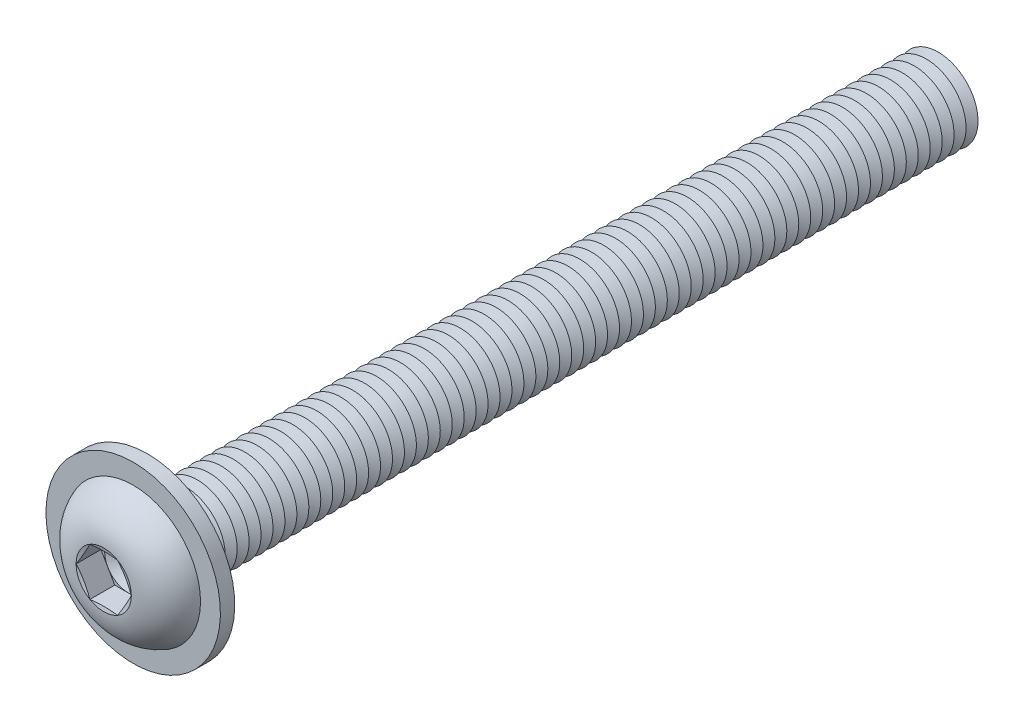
ISO-10303-21;
HEADER;
FILE_DESCRIPTION(('STEP AP214'),'2;1');
FILE_NAME('part.step','',(''),(''),'','','');
FILE_SCHEMA(('AUTOMOTIVE_DESIGN { 1 0 10303 214 1 1 1 1 }'));
ENDSEC;
DATA;
#1=APPLICATION_CONTEXT('core data for automotive mechanical design processes');
#2=APPLICATION_PROTOCOL_DEFINITION('international standard','automotive_design',2000,#1);
#3=PRODUCT_CONTEXT('',#1,'mechanical');
#4=PRODUCT('Part','Part','',(#3));
#5=PRODUCT_RELATED_PRODUCT_CATEGORY('part','',(#4));
#6=PRODUCT_DEFINITION_FORMATION('','',#4);
#7=PRODUCT_DEFINITION_CONTEXT('part definition',#1,'design');
#8=PRODUCT_DEFINITION('design','',#6,#7);
#9=PRODUCT_DEFINITION_SHAPE('','',#8);
#10=(LENGTH_UNIT() NAMED_UNIT(*) SI_UNIT(.MILLI.,.METRE.));
#11=(NAMED_UNIT(*) PLANE_ANGLE_UNIT() SI_UNIT($,.RADIAN.));
#12=(NAMED_UNIT(*) SI_UNIT($,.STERADIAN.) SOLID_ANGLE_UNIT());
#13=UNCERTAINTY_MEASURE_WITH_UNIT(LENGTH_MEASURE(1.E-05),#10,'distance_accuracy_value','');
#14=(GEOMETRIC_REPRESENTATION_CONTEXT(3) GLOBAL_UNCERTAINTY_ASSIGNED_CONTEXT((#13)) GLOBAL_UNIT_ASSIGNED_CONTEXT((#10,
#11,#12)) REPRESENTATION_CONTEXT('',''));
#15=CARTESIAN_POINT('',(0.,0.,0.));
#16=DIRECTION('',(0.,0.,1.));
#17=DIRECTION('',(1.,0.,0.));
#18=AXIS2_PLACEMENT_3D('',#15,#16,#17);
#19=CARTESIAN_POINT('',(0.,0.,-94.75));
#20=DIRECTION('',(0.,0.,1.));
#21=DIRECTION('',(0.,-1.,0.));
#22=AXIS2_PLACEMENT_3D('',#19,#20,#21);
#23=CONICAL_SURFACE('',#22,4.99999999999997,1.0471975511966);
#24=CARTESIAN_POINT('',(0.,0.,-95.5));
#25=DIRECTION('',(0.,0.,1.));
#26=DIRECTION('',(0.,-1.,0.));
#27=AXIS2_PLACEMENT_3D('',#24,#25,#26);
#28=CIRCLE('',#27,3.70096189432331);
#29=CARTESIAN_POINT('',(0.,-3.70096189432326,-95.5));
#30=VERTEX_POINT('',#29);
#31=EDGE_CURVE('E380',#30,#30,#28,.T.);
#32=ORIENTED_EDGE('',*,*,#31,.T.);
#33=EDGE_LOOP('',(#32));
#34=FACE_BOUND('',#33,.T.);
#35=CARTESIAN_POINT('',(0.,0.,-94.75));
#36=DIRECTION('',(0.,0.,1.));
#37=DIRECTION('',(0.,-1.,0.));
#38=AXIS2_PLACEMENT_3D('',#35,#36,#37);
#39=CIRCLE('',#38,4.99999999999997);
#40=CARTESIAN_POINT('',(0.,-4.99999999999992,-94.75));
#41=VERTEX_POINT('',#40);
#42=EDGE_CURVE('E383',#41,#41,#39,.T.);
#43=ORIENTED_EDGE('',*,*,#42,.F.);
#44=EDGE_LOOP('',(#43));
#45=FACE_BOUND('',#44,.T.);
#46=ADVANCED_FACE('F39',(#34,#45),#23,.T.);
#47=CARTESIAN_POINT('',(0.,0.,-95.5));
#48=DIRECTION('',(0.,0.,-1.));
#49=DIRECTION('',(0.,1.,0.));
#50=AXIS2_PLACEMENT_3D('',#47,#48,#49);
#51=CONICAL_SURFACE('',#50,3.70096189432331,1.0471975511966);
#52=CARTESIAN_POINT('',(0.,0.,-96.25));
#53=DIRECTION('',(0.,0.,1.));
#54=DIRECTION('',(0.,-1.,0.));
#55=AXIS2_PLACEMENT_3D('',#52,#53,#54);
#56=CIRCLE('',#55,4.99999999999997);
#57=CARTESIAN_POINT('',(0.,-4.99999999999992,-96.25));
#58=VERTEX_POINT('',#57);
#59=EDGE_CURVE('E382',#58,#58,#56,.T.);
#60=ORIENTED_EDGE('',*,*,#59,.T.);
#61=EDGE_LOOP('',(#60));
#62=FACE_BOUND('',#61,.T.);
#63=ORIENTED_EDGE('',*,*,#31,.F.);
#64=EDGE_LOOP('',(#63));
#65=FACE_BOUND('',#64,.T.);
#66=ADVANCED_FACE('F422',(#62,#65),#51,.T.);
#67=CARTESIAN_POINT('',(0.,4.99999999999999,-100.));
#68=DIRECTION('',(0.,0.,-1.));
#69=DIRECTION('',(0.,1.,0.));
#70=AXIS2_PLACEMENT_3D('',#67,#68,#69);
#71=PLANE('',#70);
#72=CARTESIAN_POINT('',(0.,0.,-100.));
#73=DIRECTION('',(0.,0.,1.));
#74=DIRECTION('',(0.,-1.,0.));
#75=AXIS2_PLACEMENT_3D('',#72,#73,#74);
#76=CIRCLE('',#75,3.70096189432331);
#77=CARTESIAN_POINT('',(0.,-3.70096189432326,-100.));
#78=VERTEX_POINT('',#77);
#79=EDGE_CURVE('E322',#78,#78,#76,.T.);
#80=ORIENTED_EDGE('',*,*,#79,.F.);
#81=EDGE_LOOP('',(#80));
#82=FACE_BOUND('',#81,.T.);
#83=ADVANCED_FACE('F420',(#82),#71,.T.);
#84=CARTESIAN_POINT('',(0.,0.,-99.25));
#85=DIRECTION('',(0.,0.,1.));
#86=DIRECTION('',(0.,-1.,0.));
#87=AXIS2_PLACEMENT_3D('',#84,#85,#86);
#88=CONICAL_SURFACE('',#87,4.99999999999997,1.0471975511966);
#89=ORIENTED_EDGE('',*,*,#79,.T.);
#90=EDGE_LOOP('',(#89));
#91=FACE_BOUND('',#90,.T.);
#92=CARTESIAN_POINT('',(0.,0.,-99.25));
#93=DIRECTION('',(0.,0.,1.));
#94=DIRECTION('',(0.,-1.,0.));
#95=AXIS2_PLACEMENT_3D('',#92,#93,#94);
#96=CIRCLE('',#95,4.99999999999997);
#97=CARTESIAN_POINT('',(0.,-4.99999999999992,-99.25));
#98=VERTEX_POINT('',#97);
#99=EDGE_CURVE('E408',#98,#98,#96,.T.);
#100=ORIENTED_EDGE('',*,*,#99,.F.);
#101=EDGE_LOOP('',(#100));
#102=FACE_BOUND('',#101,.T.);
#103=ADVANCED_FACE('F417',(#91,#102),#88,.T.);
#104=CARTESIAN_POINT('',(0.,0.,-98.5));
#105=DIRECTION('',(0.,0.,-1.));
#106=DIRECTION('',(0.,1.,0.));
#107=AXIS2_PLACEMENT_3D('',#104,#105,#106);
#108=CONICAL_SURFACE('',#107,3.70096189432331,1.0471975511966);
#109=ORIENTED_EDGE('',*,*,#99,.T.);
#110=EDGE_LOOP('',(#109));
#111=FACE_BOUND('',#110,.T.);
#112=CARTESIAN_POINT('',(0.,0.,-98.5));
#113=DIRECTION('',(0.,0.,1.));
#114=DIRECTION('',(0.,-1.,0.));
#115=AXIS2_PLACEMENT_3D('',#112,#113,#114);
#116=CIRCLE('',#115,3.70096189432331);
#117=CARTESIAN_POINT('',(0.,-3.70096189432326,-98.5));
#118=VERTEX_POINT('',#117);
#119=EDGE_CURVE('E404',#118,#118,#116,.T.);
#120=ORIENTED_EDGE('',*,*,#119,.F.);
#121=EDGE_LOOP('',(#120));
#122=FACE_BOUND('',#121,.T.);
#123=ADVANCED_FACE('F427',(#111,#122),#108,.T.);
#124=CARTESIAN_POINT('',(0.,0.,-97.75));
#125=DIRECTION('',(0.,0.,1.));
#126=DIRECTION('',(0.,-1.,0.));
#127=AXIS2_PLACEMENT_3D('',#124,#125,#126);
#128=CONICAL_SURFACE('',#127,4.99999999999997,1.0471975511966);
#129=ORIENTED_EDGE('',*,*,#119,.T.);
#130=EDGE_LOOP('',(#129));
#131=FACE_BOUND('',#130,.T.);
#132=CARTESIAN_POINT('',(0.,0.,-97.75));
#133=DIRECTION('',(0.,0.,1.));
#134=DIRECTION('',(0.,-1.,0.));
#135=AXIS2_PLACEMENT_3D('',#132,#133,#134);
#136=CIRCLE('',#135,4.99999999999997);
#137=CARTESIAN_POINT('',(0.,-4.99999999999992,-97.75));
#138=VERTEX_POINT('',#137);
#139=EDGE_CURVE('E400',#138,#138,#136,.T.);
#140=ORIENTED_EDGE('',*,*,#139,.F.);
#141=EDGE_LOOP('',(#140));
#142=FACE_BOUND('',#141,.T.);
#143=ADVANCED_FACE('F442',(#131,#142),#128,.T.);
#144=CARTESIAN_POINT('',(0.,0.,-97.));
#145=DIRECTION('',(0.,0.,-1.));
#146=DIRECTION('',(0.,1.,0.));
#147=AXIS2_PLACEMENT_3D('',#144,#145,#146);
#148=CONICAL_SURFACE('',#147,3.70096189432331,1.0471975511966);
#149=ORIENTED_EDGE('',*,*,#139,.T.);
#150=EDGE_LOOP('',(#149));
#151=FACE_BOUND('',#150,.T.);
#152=CARTESIAN_POINT('',(0.,0.,-97.));
#153=DIRECTION('',(0.,0.,1.));
#154=DIRECTION('',(0.,-1.,0.));
#155=AXIS2_PLACEMENT_3D('',#152,#153,#154);
#156=CIRCLE('',#155,3.70096189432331);
#157=CARTESIAN_POINT('',(0.,-3.70096189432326,-97.));
#158=VERTEX_POINT('',#157);
#159=EDGE_CURVE('E389',#158,#158,#156,.T.);
#160=ORIENTED_EDGE('',*,*,#159,.F.);
#161=EDGE_LOOP('',(#160));
#162=FACE_BOUND('',#161,.T.);
#163=ADVANCED_FACE('F438',(#151,#162),#148,.T.);
#164=CARTESIAN_POINT('',(0.,0.,-96.25));
#165=DIRECTION('',(0.,0.,1.));
#166=DIRECTION('',(0.,-1.,0.));
#167=AXIS2_PLACEMENT_3D('',#164,#165,#166);
#168=CONICAL_SURFACE('',#167,4.99999999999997,1.0471975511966);
#169=ORIENTED_EDGE('',*,*,#159,.T.);
#170=EDGE_LOOP('',(#169));
#171=FACE_BOUND('',#170,.T.);
#172=ORIENTED_EDGE('',*,*,#59,.F.);
#173=EDGE_LOOP('',(#172));
#174=FACE_BOUND('',#173,.T.);
#175=ADVANCED_FACE('F441',(#171,#174),#168,.T.);
#176=CARTESIAN_POINT('',(0.,0.,-93.25));
#177=DIRECTION('',(0.,0.,1.));
#178=DIRECTION('',(0.,-1.,0.));
#179=AXIS2_PLACEMENT_3D('',#176,#177,#178);
#180=CONICAL_SURFACE('',#179,4.99999999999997,1.0471975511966);
#181=CARTESIAN_POINT('',(0.,0.,-94.));
#182=DIRECTION('',(0.,0.,1.));
#183=DIRECTION('',(0.,-1.,0.));
#184=AXIS2_PLACEMENT_3D('',#181,#182,#183);
#185=CIRCLE('',#184,3.70096189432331);
#186=CARTESIAN_POINT('',(0.,-3.70096189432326,-94.));
#187=VERTEX_POINT('',#186);
#188=EDGE_CURVE('E393',#187,#187,#185,.T.);
#189=ORIENTED_EDGE('',*,*,#188,.T.);
#190=EDGE_LOOP('',(#189));
#191=FACE_BOUND('',#190,.T.);
#192=CARTESIAN_POINT('',(0.,0.,-93.25));
#193=DIRECTION('',(0.,0.,1.));
#194=DIRECTION('',(0.,-1.,0.));
#195=AXIS2_PLACEMENT_3D('',#192,#193,#194);
#196=CIRCLE('',#195,4.99999999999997);
#197=CARTESIAN_POINT('',(0.,-4.99999999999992,-93.25));
#198=VERTEX_POINT('',#197);
#199=EDGE_CURVE('E2229',#198,#198,#196,.T.);
#200=ORIENTED_EDGE('',*,*,#199,.F.);
#201=EDGE_LOOP('',(#200));
#202=FACE_BOUND('',#201,.T.);
#203=ADVANCED_FACE('F446',(#191,#202),#180,.T.);
#204=CARTESIAN_POINT('',(0.,0.,-94.));
#205=DIRECTION('',(0.,0.,-1.));
#206=DIRECTION('',(0.,1.,0.));
#207=AXIS2_PLACEMENT_3D('',#204,#205,#206);
#208=CONICAL_SURFACE('',#207,3.70096189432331,1.0471975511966);
#209=ORIENTED_EDGE('',*,*,#42,.T.);
#210=EDGE_LOOP('',(#209));
#211=FACE_BOUND('',#210,.T.);
#212=ORIENTED_EDGE('',*,*,#188,.F.);
#213=EDGE_LOOP('',(#212));
#214=FACE_BOUND('',#213,.T.);
#215=ADVANCED_FACE('F477',(#211,#214),#208,.T.);
#216=CARTESIAN_POINT('',(0.,0.,-91.75));
#217=DIRECTION('',(0.,0.,1.));
#218=DIRECTION('',(0.,-1.,0.));
#219=AXIS2_PLACEMENT_3D('',#216,#217,#218);
#220=CONICAL_SURFACE('',#219,4.99999999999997,1.0471975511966);
#221=CARTESIAN_POINT('',(0.,0.,-92.5));
#222=DIRECTION('',(0.,0.,1.));
#223=DIRECTION('',(0.,-1.,0.));
#224=AXIS2_PLACEMENT_3D('',#221,#222,#223);
#225=CIRCLE('',#224,3.70096189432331);
#226=CARTESIAN_POINT('',(0.,-3.70096189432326,-92.5));
#227=VERTEX_POINT('',#226);
#228=EDGE_CURVE('E2232',#227,#227,#225,.T.);
#229=ORIENTED_EDGE('',*,*,#228,.T.);
#230=EDGE_LOOP('',(#229));
#231=FACE_BOUND('',#230,.T.);
#232=CARTESIAN_POINT('',(0.,0.,-91.75));
#233=DIRECTION('',(0.,0.,1.));
#234=DIRECTION('',(0.,-1.,0.));
#235=AXIS2_PLACEMENT_3D('',#232,#233,#234);
#236=CIRCLE('',#235,4.99999999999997);
#237=CARTESIAN_POINT('',(0.,-4.99999999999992,-91.75));
#238=VERTEX_POINT('',#237);
#239=EDGE_CURVE('E2234',#238,#238,#236,.T.);
#240=ORIENTED_EDGE('',*,*,#239,.F.);
#241=EDGE_LOOP('',(#240));
#242=FACE_BOUND('',#241,.T.);
#243=ADVANCED_FACE('F483',(#231,#242),#220,.T.);
#244=CARTESIAN_POINT('',(0.,0.,-92.5));
#245=DIRECTION('',(0.,0.,-1.));
#246=DIRECTION('',(0.,1.,0.));
#247=AXIS2_PLACEMENT_3D('',#244,#245,#246);
#248=CONICAL_SURFACE('',#247,3.70096189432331,1.0471975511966);
#249=ORIENTED_EDGE('',*,*,#199,.T.);
#250=EDGE_LOOP('',(#249));
#251=FACE_BOUND('',#250,.T.);
#252=ORIENTED_EDGE('',*,*,#228,.F.);
#253=EDGE_LOOP('',(#252));
#254=FACE_BOUND('',#253,.T.);
#255=ADVANCED_FACE('F490',(#251,#254),#248,.T.);
#256=CARTESIAN_POINT('',(0.,0.,-90.25));
#257=DIRECTION('',(0.,0.,1.));
#258=DIRECTION('',(0.,-1.,0.));
#259=AXIS2_PLACEMENT_3D('',#256,#257,#258);
#260=CONICAL_SURFACE('',#259,4.99999999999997,1.0471975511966);
#261=CARTESIAN_POINT('',(0.,0.,-91.));
#262=DIRECTION('',(0.,0.,1.));
#263=DIRECTION('',(0.,-1.,0.));
#264=AXIS2_PLACEMENT_3D('',#261,#262,#263);
#265=CIRCLE('',#264,3.70096189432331);
#266=CARTESIAN_POINT('',(0.,-3.70096189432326,-91.));
#267=VERTEX_POINT('',#266);
#268=EDGE_CURVE('E2237',#267,#267,#265,.T.);
#269=ORIENTED_EDGE('',*,*,#268,.T.);
#270=EDGE_LOOP('',(#269));
#271=FACE_BOUND('',#270,.T.);
#272=CARTESIAN_POINT('',(0.,0.,-90.25));
#273=DIRECTION('',(0.,0.,1.));
#274=DIRECTION('',(0.,-1.,0.));
#275=AXIS2_PLACEMENT_3D('',#272,#273,#274);
#276=CIRCLE('',#275,4.99999999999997);
#277=CARTESIAN_POINT('',(0.,-4.99999999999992,-90.25));
#278=VERTEX_POINT('',#277);
#279=EDGE_CURVE('E377',#278,#278,#276,.T.);
#280=ORIENTED_EDGE('',*,*,#279,.F.);
#281=EDGE_LOOP('',(#280));
#282=FACE_BOUND('',#281,.T.);
#283=ADVANCED_FACE('F497',(#271,#282),#260,.T.);
#284=CARTESIAN_POINT('',(0.,0.,-91.));
#285=DIRECTION('',(0.,0.,-1.));
#286=DIRECTION('',(0.,1.,0.));
#287=AXIS2_PLACEMENT_3D('',#284,#285,#286);
#288=CONICAL_SURFACE('',#287,3.70096189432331,1.0471975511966);
#289=ORIENTED_EDGE('',*,*,#239,.T.);
#290=EDGE_LOOP('',(#289));
#291=FACE_BOUND('',#290,.T.);
#292=ORIENTED_EDGE('',*,*,#268,.F.);
#293=EDGE_LOOP('',(#292));
#294=FACE_BOUND('',#293,.T.);
#295=ADVANCED_FACE('F504',(#291,#294),#288,.T.);
#296=CARTESIAN_POINT('',(0.,0.,-88.75));
#297=DIRECTION('',(0.,0.,1.));
#298=DIRECTION('',(0.,-1.,0.));
#299=AXIS2_PLACEMENT_3D('',#296,#297,#298);
#300=CONICAL_SURFACE('',#299,4.99999999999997,1.0471975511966);
#301=CARTESIAN_POINT('',(0.,0.,-89.5));
#302=DIRECTION('',(0.,0.,1.));
#303=DIRECTION('',(0.,-1.,0.));
#304=AXIS2_PLACEMENT_3D('',#301,#302,#303);
#305=CIRCLE('',#304,3.70096189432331);
#306=CARTESIAN_POINT('',(0.,-3.70096189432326,-89.5));
#307=VERTEX_POINT('',#306);
#308=EDGE_CURVE('E374',#307,#307,#305,.T.);
#309=ORIENTED_EDGE('',*,*,#308,.T.);
#310=EDGE_LOOP('',(#309));
#311=FACE_BOUND('',#310,.T.);
#312=CARTESIAN_POINT('',(0.,0.,-88.75));
#313=DIRECTION('',(0.,0.,1.));
#314=DIRECTION('',(0.,-1.,0.));
#315=AXIS2_PLACEMENT_3D('',#312,#313,#314);
#316=CIRCLE('',#315,4.99999999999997);
#317=CARTESIAN_POINT('',(0.,-4.99999999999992,-88.75));
#318=VERTEX_POINT('',#317);
#319=EDGE_CURVE('E378',#318,#318,#316,.T.);
#320=ORIENTED_EDGE('',*,*,#319,.F.);
#321=EDGE_LOOP('',(#320));
#322=FACE_BOUND('',#321,.T.);
#323=ADVANCED_FACE('F511',(#311,#322),#300,.T.);
#324=CARTESIAN_POINT('',(0.,0.,-89.5));
#325=DIRECTION('',(0.,0.,-1.));
#326=DIRECTION('',(0.,1.,0.));
#327=AXIS2_PLACEMENT_3D('',#324,#325,#326);
#328=CONICAL_SURFACE('',#327,3.70096189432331,1.0471975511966);
#329=ORIENTED_EDGE('',*,*,#279,.T.);
#330=EDGE_LOOP('',(#329));
#331=FACE_BOUND('',#330,.T.);
#332=ORIENTED_EDGE('',*,*,#308,.F.);
#333=EDGE_LOOP('',(#332));
#334=FACE_BOUND('',#333,.T.);
#335=ADVANCED_FACE('F518',(#331,#334),#328,.T.);
#336=CARTESIAN_POINT('',(0.,0.,-87.25));
#337=DIRECTION('',(0.,0.,1.));
#338=DIRECTION('',(0.,-1.,0.));
#339=AXIS2_PLACEMENT_3D('',#336,#337,#338);
#340=CONICAL_SURFACE('',#339,4.99999999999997,1.0471975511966);
#341=CARTESIAN_POINT('',(0.,0.,-88.));
#342=DIRECTION('',(0.,0.,1.));
#343=DIRECTION('',(0.,-1.,0.));
#344=AXIS2_PLACEMENT_3D('',#341,#342,#343);
#345=CIRCLE('',#344,3.70096189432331);
#346=CARTESIAN_POINT('',(0.,-3.70096189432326,-88.));
#347=VERTEX_POINT('',#346);
#348=EDGE_CURVE('E2554',#347,#347,#345,.T.);
#349=ORIENTED_EDGE('',*,*,#348,.T.);
#350=EDGE_LOOP('',(#349));
#351=FACE_BOUND('',#350,.T.);
#352=CARTESIAN_POINT('',(0.,0.,-87.25));
#353=DIRECTION('',(0.,0.,1.));
#354=DIRECTION('',(0.,-1.,0.));
#355=AXIS2_PLACEMENT_3D('',#352,#353,#354);
#356=CIRCLE('',#355,4.99999999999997);
#357=CARTESIAN_POINT('',(0.,-4.99999999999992,-87.25));
#358=VERTEX_POINT('',#357);
#359=EDGE_CURVE('E2550',#358,#358,#356,.T.);
#360=ORIENTED_EDGE('',*,*,#359,.F.);
#361=EDGE_LOOP('',(#360));
#362=FACE_BOUND('',#361,.T.);
#363=ADVANCED_FACE('F525',(#351,#362),#340,.T.);
#364=CARTESIAN_POINT('',(0.,0.,-88.));
#365=DIRECTION('',(0.,0.,-1.));
#366=DIRECTION('',(0.,1.,0.));
#367=AXIS2_PLACEMENT_3D('',#364,#365,#366);
#368=CONICAL_SURFACE('',#367,3.70096189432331,1.0471975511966);
#369=ORIENTED_EDGE('',*,*,#319,.T.);
#370=EDGE_LOOP('',(#369));
#371=FACE_BOUND('',#370,.T.);
#372=ORIENTED_EDGE('',*,*,#348,.F.);
#373=EDGE_LOOP('',(#372));
#374=FACE_BOUND('',#373,.T.);
#375=ADVANCED_FACE('F532',(#371,#374),#368,.T.);
#376=CARTESIAN_POINT('',(0.,0.,-85.75));
#377=DIRECTION('',(0.,0.,1.));
#378=DIRECTION('',(0.,-1.,0.));
#379=AXIS2_PLACEMENT_3D('',#376,#377,#378);
#380=CONICAL_SURFACE('',#379,4.99999999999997,1.0471975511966);
#381=CARTESIAN_POINT('',(0.,0.,-86.5));
#382=DIRECTION('',(0.,0.,1.));
#383=DIRECTION('',(0.,-1.,0.));
#384=AXIS2_PLACEMENT_3D('',#381,#382,#383);
#385=CIRCLE('',#384,3.70096189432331);
#386=CARTESIAN_POINT('',(0.,-3.70096189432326,-86.5));
#387=VERTEX_POINT('',#386);
#388=EDGE_CURVE('E326',#387,#387,#385,.T.);
#389=ORIENTED_EDGE('',*,*,#388,.T.);
#390=EDGE_LOOP('',(#389));
#391=FACE_BOUND('',#390,.T.);
#392=CARTESIAN_POINT('',(0.,0.,-85.75));
#393=DIRECTION('',(0.,0.,1.));
#394=DIRECTION('',(0.,-1.,0.));
#395=AXIS2_PLACEMENT_3D('',#392,#393,#394);
#396=CIRCLE('',#395,4.99999999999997);
#397=CARTESIAN_POINT('',(0.,-4.99999999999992,-85.75));
#398=VERTEX_POINT('',#397);
#399=EDGE_CURVE('E2544',#398,#398,#396,.T.);
#400=ORIENTED_EDGE('',*,*,#399,.F.);
#401=EDGE_LOOP('',(#400));
#402=FACE_BOUND('',#401,.T.);
#403=ADVANCED_FACE('F539',(#391,#402),#380,.T.);
#404=CARTESIAN_POINT('',(0.,0.,-86.5));
#405=DIRECTION('',(0.,0.,-1.));
#406=DIRECTION('',(0.,1.,0.));
#407=AXIS2_PLACEMENT_3D('',#404,#405,#406);
#408=CONICAL_SURFACE('',#407,3.70096189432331,1.0471975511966);
#409=ORIENTED_EDGE('',*,*,#359,.T.);
#410=EDGE_LOOP('',(#409));
#411=FACE_BOUND('',#410,.T.);
#412=ORIENTED_EDGE('',*,*,#388,.F.);
#413=EDGE_LOOP('',(#412));
#414=FACE_BOUND('',#413,.T.);
#415=ADVANCED_FACE('F546',(#411,#414),#408,.T.);
#416=CARTESIAN_POINT('',(0.,0.,-84.25));
#417=DIRECTION('',(0.,0.,1.));
#418=DIRECTION('',(0.,-1.,0.));
#419=AXIS2_PLACEMENT_3D('',#416,#417,#418);
#420=CONICAL_SURFACE('',#419,4.99999999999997,1.0471975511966);
#421=CARTESIAN_POINT('',(0.,0.,-85.));
#422=DIRECTION('',(0.,0.,1.));
#423=DIRECTION('',(0.,-1.,0.));
#424=AXIS2_PLACEMENT_3D('',#421,#422,#423);
#425=CIRCLE('',#424,3.70096189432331);
#426=CARTESIAN_POINT('',(0.,-3.70096189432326,-85.));
#427=VERTEX_POINT('',#426);
#428=EDGE_CURVE('E2540',#427,#427,#425,.T.);
#429=ORIENTED_EDGE('',*,*,#428,.T.);
#430=EDGE_LOOP('',(#429));
#431=FACE_BOUND('',#430,.T.);
#432=CARTESIAN_POINT('',(0.,0.,-84.25));
#433=DIRECTION('',(0.,0.,1.));
#434=DIRECTION('',(0.,-1.,0.));
#435=AXIS2_PLACEMENT_3D('',#432,#433,#434);
#436=CIRCLE('',#435,4.99999999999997);
#437=CARTESIAN_POINT('',(0.,-4.99999999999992,-84.25));
#438=VERTEX_POINT('',#437);
#439=EDGE_CURVE('E2537',#438,#438,#436,.T.);
#440=ORIENTED_EDGE('',*,*,#439,.F.);
#441=EDGE_LOOP('',(#440));
#442=FACE_BOUND('',#441,.T.);
#443=ADVANCED_FACE('F553',(#431,#442),#420,.T.);
#444=CARTESIAN_POINT('',(0.,0.,-85.));
#445=DIRECTION('',(0.,0.,-1.));
#446=DIRECTION('',(0.,1.,0.));
#447=AXIS2_PLACEMENT_3D('',#444,#445,#446);
#448=CONICAL_SURFACE('',#447,3.70096189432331,1.0471975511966);
#449=ORIENTED_EDGE('',*,*,#399,.T.);
#450=EDGE_LOOP('',(#449));
#451=FACE_BOUND('',#450,.T.);
#452=ORIENTED_EDGE('',*,*,#428,.F.);
#453=EDGE_LOOP('',(#452));
#454=FACE_BOUND('',#453,.T.);
#455=ADVANCED_FACE('F560',(#451,#454),#448,.T.);
#456=CARTESIAN_POINT('',(0.,0.,-82.75));
#457=DIRECTION('',(0.,0.,1.));
#458=DIRECTION('',(0.,-1.,0.));
#459=AXIS2_PLACEMENT_3D('',#456,#457,#458);
#460=CONICAL_SURFACE('',#459,4.99999999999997,1.0471975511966);
#461=CARTESIAN_POINT('',(0.,0.,-83.5));
#462=DIRECTION('',(0.,0.,1.));
#463=DIRECTION('',(0.,-1.,0.));
#464=AXIS2_PLACEMENT_3D('',#461,#462,#463);
#465=CIRCLE('',#464,3.70096189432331);
#466=CARTESIAN_POINT('',(0.,-3.70096189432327,-83.5));
#467=VERTEX_POINT('',#466);
#468=EDGE_CURVE('E371',#467,#467,#465,.T.);
#469=ORIENTED_EDGE('',*,*,#468,.T.);
#470=EDGE_LOOP('',(#469));
#471=FACE_BOUND('',#470,.T.);
#472=CARTESIAN_POINT('',(0.,0.,-82.75));
#473=DIRECTION('',(0.,0.,1.));
#474=DIRECTION('',(0.,-1.,0.));
#475=AXIS2_PLACEMENT_3D('',#472,#473,#474);
#476=CIRCLE('',#475,4.99999999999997);
#477=CARTESIAN_POINT('',(0.,-4.99999999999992,-82.75));
#478=VERTEX_POINT('',#477);
#479=EDGE_CURVE('E368',#478,#478,#476,.T.);
#480=ORIENTED_EDGE('',*,*,#479,.F.);
#481=EDGE_LOOP('',(#480));
#482=FACE_BOUND('',#481,.T.);
#483=ADVANCED_FACE('F567',(#471,#482),#460,.T.);
#484=CARTESIAN_POINT('',(0.,0.,-83.5));
#485=DIRECTION('',(0.,0.,-1.));
#486=DIRECTION('',(0.,1.,0.));
#487=AXIS2_PLACEMENT_3D('',#484,#485,#486);
#488=CONICAL_SURFACE('',#487,3.70096189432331,1.0471975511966);
#489=ORIENTED_EDGE('',*,*,#439,.T.);
#490=EDGE_LOOP('',(#489));
#491=FACE_BOUND('',#490,.T.);
#492=ORIENTED_EDGE('',*,*,#468,.F.);
#493=EDGE_LOOP('',(#492));
#494=FACE_BOUND('',#493,.T.);
#495=ADVANCED_FACE('F574',(#491,#494),#488,.T.);
#496=CARTESIAN_POINT('',(0.,0.,-81.25));
#497=DIRECTION('',(0.,0.,1.));
#498=DIRECTION('',(0.,-1.,0.));
#499=AXIS2_PLACEMENT_3D('',#496,#497,#498);
#500=CONICAL_SURFACE('',#499,4.99999999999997,1.0471975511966);
#501=CARTESIAN_POINT('',(0.,0.,-82.));
#502=DIRECTION('',(0.,0.,1.));
#503=DIRECTION('',(0.,-1.,0.));
#504=AXIS2_PLACEMENT_3D('',#501,#502,#503);
#505=CIRCLE('',#504,3.70096189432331);
#506=CARTESIAN_POINT('',(0.,-3.70096189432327,-82.));
#507=VERTEX_POINT('',#506);
#508=EDGE_CURVE('E372',#507,#507,#505,.T.);
#509=ORIENTED_EDGE('',*,*,#508,.T.);
#510=EDGE_LOOP('',(#509));
#511=FACE_BOUND('',#510,.T.);
#512=CARTESIAN_POINT('',(0.,0.,-81.25));
#513=DIRECTION('',(0.,0.,1.));
#514=DIRECTION('',(0.,-1.,0.));
#515=AXIS2_PLACEMENT_3D('',#512,#513,#514);
#516=CIRCLE('',#515,4.99999999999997);
#517=CARTESIAN_POINT('',(0.,-4.99999999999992,-81.25));
#518=VERTEX_POINT('',#517);
#519=EDGE_CURVE('E2527',#518,#518,#516,.T.);
#520=ORIENTED_EDGE('',*,*,#519,.F.);
#521=EDGE_LOOP('',(#520));
#522=FACE_BOUND('',#521,.T.);
#523=ADVANCED_FACE('F581',(#511,#522),#500,.T.);
#524=CARTESIAN_POINT('',(0.,0.,-82.));
#525=DIRECTION('',(0.,0.,-1.));
#526=DIRECTION('',(0.,1.,0.));
#527=AXIS2_PLACEMENT_3D('',#524,#525,#526);
#528=CONICAL_SURFACE('',#527,3.70096189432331,1.0471975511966);
#529=ORIENTED_EDGE('',*,*,#479,.T.);
#530=EDGE_LOOP('',(#529));
#531=FACE_BOUND('',#530,.T.);
#532=ORIENTED_EDGE('',*,*,#508,.F.);
#533=EDGE_LOOP('',(#532));
#534=FACE_BOUND('',#533,.T.);
#535=ADVANCED_FACE('F588',(#531,#534),#528,.T.);
#536=CARTESIAN_POINT('',(0.,0.,-79.75));
#537=DIRECTION('',(0.,0.,1.));
#538=DIRECTION('',(0.,-1.,0.));
#539=AXIS2_PLACEMENT_3D('',#536,#537,#538);
#540=CONICAL_SURFACE('',#539,4.99999999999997,1.0471975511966);
#541=CARTESIAN_POINT('',(0.,0.,-80.5));
#542=DIRECTION('',(0.,0.,1.));
#543=DIRECTION('',(0.,-1.,0.));
#544=AXIS2_PLACEMENT_3D('',#541,#542,#543);
#545=CIRCLE('',#544,3.70096189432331);
#546=CARTESIAN_POINT('',(0.,-3.70096189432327,-80.5));
#547=VERTEX_POINT('',#546);
#548=EDGE_CURVE('E2523',#547,#547,#545,.T.);
#549=ORIENTED_EDGE('',*,*,#548,.T.);
#550=EDGE_LOOP('',(#549));
#551=FACE_BOUND('',#550,.T.);
#552=CARTESIAN_POINT('',(0.,0.,-79.75));
#553=DIRECTION('',(0.,0.,1.));
#554=DIRECTION('',(0.,-1.,0.));
#555=AXIS2_PLACEMENT_3D('',#552,#553,#554);
#556=CIRCLE('',#555,4.99999999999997);
#557=CARTESIAN_POINT('',(0.,-4.99999999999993,-79.75));
#558=VERTEX_POINT('',#557);
#559=EDGE_CURVE('E2520',#558,#558,#556,.T.);
#560=ORIENTED_EDGE('',*,*,#559,.F.);
#561=EDGE_LOOP('',(#560));
#562=FACE_BOUND('',#561,.T.);
#563=ADVANCED_FACE('F595',(#551,#562),#540,.T.);
#564=CARTESIAN_POINT('',(0.,0.,-80.5));
#565=DIRECTION('',(0.,0.,-1.));
#566=DIRECTION('',(0.,1.,0.));
#567=AXIS2_PLACEMENT_3D('',#564,#565,#566);
#568=CONICAL_SURFACE('',#567,3.70096189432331,1.0471975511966);
#569=ORIENTED_EDGE('',*,*,#519,.T.);
#570=EDGE_LOOP('',(#569));
#571=FACE_BOUND('',#570,.T.);
#572=ORIENTED_EDGE('',*,*,#548,.F.);
#573=EDGE_LOOP('',(#572));
#574=FACE_BOUND('',#573,.T.);
#575=ADVANCED_FACE('F602',(#571,#574),#568,.T.);
#576=CARTESIAN_POINT('',(0.,0.,-78.25));
#577=DIRECTION('',(0.,0.,1.));
#578=DIRECTION('',(0.,-1.,0.));
#579=AXIS2_PLACEMENT_3D('',#576,#577,#578);
#580=CONICAL_SURFACE('',#579,4.99999999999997,1.0471975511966);
#581=CARTESIAN_POINT('',(0.,0.,-79.));
#582=DIRECTION('',(0.,0.,1.));
#583=DIRECTION('',(0.,-1.,0.));
#584=AXIS2_PLACEMENT_3D('',#581,#582,#583);
#585=CIRCLE('',#584,3.70096189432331);
#586=CARTESIAN_POINT('',(0.,-3.70096189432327,-79.));
#587=VERTEX_POINT('',#586);
#588=EDGE_CURVE('E2185',#587,#587,#585,.T.);
#589=ORIENTED_EDGE('',*,*,#588,.T.);
#590=EDGE_LOOP('',(#589));
#591=FACE_BOUND('',#590,.T.);
#592=CARTESIAN_POINT('',(0.,0.,-78.25));
#593=DIRECTION('',(0.,0.,1.));
#594=DIRECTION('',(0.,-1.,0.));
#595=AXIS2_PLACEMENT_3D('',#592,#593,#594);
#596=CIRCLE('',#595,4.99999999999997);
#597=CARTESIAN_POINT('',(0.,-4.99999999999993,-78.25));
#598=VERTEX_POINT('',#597);
#599=EDGE_CURVE('E2183',#598,#598,#596,.T.);
#600=ORIENTED_EDGE('',*,*,#599,.F.);
#601=EDGE_LOOP('',(#600));
#602=FACE_BOUND('',#601,.T.);
#603=ADVANCED_FACE('F609',(#591,#602),#580,.T.);
#604=CARTESIAN_POINT('',(0.,0.,-79.));
#605=DIRECTION('',(0.,0.,-1.));
#606=DIRECTION('',(0.,1.,0.));
#607=AXIS2_PLACEMENT_3D('',#604,#605,#606);
#608=CONICAL_SURFACE('',#607,3.70096189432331,1.0471975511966);
#609=ORIENTED_EDGE('',*,*,#559,.T.);
#610=EDGE_LOOP('',(#609));
#611=FACE_BOUND('',#610,.T.);
#612=ORIENTED_EDGE('',*,*,#588,.F.);
#613=EDGE_LOOP('',(#612));
#614=FACE_BOUND('',#613,.T.);
#615=ADVANCED_FACE('F616',(#611,#614),#608,.T.);
#616=CARTESIAN_POINT('',(0.,0.,-76.75));
#617=DIRECTION('',(0.,0.,1.));
#618=DIRECTION('',(0.,-1.,0.));
#619=AXIS2_PLACEMENT_3D('',#616,#617,#618);
#620=CONICAL_SURFACE('',#619,4.99999999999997,1.0471975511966);
#621=CARTESIAN_POINT('',(0.,0.,-77.5));
#622=DIRECTION('',(0.,0.,1.));
#623=DIRECTION('',(0.,-1.,0.));
#624=AXIS2_PLACEMENT_3D('',#621,#622,#623);
#625=CIRCLE('',#624,3.70096189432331);
#626=CARTESIAN_POINT('',(0.,-3.70096189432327,-77.5));
#627=VERTEX_POINT('',#626);
#628=EDGE_CURVE('E2158',#627,#627,#625,.T.);
#629=ORIENTED_EDGE('',*,*,#628,.T.);
#630=EDGE_LOOP('',(#629));
#631=FACE_BOUND('',#630,.T.);
#632=CARTESIAN_POINT('',(0.,0.,-76.75));
#633=DIRECTION('',(0.,0.,1.));
#634=DIRECTION('',(0.,-1.,0.));
#635=AXIS2_PLACEMENT_3D('',#632,#633,#634);
#636=CIRCLE('',#635,4.99999999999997);
#637=CARTESIAN_POINT('',(0.,-4.99999999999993,-76.75));
#638=VERTEX_POINT('',#637);
#639=EDGE_CURVE('E2156',#638,#638,#636,.T.);
#640=ORIENTED_EDGE('',*,*,#639,.F.);
#641=EDGE_LOOP('',(#640));
#642=FACE_BOUND('',#641,.T.);
#643=ADVANCED_FACE('F623',(#631,#642),#620,.T.);
#644=CARTESIAN_POINT('',(0.,0.,-77.5));
#645=DIRECTION('',(0.,0.,-1.));
#646=DIRECTION('',(0.,1.,0.));
#647=AXIS2_PLACEMENT_3D('',#644,#645,#646);
#648=CONICAL_SURFACE('',#647,3.70096189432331,1.0471975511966);
#649=ORIENTED_EDGE('',*,*,#599,.T.);
#650=EDGE_LOOP('',(#649));
#651=FACE_BOUND('',#650,.T.);
#652=ORIENTED_EDGE('',*,*,#628,.F.);
#653=EDGE_LOOP('',(#652));
#654=FACE_BOUND('',#653,.T.);
#655=ADVANCED_FACE('F630',(#651,#654),#648,.T.);
#656=CARTESIAN_POINT('',(0.,0.,-75.25));
#657=DIRECTION('',(0.,0.,1.));
#658=DIRECTION('',(0.,-1.,0.));
#659=AXIS2_PLACEMENT_3D('',#656,#657,#658);
#660=CONICAL_SURFACE('',#659,4.99999999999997,1.0471975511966);
#661=CARTESIAN_POINT('',(0.,0.,-76.));
#662=DIRECTION('',(0.,0.,1.));
#663=DIRECTION('',(0.,-1.,0.));
#664=AXIS2_PLACEMENT_3D('',#661,#662,#663);
#665=CIRCLE('',#664,3.70096189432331);
#666=CARTESIAN_POINT('',(0.,-3.70096189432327,-76.));
#667=VERTEX_POINT('',#666);
#668=EDGE_CURVE('E2159',#667,#667,#665,.T.);
#669=ORIENTED_EDGE('',*,*,#668,.T.);
#670=EDGE_LOOP('',(#669));
#671=FACE_BOUND('',#670,.T.);
#672=CARTESIAN_POINT('',(0.,0.,-75.25));
#673=DIRECTION('',(0.,0.,1.));
#674=DIRECTION('',(0.,-1.,0.));
#675=AXIS2_PLACEMENT_3D('',#672,#673,#674);
#676=CIRCLE('',#675,4.99999999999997);
#677=CARTESIAN_POINT('',(0.,-4.99999999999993,-75.25));
#678=VERTEX_POINT('',#677);
#679=EDGE_CURVE('E2282',#678,#678,#676,.T.);
#680=ORIENTED_EDGE('',*,*,#679,.F.);
#681=EDGE_LOOP('',(#680));
#682=FACE_BOUND('',#681,.T.);
#683=ADVANCED_FACE('F637',(#671,#682),#660,.T.);
#684=CARTESIAN_POINT('',(0.,0.,-76.));
#685=DIRECTION('',(0.,0.,-1.));
#686=DIRECTION('',(0.,1.,0.));
#687=AXIS2_PLACEMENT_3D('',#684,#685,#686);
#688=CONICAL_SURFACE('',#687,3.70096189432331,1.0471975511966);
#689=ORIENTED_EDGE('',*,*,#639,.T.);
#690=EDGE_LOOP('',(#689));
#691=FACE_BOUND('',#690,.T.);
#692=ORIENTED_EDGE('',*,*,#668,.F.);
#693=EDGE_LOOP('',(#692));
#694=FACE_BOUND('',#693,.T.);
#695=ADVANCED_FACE('F644',(#691,#694),#688,.T.);
#696=CARTESIAN_POINT('',(0.,0.,-73.75));
#697=DIRECTION('',(0.,0.,1.));
#698=DIRECTION('',(0.,-1.,0.));
#699=AXIS2_PLACEMENT_3D('',#696,#697,#698);
#700=CONICAL_SURFACE('',#699,4.99999999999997,1.0471975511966);
#701=CARTESIAN_POINT('',(0.,0.,-74.5));
#702=DIRECTION('',(0.,0.,1.));
#703=DIRECTION('',(0.,-1.,0.));
#704=AXIS2_PLACEMENT_3D('',#701,#702,#703);
#705=CIRCLE('',#704,3.70096189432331);
#706=CARTESIAN_POINT('',(0.,-3.70096189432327,-74.5));
#707=VERTEX_POINT('',#706);
#708=EDGE_CURVE('E365',#707,#707,#705,.T.);
#709=ORIENTED_EDGE('',*,*,#708,.T.);
#710=EDGE_LOOP('',(#709));
#711=FACE_BOUND('',#710,.T.);
#712=CARTESIAN_POINT('',(0.,0.,-73.75));
#713=DIRECTION('',(0.,0.,1.));
#714=DIRECTION('',(0.,-1.,0.));
#715=AXIS2_PLACEMENT_3D('',#712,#713,#714);
#716=CIRCLE('',#715,4.99999999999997);
#717=CARTESIAN_POINT('',(0.,-4.99999999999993,-73.75));
#718=VERTEX_POINT('',#717);
#719=EDGE_CURVE('E362',#718,#718,#716,.T.);
#720=ORIENTED_EDGE('',*,*,#719,.F.);
#721=EDGE_LOOP('',(#720));
#722=FACE_BOUND('',#721,.T.);
#723=ADVANCED_FACE('F651',(#711,#722),#700,.T.);
#724=CARTESIAN_POINT('',(0.,0.,-74.5));
#725=DIRECTION('',(0.,0.,-1.));
#726=DIRECTION('',(0.,1.,0.));
#727=AXIS2_PLACEMENT_3D('',#724,#725,#726);
#728=CONICAL_SURFACE('',#727,3.70096189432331,1.0471975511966);
#729=ORIENTED_EDGE('',*,*,#679,.T.);
#730=EDGE_LOOP('',(#729));
#731=FACE_BOUND('',#730,.T.);
#732=ORIENTED_EDGE('',*,*,#708,.F.);
#733=EDGE_LOOP('',(#732));
#734=FACE_BOUND('',#733,.T.);
#735=ADVANCED_FACE('F658',(#731,#734),#728,.T.);
#736=CARTESIAN_POINT('',(0.,0.,-72.25));
#737=DIRECTION('',(0.,0.,1.));
#738=DIRECTION('',(0.,-1.,0.));
#739=AXIS2_PLACEMENT_3D('',#736,#737,#738);
#740=CONICAL_SURFACE('',#739,4.99999999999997,1.0471975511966);
#741=CARTESIAN_POINT('',(0.,0.,-73.));
#742=DIRECTION('',(0.,0.,1.));
#743=DIRECTION('',(0.,-1.,0.));
#744=AXIS2_PLACEMENT_3D('',#741,#742,#743);
#745=CIRCLE('',#744,3.70096189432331);
#746=CARTESIAN_POINT('',(0.,-3.70096189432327,-73.));
#747=VERTEX_POINT('',#746);
#748=EDGE_CURVE('E366',#747,#747,#745,.T.);
#749=ORIENTED_EDGE('',*,*,#748,.T.);
#750=EDGE_LOOP('',(#749));
#751=FACE_BOUND('',#750,.T.);
#752=CARTESIAN_POINT('',(0.,0.,-72.25));
#753=DIRECTION('',(0.,0.,1.));
#754=DIRECTION('',(0.,-1.,0.));
#755=AXIS2_PLACEMENT_3D('',#752,#753,#754);
#756=CIRCLE('',#755,4.99999999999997);
#757=CARTESIAN_POINT('',(0.,-4.99999999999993,-72.25));
#758=VERTEX_POINT('',#757);
#759=EDGE_CURVE('E2284',#758,#758,#756,.T.);
#760=ORIENTED_EDGE('',*,*,#759,.F.);
#761=EDGE_LOOP('',(#760));
#762=FACE_BOUND('',#761,.T.);
#763=ADVANCED_FACE('F665',(#751,#762),#740,.T.);
#764=CARTESIAN_POINT('',(0.,0.,-73.));
#765=DIRECTION('',(0.,0.,-1.));
#766=DIRECTION('',(0.,1.,0.));
#767=AXIS2_PLACEMENT_3D('',#764,#765,#766);
#768=CONICAL_SURFACE('',#767,3.70096189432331,1.0471975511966);
#769=ORIENTED_EDGE('',*,*,#719,.T.);
#770=EDGE_LOOP('',(#769));
#771=FACE_BOUND('',#770,.T.);
#772=ORIENTED_EDGE('',*,*,#748,.F.);
#773=EDGE_LOOP('',(#772));
#774=FACE_BOUND('',#773,.T.);
#775=ADVANCED_FACE('F672',(#771,#774),#768,.T.);
#776=CARTESIAN_POINT('',(0.,0.,-70.75));
#777=DIRECTION('',(0.,0.,1.));
#778=DIRECTION('',(0.,-1.,0.));
#779=AXIS2_PLACEMENT_3D('',#776,#777,#778);
#780=CONICAL_SURFACE('',#779,4.99999999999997,1.0471975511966);
#781=CARTESIAN_POINT('',(0.,0.,-71.5));
#782=DIRECTION('',(0.,0.,1.));
#783=DIRECTION('',(0.,-1.,0.));
#784=AXIS2_PLACEMENT_3D('',#781,#782,#783);
#785=CIRCLE('',#784,3.70096189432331);
#786=CARTESIAN_POINT('',(0.,-3.70096189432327,-71.5));
#787=VERTEX_POINT('',#786);
#788=EDGE_CURVE('E2287',#787,#787,#785,.T.);
#789=ORIENTED_EDGE('',*,*,#788,.T.);
#790=EDGE_LOOP('',(#789));
#791=FACE_BOUND('',#790,.T.);
#792=CARTESIAN_POINT('',(0.,0.,-70.75));
#793=DIRECTION('',(0.,0.,1.));
#794=DIRECTION('',(0.,-1.,0.));
#795=AXIS2_PLACEMENT_3D('',#792,#793,#794);
#796=CIRCLE('',#795,4.99999999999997);
#797=CARTESIAN_POINT('',(0.,-4.99999999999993,-70.75));
#798=VERTEX_POINT('',#797);
#799=EDGE_CURVE('E2180',#798,#798,#796,.T.);
#800=ORIENTED_EDGE('',*,*,#799,.F.);
#801=EDGE_LOOP('',(#800));
#802=FACE_BOUND('',#801,.T.);
#803=ADVANCED_FACE('F679',(#791,#802),#780,.T.);
#804=CARTESIAN_POINT('',(0.,0.,-71.5));
#805=DIRECTION('',(0.,0.,-1.));
#806=DIRECTION('',(0.,1.,0.));
#807=AXIS2_PLACEMENT_3D('',#804,#805,#806);
#808=CONICAL_SURFACE('',#807,3.70096189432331,1.0471975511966);
#809=ORIENTED_EDGE('',*,*,#759,.T.);
#810=EDGE_LOOP('',(#809));
#811=FACE_BOUND('',#810,.T.);
#812=ORIENTED_EDGE('',*,*,#788,.F.);
#813=EDGE_LOOP('',(#812));
#814=FACE_BOUND('',#813,.T.);
#815=ADVANCED_FACE('F686',(#811,#814),#808,.T.);
#816=CARTESIAN_POINT('',(0.,0.,-69.25));
#817=DIRECTION('',(0.,0.,1.));
#818=DIRECTION('',(0.,-1.,0.));
#819=AXIS2_PLACEMENT_3D('',#816,#817,#818);
#820=CONICAL_SURFACE('',#819,4.99999999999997,1.0471975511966);
#821=CARTESIAN_POINT('',(0.,0.,-70.));
#822=DIRECTION('',(0.,0.,1.));
#823=DIRECTION('',(0.,-1.,0.));
#824=AXIS2_PLACEMENT_3D('',#821,#822,#823);
#825=CIRCLE('',#824,3.70096189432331);
#826=CARTESIAN_POINT('',(0.,-3.70096189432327,-70.));
#827=VERTEX_POINT('',#826);
#828=EDGE_CURVE('E2177',#827,#827,#825,.T.);
#829=ORIENTED_EDGE('',*,*,#828,.T.);
#830=EDGE_LOOP('',(#829));
#831=FACE_BOUND('',#830,.T.);
#832=CARTESIAN_POINT('',(0.,0.,-69.25));
#833=DIRECTION('',(0.,0.,1.));
#834=DIRECTION('',(0.,-1.,0.));
#835=AXIS2_PLACEMENT_3D('',#832,#833,#834);
#836=CIRCLE('',#835,4.99999999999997);
#837=CARTESIAN_POINT('',(0.,-4.99999999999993,-69.25));
#838=VERTEX_POINT('',#837);
#839=EDGE_CURVE('E2181',#838,#838,#836,.T.);
#840=ORIENTED_EDGE('',*,*,#839,.F.);
#841=EDGE_LOOP('',(#840));
#842=FACE_BOUND('',#841,.T.);
#843=ADVANCED_FACE('F693',(#831,#842),#820,.T.);
#844=CARTESIAN_POINT('',(0.,0.,-70.));
#845=DIRECTION('',(0.,0.,-1.));
#846=DIRECTION('',(0.,1.,0.));
#847=AXIS2_PLACEMENT_3D('',#844,#845,#846);
#848=CONICAL_SURFACE('',#847,3.70096189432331,1.0471975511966);
#849=ORIENTED_EDGE('',*,*,#799,.T.);
#850=EDGE_LOOP('',(#849));
#851=FACE_BOUND('',#850,.T.);
#852=ORIENTED_EDGE('',*,*,#828,.F.);
#853=EDGE_LOOP('',(#852));
#854=FACE_BOUND('',#853,.T.);
#855=ADVANCED_FACE('F700',(#851,#854),#848,.T.);
#856=CARTESIAN_POINT('',(0.,0.,-67.75));
#857=DIRECTION('',(0.,0.,1.));
#858=DIRECTION('',(0.,-1.,0.));
#859=AXIS2_PLACEMENT_3D('',#856,#857,#858);
#860=CONICAL_SURFACE('',#859,4.99999999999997,1.0471975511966);
#861=CARTESIAN_POINT('',(0.,0.,-68.5));
#862=DIRECTION('',(0.,0.,1.));
#863=DIRECTION('',(0.,-1.,0.));
#864=AXIS2_PLACEMENT_3D('',#861,#862,#863);
#865=CIRCLE('',#864,3.70096189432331);
#866=CARTESIAN_POINT('',(0.,-3.70096189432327,-68.5));
#867=VERTEX_POINT('',#866);
#868=EDGE_CURVE('E2492',#867,#867,#865,.T.);
#869=ORIENTED_EDGE('',*,*,#868,.T.);
#870=EDGE_LOOP('',(#869));
#871=FACE_BOUND('',#870,.T.);
#872=CARTESIAN_POINT('',(0.,0.,-67.75));
#873=DIRECTION('',(0.,0.,1.));
#874=DIRECTION('',(0.,-1.,0.));
#875=AXIS2_PLACEMENT_3D('',#872,#873,#874);
#876=CIRCLE('',#875,4.99999999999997);
#877=CARTESIAN_POINT('',(0.,-4.99999999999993,-67.75));
#878=VERTEX_POINT('',#877);
#879=EDGE_CURVE('E2488',#878,#878,#876,.T.);
#880=ORIENTED_EDGE('',*,*,#879,.F.);
#881=EDGE_LOOP('',(#880));
#882=FACE_BOUND('',#881,.T.);
#883=ADVANCED_FACE('F707',(#871,#882),#860,.T.);
#884=CARTESIAN_POINT('',(0.,0.,-68.5));
#885=DIRECTION('',(0.,0.,-1.));
#886=DIRECTION('',(0.,1.,0.));
#887=AXIS2_PLACEMENT_3D('',#884,#885,#886);
#888=CONICAL_SURFACE('',#887,3.70096189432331,1.0471975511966);
#889=ORIENTED_EDGE('',*,*,#839,.T.);
#890=EDGE_LOOP('',(#889));
#891=FACE_BOUND('',#890,.T.);
#892=ORIENTED_EDGE('',*,*,#868,.F.);
#893=EDGE_LOOP('',(#892));
#894=FACE_BOUND('',#893,.T.);
#895=ADVANCED_FACE('F714',(#891,#894),#888,.T.);
#896=CARTESIAN_POINT('',(0.,0.,-66.25));
#897=DIRECTION('',(0.,0.,1.));
#898=DIRECTION('',(0.,-1.,0.));
#899=AXIS2_PLACEMENT_3D('',#896,#897,#898);
#900=CONICAL_SURFACE('',#899,4.99999999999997,1.0471975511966);
#901=CARTESIAN_POINT('',(0.,0.,-67.));
#902=DIRECTION('',(0.,0.,1.));
#903=DIRECTION('',(0.,-1.,0.));
#904=AXIS2_PLACEMENT_3D('',#901,#902,#903);
#905=CIRCLE('',#904,3.70096189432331);
#906=CARTESIAN_POINT('',(0.,-3.70096189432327,-67.));
#907=VERTEX_POINT('',#906);
#908=EDGE_CURVE('E2484',#907,#907,#905,.T.);
#909=ORIENTED_EDGE('',*,*,#908,.T.);
#910=EDGE_LOOP('',(#909));
#911=FACE_BOUND('',#910,.T.);
#912=CARTESIAN_POINT('',(0.,0.,-66.25));
#913=DIRECTION('',(0.,0.,1.));
#914=DIRECTION('',(0.,-1.,0.));
#915=AXIS2_PLACEMENT_3D('',#912,#913,#914);
#916=CIRCLE('',#915,4.99999999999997);
#917=CARTESIAN_POINT('',(0.,-4.99999999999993,-66.25));
#918=VERTEX_POINT('',#917);
#919=EDGE_CURVE('E2200',#918,#918,#916,.T.);
#920=ORIENTED_EDGE('',*,*,#919,.F.);
#921=EDGE_LOOP('',(#920));
#922=FACE_BOUND('',#921,.T.);
#923=ADVANCED_FACE('F721',(#911,#922),#900,.T.);
#924=CARTESIAN_POINT('',(0.,0.,-67.));
#925=DIRECTION('',(0.,0.,-1.));
#926=DIRECTION('',(0.,1.,0.));
#927=AXIS2_PLACEMENT_3D('',#924,#925,#926);
#928=CONICAL_SURFACE('',#927,3.70096189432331,1.0471975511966);
#929=ORIENTED_EDGE('',*,*,#879,.T.);
#930=EDGE_LOOP('',(#929));
#931=FACE_BOUND('',#930,.T.);
#932=ORIENTED_EDGE('',*,*,#908,.F.);
#933=EDGE_LOOP('',(#932));
#934=FACE_BOUND('',#933,.T.);
#935=ADVANCED_FACE('F728',(#931,#934),#928,.T.);
#936=CARTESIAN_POINT('',(0.,0.,-64.75));
#937=DIRECTION('',(0.,0.,1.));
#938=DIRECTION('',(0.,-1.,0.));
#939=AXIS2_PLACEMENT_3D('',#936,#937,#938);
#940=CONICAL_SURFACE('',#939,4.99999999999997,1.0471975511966);
#941=CARTESIAN_POINT('',(0.,0.,-65.5));
#942=DIRECTION('',(0.,0.,1.));
#943=DIRECTION('',(0.,-1.,0.));
#944=AXIS2_PLACEMENT_3D('',#941,#942,#943);
#945=CIRCLE('',#944,3.70096189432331);
#946=CARTESIAN_POINT('',(0.,-3.70096189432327,-65.5));
#947=VERTEX_POINT('',#946);
#948=EDGE_CURVE('E2197',#947,#947,#945,.T.);
#949=ORIENTED_EDGE('',*,*,#948,.T.);
#950=EDGE_LOOP('',(#949));
#951=FACE_BOUND('',#950,.T.);
#952=CARTESIAN_POINT('',(0.,0.,-64.75));
#953=DIRECTION('',(0.,0.,1.));
#954=DIRECTION('',(0.,-1.,0.));
#955=AXIS2_PLACEMENT_3D('',#952,#953,#954);
#956=CIRCLE('',#955,4.99999999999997);
#957=CARTESIAN_POINT('',(0.,-4.99999999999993,-64.75));
#958=VERTEX_POINT('',#957);
#959=EDGE_CURVE('E2153',#958,#958,#956,.T.);
#960=ORIENTED_EDGE('',*,*,#959,.F.);
#961=EDGE_LOOP('',(#960));
#962=FACE_BOUND('',#961,.T.);
#963=ADVANCED_FACE('F735',(#951,#962),#940,.T.);
#964=CARTESIAN_POINT('',(0.,0.,-65.5));
#965=DIRECTION('',(0.,0.,-1.));
#966=DIRECTION('',(0.,1.,0.));
#967=AXIS2_PLACEMENT_3D('',#964,#965,#966);
#968=CONICAL_SURFACE('',#967,3.70096189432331,1.0471975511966);
#969=ORIENTED_EDGE('',*,*,#919,.T.);
#970=EDGE_LOOP('',(#969));
#971=FACE_BOUND('',#970,.T.);
#972=ORIENTED_EDGE('',*,*,#948,.F.);
#973=EDGE_LOOP('',(#972));
#974=FACE_BOUND('',#973,.T.);
#975=ADVANCED_FACE('F742',(#971,#974),#968,.T.);
#976=CARTESIAN_POINT('',(0.,0.,-63.25));
#977=DIRECTION('',(0.,0.,1.));
#978=DIRECTION('',(0.,-1.,0.));
#979=AXIS2_PLACEMENT_3D('',#976,#977,#978);
#980=CONICAL_SURFACE('',#979,4.99999999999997,1.0471975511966);
#981=CARTESIAN_POINT('',(0.,0.,-64.));
#982=DIRECTION('',(0.,0.,1.));
#983=DIRECTION('',(0.,-1.,0.));
#984=AXIS2_PLACEMENT_3D('',#981,#982,#983);
#985=CIRCLE('',#984,3.70096189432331);
#986=CARTESIAN_POINT('',(0.,-3.70096189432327,-64.));
#987=VERTEX_POINT('',#986);
#988=EDGE_CURVE('E2150',#987,#987,#985,.T.);
#989=ORIENTED_EDGE('',*,*,#988,.T.);
#990=EDGE_LOOP('',(#989));
#991=FACE_BOUND('',#990,.T.);
#992=CARTESIAN_POINT('',(0.,0.,-63.25));
#993=DIRECTION('',(0.,0.,1.));
#994=DIRECTION('',(0.,-1.,0.));
#995=AXIS2_PLACEMENT_3D('',#992,#993,#994);
#996=CIRCLE('',#995,4.99999999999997);
#997=CARTESIAN_POINT('',(0.,-4.99999999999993,-63.25));
#998=VERTEX_POINT('',#997);
#999=EDGE_CURVE('E2154',#998,#998,#996,.T.);
#1000=ORIENTED_EDGE('',*,*,#999,.F.);
#1001=EDGE_LOOP('',(#1000));
#1002=FACE_BOUND('',#1001,.T.);
#1003=ADVANCED_FACE('F749',(#991,#1002),#980,.T.);
#1004=CARTESIAN_POINT('',(0.,0.,-64.));
#1005=DIRECTION('',(0.,0.,-1.));
#1006=DIRECTION('',(0.,1.,0.));
#1007=AXIS2_PLACEMENT_3D('',#1004,#1005,#1006);
#1008=CONICAL_SURFACE('',#1007,3.70096189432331,1.0471975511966);
#1009=ORIENTED_EDGE('',*,*,#959,.T.);
#1010=EDGE_LOOP('',(#1009));
#1011=FACE_BOUND('',#1010,.T.);
#1012=ORIENTED_EDGE('',*,*,#988,.F.);
#1013=EDGE_LOOP('',(#1012));
#1014=FACE_BOUND('',#1013,.T.);
#1015=ADVANCED_FACE('F756',(#1011,#1014),#1008,.T.);
#1016=CARTESIAN_POINT('',(0.,0.,-61.75));
#1017=DIRECTION('',(0.,0.,1.));
#1018=DIRECTION('',(0.,-1.,0.));
#1019=AXIS2_PLACEMENT_3D('',#1016,#1017,#1018);
#1020=CONICAL_SURFACE('',#1019,4.99999999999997,1.0471975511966);
#1021=CARTESIAN_POINT('',(0.,0.,-62.5));
#1022=DIRECTION('',(0.,0.,1.));
#1023=DIRECTION('',(0.,-1.,0.));
#1024=AXIS2_PLACEMENT_3D('',#1021,#1022,#1023);
#1025=CIRCLE('',#1024,3.70096189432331);
#1026=CARTESIAN_POINT('',(0.,-3.70096189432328,-62.5));
#1027=VERTEX_POINT('',#1026);
#1028=EDGE_CURVE('E2474',#1027,#1027,#1025,.T.);
#1029=ORIENTED_EDGE('',*,*,#1028,.T.);
#1030=EDGE_LOOP('',(#1029));
#1031=FACE_BOUND('',#1030,.T.);
#1032=CARTESIAN_POINT('',(0.,0.,-61.75));
#1033=DIRECTION('',(0.,0.,1.));
#1034=DIRECTION('',(0.,-1.,0.));
#1035=AXIS2_PLACEMENT_3D('',#1032,#1033,#1034);
#1036=CIRCLE('',#1035,4.99999999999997);
#1037=CARTESIAN_POINT('',(0.,-4.99999999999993,-61.75));
#1038=VERTEX_POINT('',#1037);
#1039=EDGE_CURVE('E2470',#1038,#1038,#1036,.T.);
#1040=ORIENTED_EDGE('',*,*,#1039,.F.);
#1041=EDGE_LOOP('',(#1040));
#1042=FACE_BOUND('',#1041,.T.);
#1043=ADVANCED_FACE('F763',(#1031,#1042),#1020,.T.);
#1044=CARTESIAN_POINT('',(0.,0.,-62.5));
#1045=DIRECTION('',(0.,0.,-1.));
#1046=DIRECTION('',(0.,1.,0.));
#1047=AXIS2_PLACEMENT_3D('',#1044,#1045,#1046);
#1048=CONICAL_SURFACE('',#1047,3.70096189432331,1.0471975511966);
#1049=ORIENTED_EDGE('',*,*,#999,.T.);
#1050=EDGE_LOOP('',(#1049));
#1051=FACE_BOUND('',#1050,.T.);
#1052=ORIENTED_EDGE('',*,*,#1028,.F.);
#1053=EDGE_LOOP('',(#1052));
#1054=FACE_BOUND('',#1053,.T.);
#1055=ADVANCED_FACE('F770',(#1051,#1054),#1048,.T.);
#1056=CARTESIAN_POINT('',(0.,0.,-60.25));
#1057=DIRECTION('',(0.,0.,1.));
#1058=DIRECTION('',(0.,-1.,0.));
#1059=AXIS2_PLACEMENT_3D('',#1056,#1057,#1058);
#1060=CONICAL_SURFACE('',#1059,4.99999999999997,1.0471975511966);
#1061=CARTESIAN_POINT('',(0.,0.,-61.));
#1062=DIRECTION('',(0.,0.,1.));
#1063=DIRECTION('',(0.,-1.,0.));
#1064=AXIS2_PLACEMENT_3D('',#1061,#1062,#1063);
#1065=CIRCLE('',#1064,3.70096189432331);
#1066=CARTESIAN_POINT('',(0.,-3.70096189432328,-61.));
#1067=VERTEX_POINT('',#1066);
#1068=EDGE_CURVE('E2242',#1067,#1067,#1065,.T.);
#1069=ORIENTED_EDGE('',*,*,#1068,.T.);
#1070=EDGE_LOOP('',(#1069));
#1071=FACE_BOUND('',#1070,.T.);
#1072=CARTESIAN_POINT('',(0.,0.,-60.25));
#1073=DIRECTION('',(0.,0.,1.));
#1074=DIRECTION('',(0.,-1.,0.));
#1075=AXIS2_PLACEMENT_3D('',#1072,#1073,#1074);
#1076=CIRCLE('',#1075,4.99999999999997);
#1077=CARTESIAN_POINT('',(0.,-4.99999999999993,-60.25));
#1078=VERTEX_POINT('',#1077);
#1079=EDGE_CURVE('E2239',#1078,#1078,#1076,.T.);
#1080=ORIENTED_EDGE('',*,*,#1079,.F.);
#1081=EDGE_LOOP('',(#1080));
#1082=FACE_BOUND('',#1081,.T.);
#1083=ADVANCED_FACE('F777',(#1071,#1082),#1060,.T.);
#1084=CARTESIAN_POINT('',(0.,0.,-61.));
#1085=DIRECTION('',(0.,0.,-1.));
#1086=DIRECTION('',(0.,1.,0.));
#1087=AXIS2_PLACEMENT_3D('',#1084,#1085,#1086);
#1088=CONICAL_SURFACE('',#1087,3.70096189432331,1.0471975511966);
#1089=ORIENTED_EDGE('',*,*,#1039,.T.);
#1090=EDGE_LOOP('',(#1089));
#1091=FACE_BOUND('',#1090,.T.);
#1092=ORIENTED_EDGE('',*,*,#1068,.F.);
#1093=EDGE_LOOP('',(#1092));
#1094=FACE_BOUND('',#1093,.T.);
#1095=ADVANCED_FACE('F784',(#1091,#1094),#1088,.T.);
#1096=CARTESIAN_POINT('',(0.,0.,-58.75));
#1097=DIRECTION('',(0.,0.,1.));
#1098=DIRECTION('',(0.,-1.,0.));
#1099=AXIS2_PLACEMENT_3D('',#1096,#1097,#1098);
#1100=CONICAL_SURFACE('',#1099,4.99999999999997,1.0471975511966);
#1101=CARTESIAN_POINT('',(0.,0.,-59.5));
#1102=DIRECTION('',(0.,0.,1.));
#1103=DIRECTION('',(0.,-1.,0.));
#1104=AXIS2_PLACEMENT_3D('',#1101,#1102,#1103);
#1105=CIRCLE('',#1104,3.70096189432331);
#1106=CARTESIAN_POINT('',(0.,-3.70096189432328,-59.5));
#1107=VERTEX_POINT('',#1106);
#1108=EDGE_CURVE('E2243',#1107,#1107,#1105,.T.);
#1109=ORIENTED_EDGE('',*,*,#1108,.T.);
#1110=EDGE_LOOP('',(#1109));
#1111=FACE_BOUND('',#1110,.T.);
#1112=CARTESIAN_POINT('',(0.,0.,-58.75));
#1113=DIRECTION('',(0.,0.,1.));
#1114=DIRECTION('',(0.,-1.,0.));
#1115=AXIS2_PLACEMENT_3D('',#1112,#1113,#1114);
#1116=CIRCLE('',#1115,4.99999999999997);
#1117=CARTESIAN_POINT('',(0.,-4.99999999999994,-58.75));
#1118=VERTEX_POINT('',#1117);
#1119=EDGE_CURVE('E2460',#1118,#1118,#1116,.T.);
#1120=ORIENTED_EDGE('',*,*,#1119,.F.);
#1121=EDGE_LOOP('',(#1120));
#1122=FACE_BOUND('',#1121,.T.);
#1123=ADVANCED_FACE('F791',(#1111,#1122),#1100,.T.);
#1124=CARTESIAN_POINT('',(0.,0.,-59.5));
#1125=DIRECTION('',(0.,0.,-1.));
#1126=DIRECTION('',(0.,1.,0.));
#1127=AXIS2_PLACEMENT_3D('',#1124,#1125,#1126);
#1128=CONICAL_SURFACE('',#1127,3.70096189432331,1.0471975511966);
#1129=ORIENTED_EDGE('',*,*,#1079,.T.);
#1130=EDGE_LOOP('',(#1129));
#1131=FACE_BOUND('',#1130,.T.);
#1132=ORIENTED_EDGE('',*,*,#1108,.F.);
#1133=EDGE_LOOP('',(#1132));
#1134=FACE_BOUND('',#1133,.T.);
#1135=ADVANCED_FACE('F798',(#1131,#1134),#1128,.T.);
#1136=CARTESIAN_POINT('',(0.,0.,-57.25));
#1137=DIRECTION('',(0.,0.,1.));
#1138=DIRECTION('',(0.,-1.,0.));
#1139=AXIS2_PLACEMENT_3D('',#1136,#1137,#1138);
#1140=CONICAL_SURFACE('',#1139,4.99999999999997,1.0471975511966);
#1141=CARTESIAN_POINT('',(0.,0.,-58.));
#1142=DIRECTION('',(0.,0.,1.));
#1143=DIRECTION('',(0.,-1.,0.));
#1144=AXIS2_PLACEMENT_3D('',#1141,#1142,#1143);
#1145=CIRCLE('',#1144,3.70096189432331);
#1146=CARTESIAN_POINT('',(0.,-3.70096189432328,-58.));
#1147=VERTEX_POINT('',#1146);
#1148=EDGE_CURVE('E2294',#1147,#1147,#1145,.T.);
#1149=ORIENTED_EDGE('',*,*,#1148,.T.);
#1150=EDGE_LOOP('',(#1149));
#1151=FACE_BOUND('',#1150,.T.);
#1152=CARTESIAN_POINT('',(0.,0.,-57.25));
#1153=DIRECTION('',(0.,0.,1.));
#1154=DIRECTION('',(0.,-1.,0.));
#1155=AXIS2_PLACEMENT_3D('',#1152,#1153,#1154);
#1156=CIRCLE('',#1155,4.99999999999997);
#1157=CARTESIAN_POINT('',(0.,-4.99999999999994,-57.25));
#1158=VERTEX_POINT('',#1157);
#1159=EDGE_CURVE('E2205',#1158,#1158,#1156,.T.);
#1160=ORIENTED_EDGE('',*,*,#1159,.F.);
#1161=EDGE_LOOP('',(#1160));
#1162=FACE_BOUND('',#1161,.T.);
#1163=ADVANCED_FACE('F805',(#1151,#1162),#1140,.T.);
#1164=CARTESIAN_POINT('',(0.,0.,-58.));
#1165=DIRECTION('',(0.,0.,-1.));
#1166=DIRECTION('',(0.,1.,0.));
#1167=AXIS2_PLACEMENT_3D('',#1164,#1165,#1166);
#1168=CONICAL_SURFACE('',#1167,3.70096189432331,1.0471975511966);
#1169=ORIENTED_EDGE('',*,*,#1119,.T.);
#1170=EDGE_LOOP('',(#1169));
#1171=FACE_BOUND('',#1170,.T.);
#1172=ORIENTED_EDGE('',*,*,#1148,.F.);
#1173=EDGE_LOOP('',(#1172));
#1174=FACE_BOUND('',#1173,.T.);
#1175=ADVANCED_FACE('F812',(#1171,#1174),#1168,.T.);
#1176=CARTESIAN_POINT('',(0.,0.,-55.75));
#1177=DIRECTION('',(0.,0.,1.));
#1178=DIRECTION('',(0.,-1.,0.));
#1179=AXIS2_PLACEMENT_3D('',#1176,#1177,#1178);
#1180=CONICAL_SURFACE('',#1179,4.99999999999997,1.0471975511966);
#1181=CARTESIAN_POINT('',(0.,0.,-56.5));
#1182=DIRECTION('',(0.,0.,1.));
#1183=DIRECTION('',(0.,-1.,0.));
#1184=AXIS2_PLACEMENT_3D('',#1181,#1182,#1183);
#1185=CIRCLE('',#1184,3.70096189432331);
#1186=CARTESIAN_POINT('',(0.,-3.70096189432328,-56.5));
#1187=VERTEX_POINT('',#1186);
#1188=EDGE_CURVE('E2202',#1187,#1187,#1185,.T.);
#1189=ORIENTED_EDGE('',*,*,#1188,.T.);
#1190=EDGE_LOOP('',(#1189));
#1191=FACE_BOUND('',#1190,.T.);
#1192=CARTESIAN_POINT('',(0.,0.,-55.75));
#1193=DIRECTION('',(0.,0.,1.));
#1194=DIRECTION('',(0.,-1.,0.));
#1195=AXIS2_PLACEMENT_3D('',#1192,#1193,#1194);
#1196=CIRCLE('',#1195,4.99999999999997);
#1197=CARTESIAN_POINT('',(0.,-4.99999999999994,-55.75));
#1198=VERTEX_POINT('',#1197);
#1199=EDGE_CURVE('E2206',#1198,#1198,#1196,.T.);
#1200=ORIENTED_EDGE('',*,*,#1199,.F.);
#1201=EDGE_LOOP('',(#1200));
#1202=FACE_BOUND('',#1201,.T.);
#1203=ADVANCED_FACE('F819',(#1191,#1202),#1180,.T.);
#1204=CARTESIAN_POINT('',(0.,0.,-56.5));
#1205=DIRECTION('',(0.,0.,-1.));
#1206=DIRECTION('',(0.,1.,0.));
#1207=AXIS2_PLACEMENT_3D('',#1204,#1205,#1206);
#1208=CONICAL_SURFACE('',#1207,3.70096189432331,1.0471975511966);
#1209=ORIENTED_EDGE('',*,*,#1159,.T.);
#1210=EDGE_LOOP('',(#1209));
#1211=FACE_BOUND('',#1210,.T.);
#1212=ORIENTED_EDGE('',*,*,#1188,.F.);
#1213=EDGE_LOOP('',(#1212));
#1214=FACE_BOUND('',#1213,.T.);
#1215=ADVANCED_FACE('F826',(#1211,#1214),#1208,.T.);
#1216=CARTESIAN_POINT('',(0.,0.,-54.25));
#1217=DIRECTION('',(0.,0.,1.));
#1218=DIRECTION('',(0.,-1.,0.));
#1219=AXIS2_PLACEMENT_3D('',#1216,#1217,#1218);
#1220=CONICAL_SURFACE('',#1219,4.99999999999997,1.0471975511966);
#1221=CARTESIAN_POINT('',(0.,0.,-55.));
#1222=DIRECTION('',(0.,0.,1.));
#1223=DIRECTION('',(0.,-1.,0.));
#1224=AXIS2_PLACEMENT_3D('',#1221,#1222,#1223);
#1225=CIRCLE('',#1224,3.70096189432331);
#1226=CARTESIAN_POINT('',(0.,-3.70096189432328,-55.));
#1227=VERTEX_POINT('',#1226);
#1228=EDGE_CURVE('E2147',#1227,#1227,#1225,.T.);
#1229=ORIENTED_EDGE('',*,*,#1228,.T.);
#1230=EDGE_LOOP('',(#1229));
#1231=FACE_BOUND('',#1230,.T.);
#1232=CARTESIAN_POINT('',(0.,0.,-54.25));
#1233=DIRECTION('',(0.,0.,1.));
#1234=DIRECTION('',(0.,-1.,0.));
#1235=AXIS2_PLACEMENT_3D('',#1232,#1233,#1234);
#1236=CIRCLE('',#1235,4.99999999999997);
#1237=CARTESIAN_POINT('',(0.,-4.99999999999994,-54.25));
#1238=VERTEX_POINT('',#1237);
#1239=EDGE_CURVE('E2144',#1238,#1238,#1236,.T.);
#1240=ORIENTED_EDGE('',*,*,#1239,.F.);
#1241=EDGE_LOOP('',(#1240));
#1242=FACE_BOUND('',#1241,.T.);
#1243=ADVANCED_FACE('F833',(#1231,#1242),#1220,.T.);
#1244=CARTESIAN_POINT('',(0.,0.,-55.));
#1245=DIRECTION('',(0.,0.,-1.));
#1246=DIRECTION('',(0.,1.,0.));
#1247=AXIS2_PLACEMENT_3D('',#1244,#1245,#1246);
#1248=CONICAL_SURFACE('',#1247,3.70096189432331,1.0471975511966);
#1249=ORIENTED_EDGE('',*,*,#1199,.T.);
#1250=EDGE_LOOP('',(#1249));
#1251=FACE_BOUND('',#1250,.T.);
#1252=ORIENTED_EDGE('',*,*,#1228,.F.);
#1253=EDGE_LOOP('',(#1252));
#1254=FACE_BOUND('',#1253,.T.);
#1255=ADVANCED_FACE('F840',(#1251,#1254),#1248,.T.);
#1256=CARTESIAN_POINT('',(0.,0.,-52.75));
#1257=DIRECTION('',(0.,0.,1.));
#1258=DIRECTION('',(0.,-1.,0.));
#1259=AXIS2_PLACEMENT_3D('',#1256,#1257,#1258);
#1260=CONICAL_SURFACE('',#1259,4.99999999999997,1.0471975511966);
#1261=CARTESIAN_POINT('',(0.,0.,-53.5));
#1262=DIRECTION('',(0.,0.,1.));
#1263=DIRECTION('',(0.,-1.,0.));
#1264=AXIS2_PLACEMENT_3D('',#1261,#1262,#1263);
#1265=CIRCLE('',#1264,3.70096189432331);
#1266=CARTESIAN_POINT('',(0.,-3.70096189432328,-53.5));
#1267=VERTEX_POINT('',#1266);
#1268=EDGE_CURVE('E2148',#1267,#1267,#1265,.T.);
#1269=ORIENTED_EDGE('',*,*,#1268,.T.);
#1270=EDGE_LOOP('',(#1269));
#1271=FACE_BOUND('',#1270,.T.);
#1272=CARTESIAN_POINT('',(0.,0.,-52.75));
#1273=DIRECTION('',(0.,0.,1.));
#1274=DIRECTION('',(0.,-1.,0.));
#1275=AXIS2_PLACEMENT_3D('',#1272,#1273,#1274);
#1276=CIRCLE('',#1275,4.99999999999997);
#1277=CARTESIAN_POINT('',(0.,-4.99999999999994,-52.75));
#1278=VERTEX_POINT('',#1277);
#1279=EDGE_CURVE('E359',#1278,#1278,#1276,.T.);
#1280=ORIENTED_EDGE('',*,*,#1279,.F.);
#1281=EDGE_LOOP('',(#1280));
#1282=FACE_BOUND('',#1281,.T.);
#1283=ADVANCED_FACE('F847',(#1271,#1282),#1260,.T.);
#1284=CARTESIAN_POINT('',(0.,0.,-53.5));
#1285=DIRECTION('',(0.,0.,-1.));
#1286=DIRECTION('',(0.,1.,0.));
#1287=AXIS2_PLACEMENT_3D('',#1284,#1285,#1286);
#1288=CONICAL_SURFACE('',#1287,3.70096189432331,1.0471975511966);
#1289=ORIENTED_EDGE('',*,*,#1239,.T.);
#1290=EDGE_LOOP('',(#1289));
#1291=FACE_BOUND('',#1290,.T.);
#1292=ORIENTED_EDGE('',*,*,#1268,.F.);
#1293=EDGE_LOOP('',(#1292));
#1294=FACE_BOUND('',#1293,.T.);
#1295=ADVANCED_FACE('F854',(#1291,#1294),#1288,.T.);
#1296=CARTESIAN_POINT('',(0.,0.,-51.25));
#1297=DIRECTION('',(0.,0.,1.));
#1298=DIRECTION('',(0.,-1.,0.));
#1299=AXIS2_PLACEMENT_3D('',#1296,#1297,#1298);
#1300=CONICAL_SURFACE('',#1299,4.99999999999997,1.0471975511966);
#1301=CARTESIAN_POINT('',(0.,0.,-52.));
#1302=DIRECTION('',(0.,0.,1.));
#1303=DIRECTION('',(0.,-1.,0.));
#1304=AXIS2_PLACEMENT_3D('',#1301,#1302,#1303);
#1305=CIRCLE('',#1304,3.70096189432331);
#1306=CARTESIAN_POINT('',(0.,-3.70096189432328,-52.));
#1307=VERTEX_POINT('',#1306);
#1308=EDGE_CURVE('E356',#1307,#1307,#1305,.T.);
#1309=ORIENTED_EDGE('',*,*,#1308,.T.);
#1310=EDGE_LOOP('',(#1309));
#1311=FACE_BOUND('',#1310,.T.);
#1312=CARTESIAN_POINT('',(0.,0.,-51.25));
#1313=DIRECTION('',(0.,0.,1.));
#1314=DIRECTION('',(0.,-1.,0.));
#1315=AXIS2_PLACEMENT_3D('',#1312,#1313,#1314);
#1316=CIRCLE('',#1315,4.99999999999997);
#1317=CARTESIAN_POINT('',(0.,-4.99999999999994,-51.25));
#1318=VERTEX_POINT('',#1317);
#1319=EDGE_CURVE('E360',#1318,#1318,#1316,.T.);
#1320=ORIENTED_EDGE('',*,*,#1319,.F.);
#1321=EDGE_LOOP('',(#1320));
#1322=FACE_BOUND('',#1321,.T.);
#1323=ADVANCED_FACE('F861',(#1311,#1322),#1300,.T.);
#1324=CARTESIAN_POINT('',(0.,0.,-52.));
#1325=DIRECTION('',(0.,0.,-1.));
#1326=DIRECTION('',(0.,1.,0.));
#1327=AXIS2_PLACEMENT_3D('',#1324,#1325,#1326);
#1328=CONICAL_SURFACE('',#1327,3.70096189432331,1.0471975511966);
#1329=ORIENTED_EDGE('',*,*,#1279,.T.);
#1330=EDGE_LOOP('',(#1329));
#1331=FACE_BOUND('',#1330,.T.);
#1332=ORIENTED_EDGE('',*,*,#1308,.F.);
#1333=EDGE_LOOP('',(#1332));
#1334=FACE_BOUND('',#1333,.T.);
#1335=ADVANCED_FACE('F868',(#1331,#1334),#1328,.T.);
#1336=CARTESIAN_POINT('',(0.,0.,-49.75));
#1337=DIRECTION('',(0.,0.,1.));
#1338=DIRECTION('',(0.,-1.,0.));
#1339=AXIS2_PLACEMENT_3D('',#1336,#1337,#1338);
#1340=CONICAL_SURFACE('',#1339,4.99999999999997,1.0471975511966);
#1341=CARTESIAN_POINT('',(0.,0.,-50.5));
#1342=DIRECTION('',(0.,0.,1.));
#1343=DIRECTION('',(0.,-1.,0.));
#1344=AXIS2_PLACEMENT_3D('',#1341,#1342,#1343);
#1345=CIRCLE('',#1344,3.70096189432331);
#1346=CARTESIAN_POINT('',(0.,-3.70096189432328,-50.5));
#1347=VERTEX_POINT('',#1346);
#1348=EDGE_CURVE('E2441',#1347,#1347,#1345,.T.);
#1349=ORIENTED_EDGE('',*,*,#1348,.T.);
#1350=EDGE_LOOP('',(#1349));
#1351=FACE_BOUND('',#1350,.T.);
#1352=CARTESIAN_POINT('',(0.,0.,-49.75));
#1353=DIRECTION('',(0.,0.,1.));
#1354=DIRECTION('',(0.,-1.,0.));
#1355=AXIS2_PLACEMENT_3D('',#1352,#1353,#1354);
#1356=CIRCLE('',#1355,4.99999999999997);
#1357=CARTESIAN_POINT('',(0.,-4.99999999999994,-49.75));
#1358=VERTEX_POINT('',#1357);
#1359=EDGE_CURVE('E2174',#1358,#1358,#1356,.T.);
#1360=ORIENTED_EDGE('',*,*,#1359,.F.);
#1361=EDGE_LOOP('',(#1360));
#1362=FACE_BOUND('',#1361,.T.);
#1363=ADVANCED_FACE('F875',(#1351,#1362),#1340,.T.);
#1364=CARTESIAN_POINT('',(0.,0.,-50.5));
#1365=DIRECTION('',(0.,0.,-1.));
#1366=DIRECTION('',(0.,1.,0.));
#1367=AXIS2_PLACEMENT_3D('',#1364,#1365,#1366);
#1368=CONICAL_SURFACE('',#1367,3.70096189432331,1.0471975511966);
#1369=ORIENTED_EDGE('',*,*,#1319,.T.);
#1370=EDGE_LOOP('',(#1369));
#1371=FACE_BOUND('',#1370,.T.);
#1372=ORIENTED_EDGE('',*,*,#1348,.F.);
#1373=EDGE_LOOP('',(#1372));
#1374=FACE_BOUND('',#1373,.T.);
#1375=ADVANCED_FACE('F882',(#1371,#1374),#1368,.T.);
#1376=CARTESIAN_POINT('',(0.,0.,-48.25));
#1377=DIRECTION('',(0.,0.,1.));
#1378=DIRECTION('',(0.,-1.,0.));
#1379=AXIS2_PLACEMENT_3D('',#1376,#1377,#1378);
#1380=CONICAL_SURFACE('',#1379,4.99999999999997,1.0471975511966);
#1381=CARTESIAN_POINT('',(0.,0.,-49.));
#1382=DIRECTION('',(0.,0.,1.));
#1383=DIRECTION('',(0.,-1.,0.));
#1384=AXIS2_PLACEMENT_3D('',#1381,#1382,#1383);
#1385=CIRCLE('',#1384,3.70096189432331);
#1386=CARTESIAN_POINT('',(0.,-3.70096189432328,-49.));
#1387=VERTEX_POINT('',#1386);
#1388=EDGE_CURVE('E2171',#1387,#1387,#1385,.T.);
#1389=ORIENTED_EDGE('',*,*,#1388,.T.);
#1390=EDGE_LOOP('',(#1389));
#1391=FACE_BOUND('',#1390,.T.);
#1392=CARTESIAN_POINT('',(0.,0.,-48.25));
#1393=DIRECTION('',(0.,0.,1.));
#1394=DIRECTION('',(0.,-1.,0.));
#1395=AXIS2_PLACEMENT_3D('',#1392,#1393,#1394);
#1396=CIRCLE('',#1395,4.99999999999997);
#1397=CARTESIAN_POINT('',(0.,-4.99999999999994,-48.25));
#1398=VERTEX_POINT('',#1397);
#1399=EDGE_CURVE('E2175',#1398,#1398,#1396,.T.);
#1400=ORIENTED_EDGE('',*,*,#1399,.F.);
#1401=EDGE_LOOP('',(#1400));
#1402=FACE_BOUND('',#1401,.T.);
#1403=ADVANCED_FACE('F889',(#1391,#1402),#1380,.T.);
#1404=CARTESIAN_POINT('',(0.,0.,-49.));
#1405=DIRECTION('',(0.,0.,-1.));
#1406=DIRECTION('',(0.,1.,0.));
#1407=AXIS2_PLACEMENT_3D('',#1404,#1405,#1406);
#1408=CONICAL_SURFACE('',#1407,3.70096189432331,1.0471975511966);
#1409=ORIENTED_EDGE('',*,*,#1359,.T.);
#1410=EDGE_LOOP('',(#1409));
#1411=FACE_BOUND('',#1410,.T.);
#1412=ORIENTED_EDGE('',*,*,#1388,.F.);
#1413=EDGE_LOOP('',(#1412));
#1414=FACE_BOUND('',#1413,.T.);
#1415=ADVANCED_FACE('F896',(#1411,#1414),#1408,.T.);
#1416=CARTESIAN_POINT('',(0.,0.,-46.75));
#1417=DIRECTION('',(0.,0.,1.));
#1418=DIRECTION('',(0.,-1.,0.));
#1419=AXIS2_PLACEMENT_3D('',#1416,#1417,#1418);
#1420=CONICAL_SURFACE('',#1419,4.99999999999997,1.0471975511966);
#1421=CARTESIAN_POINT('',(0.,0.,-47.5));
#1422=DIRECTION('',(0.,0.,1.));
#1423=DIRECTION('',(0.,-1.,0.));
#1424=AXIS2_PLACEMENT_3D('',#1421,#1422,#1423);
#1425=CIRCLE('',#1424,3.70096189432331);
#1426=CARTESIAN_POINT('',(0.,-3.70096189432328,-47.5));
#1427=VERTEX_POINT('',#1426);
#1428=EDGE_CURVE('E2208',#1427,#1427,#1425,.T.);
#1429=ORIENTED_EDGE('',*,*,#1428,.T.);
#1430=EDGE_LOOP('',(#1429));
#1431=FACE_BOUND('',#1430,.T.);
#1432=CARTESIAN_POINT('',(0.,0.,-46.75));
#1433=DIRECTION('',(0.,0.,1.));
#1434=DIRECTION('',(0.,-1.,0.));
#1435=AXIS2_PLACEMENT_3D('',#1432,#1433,#1434);
#1436=CIRCLE('',#1435,4.99999999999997);
#1437=CARTESIAN_POINT('',(0.,-4.99999999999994,-46.75));
#1438=VERTEX_POINT('',#1437);
#1439=EDGE_CURVE('E2211',#1438,#1438,#1436,.T.);
#1440=ORIENTED_EDGE('',*,*,#1439,.F.);
#1441=EDGE_LOOP('',(#1440));
#1442=FACE_BOUND('',#1441,.T.);
#1443=ADVANCED_FACE('F903',(#1431,#1442),#1420,.T.);
#1444=CARTESIAN_POINT('',(0.,0.,-47.5));
#1445=DIRECTION('',(0.,0.,-1.));
#1446=DIRECTION('',(0.,1.,0.));
#1447=AXIS2_PLACEMENT_3D('',#1444,#1445,#1446);
#1448=CONICAL_SURFACE('',#1447,3.70096189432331,1.0471975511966);
#1449=ORIENTED_EDGE('',*,*,#1399,.T.);
#1450=EDGE_LOOP('',(#1449));
#1451=FACE_BOUND('',#1450,.T.);
#1452=ORIENTED_EDGE('',*,*,#1428,.F.);
#1453=EDGE_LOOP('',(#1452));
#1454=FACE_BOUND('',#1453,.T.);
#1455=ADVANCED_FACE('F910',(#1451,#1454),#1448,.T.);
#1456=CARTESIAN_POINT('',(0.,0.,-45.25));
#1457=DIRECTION('',(0.,0.,1.));
#1458=DIRECTION('',(0.,-1.,0.));
#1459=AXIS2_PLACEMENT_3D('',#1456,#1457,#1458);
#1460=CONICAL_SURFACE('',#1459,4.99999999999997,1.0471975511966);
#1461=CARTESIAN_POINT('',(0.,0.,-46.));
#1462=DIRECTION('',(0.,0.,1.));
#1463=DIRECTION('',(0.,-1.,0.));
#1464=AXIS2_PLACEMENT_3D('',#1461,#1462,#1463);
#1465=CIRCLE('',#1464,3.70096189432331);
#1466=CARTESIAN_POINT('',(0.,-3.70096189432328,-46.));
#1467=VERTEX_POINT('',#1466);
#1468=EDGE_CURVE('E2141',#1467,#1467,#1465,.T.);
#1469=ORIENTED_EDGE('',*,*,#1468,.T.);
#1470=EDGE_LOOP('',(#1469));
#1471=FACE_BOUND('',#1470,.T.);
#1472=CARTESIAN_POINT('',(0.,0.,-45.25));
#1473=DIRECTION('',(0.,0.,1.));
#1474=DIRECTION('',(0.,-1.,0.));
#1475=AXIS2_PLACEMENT_3D('',#1472,#1473,#1474);
#1476=CIRCLE('',#1475,4.99999999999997);
#1477=CARTESIAN_POINT('',(0.,-4.99999999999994,-45.25));
#1478=VERTEX_POINT('',#1477);
#1479=EDGE_CURVE('E2138',#1478,#1478,#1476,.T.);
#1480=ORIENTED_EDGE('',*,*,#1479,.F.);
#1481=EDGE_LOOP('',(#1480));
#1482=FACE_BOUND('',#1481,.T.);
#1483=ADVANCED_FACE('F917',(#1471,#1482),#1460,.T.);
#1484=CARTESIAN_POINT('',(0.,0.,-46.));
#1485=DIRECTION('',(0.,0.,-1.));
#1486=DIRECTION('',(0.,1.,0.));
#1487=AXIS2_PLACEMENT_3D('',#1484,#1485,#1486);
#1488=CONICAL_SURFACE('',#1487,3.70096189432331,1.0471975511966);
#1489=ORIENTED_EDGE('',*,*,#1439,.T.);
#1490=EDGE_LOOP('',(#1489));
#1491=FACE_BOUND('',#1490,.T.);
#1492=ORIENTED_EDGE('',*,*,#1468,.F.);
#1493=EDGE_LOOP('',(#1492));
#1494=FACE_BOUND('',#1493,.T.);
#1495=ADVANCED_FACE('F924',(#1491,#1494),#1488,.T.);
#1496=CARTESIAN_POINT('',(0.,0.,-43.75));
#1497=DIRECTION('',(0.,0.,1.));
#1498=DIRECTION('',(0.,-1.,0.));
#1499=AXIS2_PLACEMENT_3D('',#1496,#1497,#1498);
#1500=CONICAL_SURFACE('',#1499,4.99999999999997,1.0471975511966);
#1501=CARTESIAN_POINT('',(0.,0.,-44.5));
#1502=DIRECTION('',(0.,0.,1.));
#1503=DIRECTION('',(0.,-1.,0.));
#1504=AXIS2_PLACEMENT_3D('',#1501,#1502,#1503);
#1505=CIRCLE('',#1504,3.70096189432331);
#1506=CARTESIAN_POINT('',(0.,-3.70096189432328,-44.5));
#1507=VERTEX_POINT('',#1506);
#1508=EDGE_CURVE('E2142',#1507,#1507,#1505,.T.);
#1509=ORIENTED_EDGE('',*,*,#1508,.T.);
#1510=EDGE_LOOP('',(#1509));
#1511=FACE_BOUND('',#1510,.T.);
#1512=CARTESIAN_POINT('',(0.,0.,-43.75));
#1513=DIRECTION('',(0.,0.,1.));
#1514=DIRECTION('',(0.,-1.,0.));
#1515=AXIS2_PLACEMENT_3D('',#1512,#1513,#1514);
#1516=CIRCLE('',#1515,4.99999999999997);
#1517=CARTESIAN_POINT('',(0.,-4.99999999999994,-43.75));
#1518=VERTEX_POINT('',#1517);
#1519=EDGE_CURVE('E2251',#1518,#1518,#1516,.T.);
#1520=ORIENTED_EDGE('',*,*,#1519,.F.);
#1521=EDGE_LOOP('',(#1520));
#1522=FACE_BOUND('',#1521,.T.);
#1523=ADVANCED_FACE('F931',(#1511,#1522),#1500,.T.);
#1524=CARTESIAN_POINT('',(0.,0.,-44.5));
#1525=DIRECTION('',(0.,0.,-1.));
#1526=DIRECTION('',(0.,1.,0.));
#1527=AXIS2_PLACEMENT_3D('',#1524,#1525,#1526);
#1528=CONICAL_SURFACE('',#1527,3.70096189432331,1.0471975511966);
#1529=ORIENTED_EDGE('',*,*,#1479,.T.);
#1530=EDGE_LOOP('',(#1529));
#1531=FACE_BOUND('',#1530,.T.);
#1532=ORIENTED_EDGE('',*,*,#1508,.F.);
#1533=EDGE_LOOP('',(#1532));
#1534=FACE_BOUND('',#1533,.T.);
#1535=ADVANCED_FACE('F938',(#1531,#1534),#1528,.T.);
#1536=CARTESIAN_POINT('',(0.,0.,-42.25));
#1537=DIRECTION('',(0.,0.,1.));
#1538=DIRECTION('',(0.,-1.,0.));
#1539=AXIS2_PLACEMENT_3D('',#1536,#1537,#1538);
#1540=CONICAL_SURFACE('',#1539,4.99999999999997,1.0471975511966);
#1541=CARTESIAN_POINT('',(0.,0.,-43.));
#1542=DIRECTION('',(0.,0.,1.));
#1543=DIRECTION('',(0.,-1.,0.));
#1544=AXIS2_PLACEMENT_3D('',#1541,#1542,#1543);
#1545=CIRCLE('',#1544,3.70096189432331);
#1546=CARTESIAN_POINT('',(0.,-3.70096189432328,-43.));
#1547=VERTEX_POINT('',#1546);
#1548=EDGE_CURVE('E2248',#1547,#1547,#1545,.T.);
#1549=ORIENTED_EDGE('',*,*,#1548,.T.);
#1550=EDGE_LOOP('',(#1549));
#1551=FACE_BOUND('',#1550,.T.);
#1552=CARTESIAN_POINT('',(0.,0.,-42.25));
#1553=DIRECTION('',(0.,0.,1.));
#1554=DIRECTION('',(0.,-1.,0.));
#1555=AXIS2_PLACEMENT_3D('',#1552,#1553,#1554);
#1556=CIRCLE('',#1555,4.99999999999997);
#1557=CARTESIAN_POINT('',(0.,-4.99999999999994,-42.25));
#1558=VERTEX_POINT('',#1557);
#1559=EDGE_CURVE('E2252',#1558,#1558,#1556,.T.);
#1560=ORIENTED_EDGE('',*,*,#1559,.F.);
#1561=EDGE_LOOP('',(#1560));
#1562=FACE_BOUND('',#1561,.T.);
#1563=ADVANCED_FACE('F945',(#1551,#1562),#1540,.T.);
#1564=CARTESIAN_POINT('',(0.,0.,-43.));
#1565=DIRECTION('',(0.,0.,-1.));
#1566=DIRECTION('',(0.,1.,0.));
#1567=AXIS2_PLACEMENT_3D('',#1564,#1565,#1566);
#1568=CONICAL_SURFACE('',#1567,3.70096189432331,1.0471975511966);
#1569=ORIENTED_EDGE('',*,*,#1519,.T.);
#1570=EDGE_LOOP('',(#1569));
#1571=FACE_BOUND('',#1570,.T.);
#1572=ORIENTED_EDGE('',*,*,#1548,.F.);
#1573=EDGE_LOOP('',(#1572));
#1574=FACE_BOUND('',#1573,.T.);
#1575=ADVANCED_FACE('F952',(#1571,#1574),#1568,.T.);
#1576=CARTESIAN_POINT('',(0.,0.,-40.75));
#1577=DIRECTION('',(0.,0.,1.));
#1578=DIRECTION('',(0.,-1.,0.));
#1579=AXIS2_PLACEMENT_3D('',#1576,#1577,#1578);
#1580=CONICAL_SURFACE('',#1579,4.99999999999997,1.0471975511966);
#1581=CARTESIAN_POINT('',(0.,0.,-41.5));
#1582=DIRECTION('',(0.,0.,1.));
#1583=DIRECTION('',(0.,-1.,0.));
#1584=AXIS2_PLACEMENT_3D('',#1581,#1582,#1583);
#1585=CIRCLE('',#1584,3.70096189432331);
#1586=CARTESIAN_POINT('',(0.,-3.70096189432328,-41.5));
#1587=VERTEX_POINT('',#1586);
#1588=EDGE_CURVE('E2416',#1587,#1587,#1585,.T.);
#1589=ORIENTED_EDGE('',*,*,#1588,.T.);
#1590=EDGE_LOOP('',(#1589));
#1591=FACE_BOUND('',#1590,.T.);
#1592=CARTESIAN_POINT('',(0.,0.,-40.75));
#1593=DIRECTION('',(0.,0.,1.));
#1594=DIRECTION('',(0.,-1.,0.));
#1595=AXIS2_PLACEMENT_3D('',#1592,#1593,#1594);
#1596=CIRCLE('',#1595,4.99999999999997);
#1597=CARTESIAN_POINT('',(0.,-4.99999999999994,-40.75));
#1598=VERTEX_POINT('',#1597);
#1599=EDGE_CURVE('E2412',#1598,#1598,#1596,.T.);
#1600=ORIENTED_EDGE('',*,*,#1599,.F.);
#1601=EDGE_LOOP('',(#1600));
#1602=FACE_BOUND('',#1601,.T.);
#1603=ADVANCED_FACE('F959',(#1591,#1602),#1580,.T.);
#1604=CARTESIAN_POINT('',(0.,0.,-41.5));
#1605=DIRECTION('',(0.,0.,-1.));
#1606=DIRECTION('',(0.,1.,0.));
#1607=AXIS2_PLACEMENT_3D('',#1604,#1605,#1606);
#1608=CONICAL_SURFACE('',#1607,3.70096189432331,1.0471975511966);
#1609=ORIENTED_EDGE('',*,*,#1559,.T.);
#1610=EDGE_LOOP('',(#1609));
#1611=FACE_BOUND('',#1610,.T.);
#1612=ORIENTED_EDGE('',*,*,#1588,.F.);
#1613=EDGE_LOOP('',(#1612));
#1614=FACE_BOUND('',#1613,.T.);
#1615=ADVANCED_FACE('F966',(#1611,#1614),#1608,.T.);
#1616=CARTESIAN_POINT('',(0.,0.,-39.25));
#1617=DIRECTION('',(0.,0.,1.));
#1618=DIRECTION('',(0.,-1.,0.));
#1619=AXIS2_PLACEMENT_3D('',#1616,#1617,#1618);
#1620=CONICAL_SURFACE('',#1619,4.99999999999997,1.0471975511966);
#1621=CARTESIAN_POINT('',(0.,0.,-40.));
#1622=DIRECTION('',(0.,0.,1.));
#1623=DIRECTION('',(0.,-1.,0.));
#1624=AXIS2_PLACEMENT_3D('',#1621,#1622,#1623);
#1625=CIRCLE('',#1624,3.70096189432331);
#1626=CARTESIAN_POINT('',(0.,-3.70096189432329,-40.));
#1627=VERTEX_POINT('',#1626);
#1628=EDGE_CURVE('E2408',#1627,#1627,#1625,.T.);
#1629=ORIENTED_EDGE('',*,*,#1628,.T.);
#1630=EDGE_LOOP('',(#1629));
#1631=FACE_BOUND('',#1630,.T.);
#1632=CARTESIAN_POINT('',(0.,0.,-39.25));
#1633=DIRECTION('',(0.,0.,1.));
#1634=DIRECTION('',(0.,-1.,0.));
#1635=AXIS2_PLACEMENT_3D('',#1632,#1633,#1634);
#1636=CIRCLE('',#1635,4.99999999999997);
#1637=CARTESIAN_POINT('',(0.,-4.99999999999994,-39.25));
#1638=VERTEX_POINT('',#1637);
#1639=EDGE_CURVE('E2257',#1638,#1638,#1636,.T.);
#1640=ORIENTED_EDGE('',*,*,#1639,.F.);
#1641=EDGE_LOOP('',(#1640));
#1642=FACE_BOUND('',#1641,.T.);
#1643=ADVANCED_FACE('F973',(#1631,#1642),#1620,.T.);
#1644=CARTESIAN_POINT('',(0.,0.,-40.));
#1645=DIRECTION('',(0.,0.,-1.));
#1646=DIRECTION('',(0.,1.,0.));
#1647=AXIS2_PLACEMENT_3D('',#1644,#1645,#1646);
#1648=CONICAL_SURFACE('',#1647,3.70096189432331,1.0471975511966);
#1649=ORIENTED_EDGE('',*,*,#1599,.T.);
#1650=EDGE_LOOP('',(#1649));
#1651=FACE_BOUND('',#1650,.T.);
#1652=ORIENTED_EDGE('',*,*,#1628,.F.);
#1653=EDGE_LOOP('',(#1652));
#1654=FACE_BOUND('',#1653,.T.);
#1655=ADVANCED_FACE('F980',(#1651,#1654),#1648,.T.);
#1656=CARTESIAN_POINT('',(0.,0.,-37.75));
#1657=DIRECTION('',(0.,0.,1.));
#1658=DIRECTION('',(0.,-1.,0.));
#1659=AXIS2_PLACEMENT_3D('',#1656,#1657,#1658);
#1660=CONICAL_SURFACE('',#1659,4.99999999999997,1.0471975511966);
#1661=CARTESIAN_POINT('',(0.,0.,-38.5));
#1662=DIRECTION('',(0.,0.,1.));
#1663=DIRECTION('',(0.,-1.,0.));
#1664=AXIS2_PLACEMENT_3D('',#1661,#1662,#1663);
#1665=CIRCLE('',#1664,3.70096189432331);
#1666=CARTESIAN_POINT('',(0.,-3.70096189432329,-38.5));
#1667=VERTEX_POINT('',#1666);
#1668=EDGE_CURVE('E2254',#1667,#1667,#1665,.T.);
#1669=ORIENTED_EDGE('',*,*,#1668,.T.);
#1670=EDGE_LOOP('',(#1669));
#1671=FACE_BOUND('',#1670,.T.);
#1672=CARTESIAN_POINT('',(0.,0.,-37.75));
#1673=DIRECTION('',(0.,0.,1.));
#1674=DIRECTION('',(0.,-1.,0.));
#1675=AXIS2_PLACEMENT_3D('',#1672,#1673,#1674);
#1676=CIRCLE('',#1675,4.99999999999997);
#1677=CARTESIAN_POINT('',(0.,-4.99999999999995,-37.75));
#1678=VERTEX_POINT('',#1677);
#1679=EDGE_CURVE('E2258',#1678,#1678,#1676,.T.);
#1680=ORIENTED_EDGE('',*,*,#1679,.F.);
#1681=EDGE_LOOP('',(#1680));
#1682=FACE_BOUND('',#1681,.T.);
#1683=ADVANCED_FACE('F987',(#1671,#1682),#1660,.T.);
#1684=CARTESIAN_POINT('',(0.,0.,-38.5));
#1685=DIRECTION('',(0.,0.,-1.));
#1686=DIRECTION('',(0.,1.,0.));
#1687=AXIS2_PLACEMENT_3D('',#1684,#1685,#1686);
#1688=CONICAL_SURFACE('',#1687,3.70096189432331,1.0471975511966);
#1689=ORIENTED_EDGE('',*,*,#1639,.T.);
#1690=EDGE_LOOP('',(#1689));
#1691=FACE_BOUND('',#1690,.T.);
#1692=ORIENTED_EDGE('',*,*,#1668,.F.);
#1693=EDGE_LOOP('',(#1692));
#1694=FACE_BOUND('',#1693,.T.);
#1695=ADVANCED_FACE('F994',(#1691,#1694),#1688,.T.);
#1696=CARTESIAN_POINT('',(0.,0.,-36.25));
#1697=DIRECTION('',(0.,0.,1.));
#1698=DIRECTION('',(0.,-1.,0.));
#1699=AXIS2_PLACEMENT_3D('',#1696,#1697,#1698);
#1700=CONICAL_SURFACE('',#1699,4.99999999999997,1.0471975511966);
#1701=CARTESIAN_POINT('',(0.,0.,-37.));
#1702=DIRECTION('',(0.,0.,1.));
#1703=DIRECTION('',(0.,-1.,0.));
#1704=AXIS2_PLACEMENT_3D('',#1701,#1702,#1703);
#1705=CIRCLE('',#1704,3.70096189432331);
#1706=CARTESIAN_POINT('',(0.,-3.70096189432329,-37.));
#1707=VERTEX_POINT('',#1706);
#1708=EDGE_CURVE('E2298',#1707,#1707,#1705,.T.);
#1709=ORIENTED_EDGE('',*,*,#1708,.T.);
#1710=EDGE_LOOP('',(#1709));
#1711=FACE_BOUND('',#1710,.T.);
#1712=CARTESIAN_POINT('',(0.,0.,-36.25));
#1713=DIRECTION('',(0.,0.,1.));
#1714=DIRECTION('',(0.,-1.,0.));
#1715=AXIS2_PLACEMENT_3D('',#1712,#1713,#1714);
#1716=CIRCLE('',#1715,4.99999999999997);
#1717=CARTESIAN_POINT('',(0.,-4.99999999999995,-36.25));
#1718=VERTEX_POINT('',#1717);
#1719=EDGE_CURVE('E2398',#1718,#1718,#1716,.T.);
#1720=ORIENTED_EDGE('',*,*,#1719,.F.);
#1721=EDGE_LOOP('',(#1720));
#1722=FACE_BOUND('',#1721,.T.);
#1723=ADVANCED_FACE('F1001',(#1711,#1722),#1700,.T.);
#1724=CARTESIAN_POINT('',(0.,0.,-37.));
#1725=DIRECTION('',(0.,0.,-1.));
#1726=DIRECTION('',(0.,1.,0.));
#1727=AXIS2_PLACEMENT_3D('',#1724,#1725,#1726);
#1728=CONICAL_SURFACE('',#1727,3.70096189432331,1.0471975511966);
#1729=ORIENTED_EDGE('',*,*,#1679,.T.);
#1730=EDGE_LOOP('',(#1729));
#1731=FACE_BOUND('',#1730,.T.);
#1732=ORIENTED_EDGE('',*,*,#1708,.F.);
#1733=EDGE_LOOP('',(#1732));
#1734=FACE_BOUND('',#1733,.T.);
#1735=ADVANCED_FACE('F1008',(#1731,#1734),#1728,.T.);
#1736=CARTESIAN_POINT('',(0.,0.,-34.75));
#1737=DIRECTION('',(0.,0.,1.));
#1738=DIRECTION('',(0.,-1.,0.));
#1739=AXIS2_PLACEMENT_3D('',#1736,#1737,#1738);
#1740=CONICAL_SURFACE('',#1739,4.99999999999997,1.0471975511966);
#1741=CARTESIAN_POINT('',(0.,0.,-35.5));
#1742=DIRECTION('',(0.,0.,1.));
#1743=DIRECTION('',(0.,-1.,0.));
#1744=AXIS2_PLACEMENT_3D('',#1741,#1742,#1743);
#1745=CIRCLE('',#1744,3.70096189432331);
#1746=CARTESIAN_POINT('',(0.,-3.70096189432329,-35.5));
#1747=VERTEX_POINT('',#1746);
#1748=EDGE_CURVE('E2262',#1747,#1747,#1745,.T.);
#1749=ORIENTED_EDGE('',*,*,#1748,.T.);
#1750=EDGE_LOOP('',(#1749));
#1751=FACE_BOUND('',#1750,.T.);
#1752=CARTESIAN_POINT('',(0.,0.,-34.75));
#1753=DIRECTION('',(0.,0.,1.));
#1754=DIRECTION('',(0.,-1.,0.));
#1755=AXIS2_PLACEMENT_3D('',#1752,#1753,#1754);
#1756=CIRCLE('',#1755,4.99999999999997);
#1757=CARTESIAN_POINT('',(0.,-4.99999999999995,-34.75));
#1758=VERTEX_POINT('',#1757);
#1759=EDGE_CURVE('E2215',#1758,#1758,#1756,.T.);
#1760=ORIENTED_EDGE('',*,*,#1759,.F.);
#1761=EDGE_LOOP('',(#1760));
#1762=FACE_BOUND('',#1761,.T.);
#1763=ADVANCED_FACE('F1015',(#1751,#1762),#1740,.T.);
#1764=CARTESIAN_POINT('',(0.,0.,-35.5));
#1765=DIRECTION('',(0.,0.,-1.));
#1766=DIRECTION('',(0.,1.,0.));
#1767=AXIS2_PLACEMENT_3D('',#1764,#1765,#1766);
#1768=CONICAL_SURFACE('',#1767,3.70096189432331,1.0471975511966);
#1769=ORIENTED_EDGE('',*,*,#1719,.T.);
#1770=EDGE_LOOP('',(#1769));
#1771=FACE_BOUND('',#1770,.T.);
#1772=ORIENTED_EDGE('',*,*,#1748,.F.);
#1773=EDGE_LOOP('',(#1772));
#1774=FACE_BOUND('',#1773,.T.);
#1775=ADVANCED_FACE('F1022',(#1771,#1774),#1768,.T.);
#1776=CARTESIAN_POINT('',(0.,0.,-33.25));
#1777=DIRECTION('',(0.,0.,1.));
#1778=DIRECTION('',(0.,-1.,0.));
#1779=AXIS2_PLACEMENT_3D('',#1776,#1777,#1778);
#1780=CONICAL_SURFACE('',#1779,4.99999999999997,1.0471975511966);
#1781=CARTESIAN_POINT('',(0.,0.,-34.));
#1782=DIRECTION('',(0.,0.,1.));
#1783=DIRECTION('',(0.,-1.,0.));
#1784=AXIS2_PLACEMENT_3D('',#1781,#1782,#1783);
#1785=CIRCLE('',#1784,3.70096189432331);
#1786=CARTESIAN_POINT('',(0.,-3.70096189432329,-34.));
#1787=VERTEX_POINT('',#1786);
#1788=EDGE_CURVE('E353',#1787,#1787,#1785,.T.);
#1789=ORIENTED_EDGE('',*,*,#1788,.T.);
#1790=EDGE_LOOP('',(#1789));
#1791=FACE_BOUND('',#1790,.T.);
#1792=CARTESIAN_POINT('',(0.,0.,-33.25));
#1793=DIRECTION('',(0.,0.,1.));
#1794=DIRECTION('',(0.,-1.,0.));
#1795=AXIS2_PLACEMENT_3D('',#1792,#1793,#1794);
#1796=CIRCLE('',#1795,4.99999999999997);
#1797=CARTESIAN_POINT('',(0.,-4.99999999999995,-33.25));
#1798=VERTEX_POINT('',#1797);
#1799=EDGE_CURVE('E350',#1798,#1798,#1796,.T.);
#1800=ORIENTED_EDGE('',*,*,#1799,.F.);
#1801=EDGE_LOOP('',(#1800));
#1802=FACE_BOUND('',#1801,.T.);
#1803=ADVANCED_FACE('F1029',(#1791,#1802),#1780,.T.);
#1804=CARTESIAN_POINT('',(0.,0.,-34.));
#1805=DIRECTION('',(0.,0.,-1.));
#1806=DIRECTION('',(0.,1.,0.));
#1807=AXIS2_PLACEMENT_3D('',#1804,#1805,#1806);
#1808=CONICAL_SURFACE('',#1807,3.70096189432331,1.0471975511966);
#1809=ORIENTED_EDGE('',*,*,#1759,.T.);
#1810=EDGE_LOOP('',(#1809));
#1811=FACE_BOUND('',#1810,.T.);
#1812=ORIENTED_EDGE('',*,*,#1788,.F.);
#1813=EDGE_LOOP('',(#1812));
#1814=FACE_BOUND('',#1813,.T.);
#1815=ADVANCED_FACE('F1036',(#1811,#1814),#1808,.T.);
#1816=CARTESIAN_POINT('',(0.,0.,-31.75));
#1817=DIRECTION('',(0.,0.,1.));
#1818=DIRECTION('',(0.,-1.,0.));
#1819=AXIS2_PLACEMENT_3D('',#1816,#1817,#1818);
#1820=CONICAL_SURFACE('',#1819,4.99999999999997,1.0471975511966);
#1821=CARTESIAN_POINT('',(0.,0.,-32.5));
#1822=DIRECTION('',(0.,0.,1.));
#1823=DIRECTION('',(0.,-1.,0.));
#1824=AXIS2_PLACEMENT_3D('',#1821,#1822,#1823);
#1825=CIRCLE('',#1824,3.70096189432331);
#1826=CARTESIAN_POINT('',(0.,-3.70096189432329,-32.5));
#1827=VERTEX_POINT('',#1826);
#1828=EDGE_CURVE('E354',#1827,#1827,#1825,.T.);
#1829=ORIENTED_EDGE('',*,*,#1828,.T.);
#1830=EDGE_LOOP('',(#1829));
#1831=FACE_BOUND('',#1830,.T.);
#1832=CARTESIAN_POINT('',(0.,0.,-31.75));
#1833=DIRECTION('',(0.,0.,1.));
#1834=DIRECTION('',(0.,-1.,0.));
#1835=AXIS2_PLACEMENT_3D('',#1832,#1833,#1834);
#1836=CIRCLE('',#1835,4.99999999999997);
#1837=CARTESIAN_POINT('',(0.,-4.99999999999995,-31.75));
#1838=VERTEX_POINT('',#1837);
#1839=EDGE_CURVE('E2303',#1838,#1838,#1836,.T.);
#1840=ORIENTED_EDGE('',*,*,#1839,.F.);
#1841=EDGE_LOOP('',(#1840));
#1842=FACE_BOUND('',#1841,.T.);
#1843=ADVANCED_FACE('F1043',(#1831,#1842),#1820,.T.);
#1844=CARTESIAN_POINT('',(0.,0.,-32.5));
#1845=DIRECTION('',(0.,0.,-1.));
#1846=DIRECTION('',(0.,1.,0.));
#1847=AXIS2_PLACEMENT_3D('',#1844,#1845,#1846);
#1848=CONICAL_SURFACE('',#1847,3.70096189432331,1.0471975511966);
#1849=ORIENTED_EDGE('',*,*,#1799,.T.);
#1850=EDGE_LOOP('',(#1849));
#1851=FACE_BOUND('',#1850,.T.);
#1852=ORIENTED_EDGE('',*,*,#1828,.F.);
#1853=EDGE_LOOP('',(#1852));
#1854=FACE_BOUND('',#1853,.T.);
#1855=ADVANCED_FACE('F1050',(#1851,#1854),#1848,.T.);
#1856=CARTESIAN_POINT('',(0.,0.,-30.25));
#1857=DIRECTION('',(0.,0.,1.));
#1858=DIRECTION('',(0.,-1.,0.));
#1859=AXIS2_PLACEMENT_3D('',#1856,#1857,#1858);
#1860=CONICAL_SURFACE('',#1859,4.99999999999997,1.0471975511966);
#1861=CARTESIAN_POINT('',(0.,0.,-31.));
#1862=DIRECTION('',(0.,0.,1.));
#1863=DIRECTION('',(0.,-1.,0.));
#1864=AXIS2_PLACEMENT_3D('',#1861,#1862,#1863);
#1865=CIRCLE('',#1864,3.70096189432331);
#1866=CARTESIAN_POINT('',(0.,-3.70096189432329,-31.));
#1867=VERTEX_POINT('',#1866);
#1868=EDGE_CURVE('E2300',#1867,#1867,#1865,.T.);
#1869=ORIENTED_EDGE('',*,*,#1868,.T.);
#1870=EDGE_LOOP('',(#1869));
#1871=FACE_BOUND('',#1870,.T.);
#1872=CARTESIAN_POINT('',(0.,0.,-30.25));
#1873=DIRECTION('',(0.,0.,1.));
#1874=DIRECTION('',(0.,-1.,0.));
#1875=AXIS2_PLACEMENT_3D('',#1872,#1873,#1874);
#1876=CIRCLE('',#1875,4.99999999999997);
#1877=CARTESIAN_POINT('',(0.,-4.99999999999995,-30.25));
#1878=VERTEX_POINT('',#1877);
#1879=EDGE_CURVE('E2135',#1878,#1878,#1876,.T.);
#1880=ORIENTED_EDGE('',*,*,#1879,.F.);
#1881=EDGE_LOOP('',(#1880));
#1882=FACE_BOUND('',#1881,.T.);
#1883=ADVANCED_FACE('F1057',(#1871,#1882),#1860,.T.);
#1884=CARTESIAN_POINT('',(0.,0.,-31.));
#1885=DIRECTION('',(0.,0.,-1.));
#1886=DIRECTION('',(0.,1.,0.));
#1887=AXIS2_PLACEMENT_3D('',#1884,#1885,#1886);
#1888=CONICAL_SURFACE('',#1887,3.70096189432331,1.0471975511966);
#1889=ORIENTED_EDGE('',*,*,#1839,.T.);
#1890=EDGE_LOOP('',(#1889));
#1891=FACE_BOUND('',#1890,.T.);
#1892=ORIENTED_EDGE('',*,*,#1868,.F.);
#1893=EDGE_LOOP('',(#1892));
#1894=FACE_BOUND('',#1893,.T.);
#1895=ADVANCED_FACE('F1064',(#1891,#1894),#1888,.T.);
#1896=CARTESIAN_POINT('',(0.,0.,-28.75));
#1897=DIRECTION('',(0.,0.,1.));
#1898=DIRECTION('',(0.,-1.,0.));
#1899=AXIS2_PLACEMENT_3D('',#1896,#1897,#1898);
#1900=CONICAL_SURFACE('',#1899,4.99999999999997,1.0471975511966);
#1901=CARTESIAN_POINT('',(0.,0.,-29.5));
#1902=DIRECTION('',(0.,0.,1.));
#1903=DIRECTION('',(0.,-1.,0.));
#1904=AXIS2_PLACEMENT_3D('',#1901,#1902,#1903);
#1905=CIRCLE('',#1904,3.70096189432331);
#1906=CARTESIAN_POINT('',(0.,-3.70096189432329,-29.5));
#1907=VERTEX_POINT('',#1906);
#1908=EDGE_CURVE('E2132',#1907,#1907,#1905,.T.);
#1909=ORIENTED_EDGE('',*,*,#1908,.T.);
#1910=EDGE_LOOP('',(#1909));
#1911=FACE_BOUND('',#1910,.T.);
#1912=CARTESIAN_POINT('',(0.,0.,-28.75));
#1913=DIRECTION('',(0.,0.,1.));
#1914=DIRECTION('',(0.,-1.,0.));
#1915=AXIS2_PLACEMENT_3D('',#1912,#1913,#1914);
#1916=CIRCLE('',#1915,4.99999999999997);
#1917=CARTESIAN_POINT('',(0.,-4.99999999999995,-28.75));
#1918=VERTEX_POINT('',#1917);
#1919=EDGE_CURVE('E2136',#1918,#1918,#1916,.T.);
#1920=ORIENTED_EDGE('',*,*,#1919,.F.);
#1921=EDGE_LOOP('',(#1920));
#1922=FACE_BOUND('',#1921,.T.);
#1923=ADVANCED_FACE('F1071',(#1911,#1922),#1900,.T.);
#1924=CARTESIAN_POINT('',(0.,0.,-29.5));
#1925=DIRECTION('',(0.,0.,-1.));
#1926=DIRECTION('',(0.,1.,0.));
#1927=AXIS2_PLACEMENT_3D('',#1924,#1925,#1926);
#1928=CONICAL_SURFACE('',#1927,3.70096189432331,1.0471975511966);
#1929=ORIENTED_EDGE('',*,*,#1879,.T.);
#1930=EDGE_LOOP('',(#1929));
#1931=FACE_BOUND('',#1930,.T.);
#1932=ORIENTED_EDGE('',*,*,#1908,.F.);
#1933=EDGE_LOOP('',(#1932));
#1934=FACE_BOUND('',#1933,.T.);
#1935=ADVANCED_FACE('F1078',(#1931,#1934),#1928,.T.);
#1936=CARTESIAN_POINT('',(0.,0.,-27.25));
#1937=DIRECTION('',(0.,0.,1.));
#1938=DIRECTION('',(0.,-1.,0.));
#1939=AXIS2_PLACEMENT_3D('',#1936,#1937,#1938);
#1940=CONICAL_SURFACE('',#1939,4.99999999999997,1.0471975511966);
#1941=CARTESIAN_POINT('',(0.,0.,-28.));
#1942=DIRECTION('',(0.,0.,1.));
#1943=DIRECTION('',(0.,-1.,0.));
#1944=AXIS2_PLACEMENT_3D('',#1941,#1942,#1943);
#1945=CIRCLE('',#1944,3.70096189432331);
#1946=CARTESIAN_POINT('',(0.,-3.70096189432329,-28.));
#1947=VERTEX_POINT('',#1946);
#1948=EDGE_CURVE('E2379',#1947,#1947,#1945,.T.);
#1949=ORIENTED_EDGE('',*,*,#1948,.T.);
#1950=EDGE_LOOP('',(#1949));
#1951=FACE_BOUND('',#1950,.T.);
#1952=CARTESIAN_POINT('',(0.,0.,-27.25));
#1953=DIRECTION('',(0.,0.,1.));
#1954=DIRECTION('',(0.,-1.,0.));
#1955=AXIS2_PLACEMENT_3D('',#1952,#1953,#1954);
#1956=CIRCLE('',#1955,4.99999999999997);
#1957=CARTESIAN_POINT('',(0.,-4.99999999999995,-27.25));
#1958=VERTEX_POINT('',#1957);
#1959=EDGE_CURVE('E2169',#1958,#1958,#1956,.T.);
#1960=ORIENTED_EDGE('',*,*,#1959,.F.);
#1961=EDGE_LOOP('',(#1960));
#1962=FACE_BOUND('',#1961,.T.);
#1963=ADVANCED_FACE('F1085',(#1951,#1962),#1940,.T.);
#1964=CARTESIAN_POINT('',(0.,0.,-28.));
#1965=DIRECTION('',(0.,0.,-1.));
#1966=DIRECTION('',(0.,1.,0.));
#1967=AXIS2_PLACEMENT_3D('',#1964,#1965,#1966);
#1968=CONICAL_SURFACE('',#1967,3.70096189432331,1.0471975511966);
#1969=ORIENTED_EDGE('',*,*,#1919,.T.);
#1970=EDGE_LOOP('',(#1969));
#1971=FACE_BOUND('',#1970,.T.);
#1972=ORIENTED_EDGE('',*,*,#1948,.F.);
#1973=EDGE_LOOP('',(#1972));
#1974=FACE_BOUND('',#1973,.T.);
#1975=ADVANCED_FACE('F1092',(#1971,#1974),#1968,.T.);
#1976=CARTESIAN_POINT('',(0.,0.,-25.75));
#1977=DIRECTION('',(0.,0.,1.));
#1978=DIRECTION('',(0.,-1.,0.));
#1979=AXIS2_PLACEMENT_3D('',#1976,#1977,#1978);
#1980=CONICAL_SURFACE('',#1979,4.99999999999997,1.0471975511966);
#1981=CARTESIAN_POINT('',(0.,0.,-26.5));
#1982=DIRECTION('',(0.,0.,1.));
#1983=DIRECTION('',(0.,-1.,0.));
#1984=AXIS2_PLACEMENT_3D('',#1981,#1982,#1983);
#1985=CIRCLE('',#1984,3.70096189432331);
#1986=CARTESIAN_POINT('',(0.,-3.70096189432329,-26.5));
#1987=VERTEX_POINT('',#1986);
#1988=EDGE_CURVE('E347',#1987,#1987,#1985,.T.);
#1989=ORIENTED_EDGE('',*,*,#1988,.T.);
#1990=EDGE_LOOP('',(#1989));
#1991=FACE_BOUND('',#1990,.T.);
#1992=CARTESIAN_POINT('',(0.,0.,-25.75));
#1993=DIRECTION('',(0.,0.,1.));
#1994=DIRECTION('',(0.,-1.,0.));
#1995=AXIS2_PLACEMENT_3D('',#1992,#1993,#1994);
#1996=CIRCLE('',#1995,4.99999999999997);
#1997=CARTESIAN_POINT('',(0.,-4.99999999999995,-25.75));
#1998=VERTEX_POINT('',#1997);
#1999=EDGE_CURVE('E344',#1998,#1998,#1996,.T.);
#2000=ORIENTED_EDGE('',*,*,#1999,.F.);
#2001=EDGE_LOOP('',(#2000));
#2002=FACE_BOUND('',#2001,.T.);
#2003=ADVANCED_FACE('F1099',(#1991,#2002),#1980,.T.);
#2004=CARTESIAN_POINT('',(0.,0.,-26.5));
#2005=DIRECTION('',(0.,0.,-1.));
#2006=DIRECTION('',(0.,1.,0.));
#2007=AXIS2_PLACEMENT_3D('',#2004,#2005,#2006);
#2008=CONICAL_SURFACE('',#2007,3.70096189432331,1.0471975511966);
#2009=ORIENTED_EDGE('',*,*,#1959,.T.);
#2010=EDGE_LOOP('',(#2009));
#2011=FACE_BOUND('',#2010,.T.);
#2012=ORIENTED_EDGE('',*,*,#1988,.F.);
#2013=EDGE_LOOP('',(#2012));
#2014=FACE_BOUND('',#2013,.T.);
#2015=ADVANCED_FACE('F1106',(#2011,#2014),#2008,.T.);
#2016=CARTESIAN_POINT('',(0.,0.,-24.25));
#2017=DIRECTION('',(0.,0.,1.));
#2018=DIRECTION('',(0.,-1.,0.));
#2019=AXIS2_PLACEMENT_3D('',#2016,#2017,#2018);
#2020=CONICAL_SURFACE('',#2019,4.99999999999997,1.0471975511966);
#2021=CARTESIAN_POINT('',(0.,0.,-25.));
#2022=DIRECTION('',(0.,0.,1.));
#2023=DIRECTION('',(0.,-1.,0.));
#2024=AXIS2_PLACEMENT_3D('',#2021,#2022,#2023);
#2025=CIRCLE('',#2024,3.70096189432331);
#2026=CARTESIAN_POINT('',(0.,-3.70096189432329,-25.));
#2027=VERTEX_POINT('',#2026);
#2028=EDGE_CURVE('E348',#2027,#2027,#2025,.T.);
#2029=ORIENTED_EDGE('',*,*,#2028,.T.);
#2030=EDGE_LOOP('',(#2029));
#2031=FACE_BOUND('',#2030,.T.);
#2032=CARTESIAN_POINT('',(0.,0.,-24.25));
#2033=DIRECTION('',(0.,0.,1.));
#2034=DIRECTION('',(0.,-1.,0.));
#2035=AXIS2_PLACEMENT_3D('',#2032,#2033,#2034);
#2036=CIRCLE('',#2035,4.99999999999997);
#2037=CARTESIAN_POINT('',(0.,-4.99999999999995,-24.25));
#2038=VERTEX_POINT('',#2037);
#2039=EDGE_CURVE('E2307',#2038,#2038,#2036,.T.);
#2040=ORIENTED_EDGE('',*,*,#2039,.F.);
#2041=EDGE_LOOP('',(#2040));
#2042=FACE_BOUND('',#2041,.T.);
#2043=ADVANCED_FACE('F1113',(#2031,#2042),#2020,.T.);
#2044=CARTESIAN_POINT('',(0.,0.,-25.));
#2045=DIRECTION('',(0.,0.,-1.));
#2046=DIRECTION('',(0.,1.,0.));
#2047=AXIS2_PLACEMENT_3D('',#2044,#2045,#2046);
#2048=CONICAL_SURFACE('',#2047,3.70096189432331,1.0471975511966);
#2049=ORIENTED_EDGE('',*,*,#1999,.T.);
#2050=EDGE_LOOP('',(#2049));
#2051=FACE_BOUND('',#2050,.T.);
#2052=ORIENTED_EDGE('',*,*,#2028,.F.);
#2053=EDGE_LOOP('',(#2052));
#2054=FACE_BOUND('',#2053,.T.);
#2055=ADVANCED_FACE('F1120',(#2051,#2054),#2048,.T.);
#2056=CARTESIAN_POINT('',(0.,0.,-22.75));
#2057=DIRECTION('',(0.,0.,1.));
#2058=DIRECTION('',(0.,-1.,0.));
#2059=AXIS2_PLACEMENT_3D('',#2056,#2057,#2058);
#2060=CONICAL_SURFACE('',#2059,4.99999999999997,1.0471975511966);
#2061=CARTESIAN_POINT('',(0.,0.,-23.5));
#2062=DIRECTION('',(0.,0.,1.));
#2063=DIRECTION('',(0.,-1.,0.));
#2064=AXIS2_PLACEMENT_3D('',#2061,#2062,#2063);
#2065=CIRCLE('',#2064,3.70096189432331);
#2066=CARTESIAN_POINT('',(0.,-3.70096189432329,-23.5));
#2067=VERTEX_POINT('',#2066);
#2068=EDGE_CURVE('E2309',#2067,#2067,#2065,.T.);
#2069=ORIENTED_EDGE('',*,*,#2068,.T.);
#2070=EDGE_LOOP('',(#2069));
#2071=FACE_BOUND('',#2070,.T.);
#2072=CARTESIAN_POINT('',(0.,0.,-22.75));
#2073=DIRECTION('',(0.,0.,1.));
#2074=DIRECTION('',(0.,-1.,0.));
#2075=AXIS2_PLACEMENT_3D('',#2072,#2073,#2074);
#2076=CIRCLE('',#2075,4.99999999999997);
#2077=CARTESIAN_POINT('',(0.,-4.99999999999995,-22.75));
#2078=VERTEX_POINT('',#2077);
#2079=EDGE_CURVE('E2311',#2078,#2078,#2076,.T.);
#2080=ORIENTED_EDGE('',*,*,#2079,.F.);
#2081=EDGE_LOOP('',(#2080));
#2082=FACE_BOUND('',#2081,.T.);
#2083=ADVANCED_FACE('F1127',(#2071,#2082),#2060,.T.);
#2084=CARTESIAN_POINT('',(0.,0.,-23.5));
#2085=DIRECTION('',(0.,0.,-1.));
#2086=DIRECTION('',(0.,1.,0.));
#2087=AXIS2_PLACEMENT_3D('',#2084,#2085,#2086);
#2088=CONICAL_SURFACE('',#2087,3.70096189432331,1.0471975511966);
#2089=ORIENTED_EDGE('',*,*,#2039,.T.);
#2090=EDGE_LOOP('',(#2089));
#2091=FACE_BOUND('',#2090,.T.);
#2092=ORIENTED_EDGE('',*,*,#2068,.F.);
#2093=EDGE_LOOP('',(#2092));
#2094=FACE_BOUND('',#2093,.T.);
#2095=ADVANCED_FACE('F1134',(#2091,#2094),#2088,.T.);
#2096=CARTESIAN_POINT('',(0.,0.,-21.25));
#2097=DIRECTION('',(0.,0.,1.));
#2098=DIRECTION('',(0.,-1.,0.));
#2099=AXIS2_PLACEMENT_3D('',#2096,#2097,#2098);
#2100=CONICAL_SURFACE('',#2099,4.99999999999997,1.0471975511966);
#2101=CARTESIAN_POINT('',(0.,0.,-22.));
#2102=DIRECTION('',(0.,0.,1.));
#2103=DIRECTION('',(0.,-1.,0.));
#2104=AXIS2_PLACEMENT_3D('',#2101,#2102,#2103);
#2105=CIRCLE('',#2104,3.70096189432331);
#2106=CARTESIAN_POINT('',(0.,-3.70096189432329,-22.));
#2107=VERTEX_POINT('',#2106);
#2108=EDGE_CURVE('E2267',#2107,#2107,#2105,.T.);
#2109=ORIENTED_EDGE('',*,*,#2108,.T.);
#2110=EDGE_LOOP('',(#2109));
#2111=FACE_BOUND('',#2110,.T.);
#2112=CARTESIAN_POINT('',(0.,0.,-21.25));
#2113=DIRECTION('',(0.,0.,1.));
#2114=DIRECTION('',(0.,-1.,0.));
#2115=AXIS2_PLACEMENT_3D('',#2112,#2113,#2114);
#2116=CIRCLE('',#2115,4.99999999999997);
#2117=CARTESIAN_POINT('',(0.,-4.99999999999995,-21.25));
#2118=VERTEX_POINT('',#2117);
#2119=EDGE_CURVE('E2264',#2118,#2118,#2116,.T.);
#2120=ORIENTED_EDGE('',*,*,#2119,.F.);
#2121=EDGE_LOOP('',(#2120));
#2122=FACE_BOUND('',#2121,.T.);
#2123=ADVANCED_FACE('F1141',(#2111,#2122),#2100,.T.);
#2124=CARTESIAN_POINT('',(0.,0.,-22.));
#2125=DIRECTION('',(0.,0.,-1.));
#2126=DIRECTION('',(0.,1.,0.));
#2127=AXIS2_PLACEMENT_3D('',#2124,#2125,#2126);
#2128=CONICAL_SURFACE('',#2127,3.70096189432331,1.0471975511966);
#2129=ORIENTED_EDGE('',*,*,#2079,.T.);
#2130=EDGE_LOOP('',(#2129));
#2131=FACE_BOUND('',#2130,.T.);
#2132=ORIENTED_EDGE('',*,*,#2108,.F.);
#2133=EDGE_LOOP('',(#2132));
#2134=FACE_BOUND('',#2133,.T.);
#2135=ADVANCED_FACE('F1148',(#2131,#2134),#2128,.T.);
#2136=CARTESIAN_POINT('',(0.,0.,-19.75));
#2137=DIRECTION('',(0.,0.,1.));
#2138=DIRECTION('',(0.,-1.,0.));
#2139=AXIS2_PLACEMENT_3D('',#2136,#2137,#2138);
#2140=CONICAL_SURFACE('',#2139,4.99999999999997,1.0471975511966);
#2141=CARTESIAN_POINT('',(0.,0.,-20.5));
#2142=DIRECTION('',(0.,0.,1.));
#2143=DIRECTION('',(0.,-1.,0.));
#2144=AXIS2_PLACEMENT_3D('',#2141,#2142,#2143);
#2145=CIRCLE('',#2144,3.70096189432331);
#2146=CARTESIAN_POINT('',(0.,-3.70096189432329,-20.5));
#2147=VERTEX_POINT('',#2146);
#2148=EDGE_CURVE('E2268',#2147,#2147,#2145,.T.);
#2149=ORIENTED_EDGE('',*,*,#2148,.T.);
#2150=EDGE_LOOP('',(#2149));
#2151=FACE_BOUND('',#2150,.T.);
#2152=CARTESIAN_POINT('',(0.,0.,-19.75));
#2153=DIRECTION('',(0.,0.,1.));
#2154=DIRECTION('',(0.,-1.,0.));
#2155=AXIS2_PLACEMENT_3D('',#2152,#2153,#2154);
#2156=CIRCLE('',#2155,4.99999999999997);
#2157=CARTESIAN_POINT('',(0.,-4.99999999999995,-19.75));
#2158=VERTEX_POINT('',#2157);
#2159=EDGE_CURVE('E2165',#2158,#2158,#2156,.T.);
#2160=ORIENTED_EDGE('',*,*,#2159,.F.);
#2161=EDGE_LOOP('',(#2160));
#2162=FACE_BOUND('',#2161,.T.);
#2163=ADVANCED_FACE('F1155',(#2151,#2162),#2140,.T.);
#2164=CARTESIAN_POINT('',(0.,0.,-20.5));
#2165=DIRECTION('',(0.,0.,-1.));
#2166=DIRECTION('',(0.,1.,0.));
#2167=AXIS2_PLACEMENT_3D('',#2164,#2165,#2166);
#2168=CONICAL_SURFACE('',#2167,3.70096189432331,1.0471975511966);
#2169=ORIENTED_EDGE('',*,*,#2119,.T.);
#2170=EDGE_LOOP('',(#2169));
#2171=FACE_BOUND('',#2170,.T.);
#2172=ORIENTED_EDGE('',*,*,#2148,.F.);
#2173=EDGE_LOOP('',(#2172));
#2174=FACE_BOUND('',#2173,.T.);
#2175=ADVANCED_FACE('F1162',(#2171,#2174),#2168,.T.);
#2176=CARTESIAN_POINT('',(0.,0.,-18.25));
#2177=DIRECTION('',(0.,0.,1.));
#2178=DIRECTION('',(0.,-1.,0.));
#2179=AXIS2_PLACEMENT_3D('',#2176,#2177,#2178);
#2180=CONICAL_SURFACE('',#2179,4.99999999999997,1.0471975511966);
#2181=CARTESIAN_POINT('',(0.,0.,-19.));
#2182=DIRECTION('',(0.,0.,1.));
#2183=DIRECTION('',(0.,-1.,0.));
#2184=AXIS2_PLACEMENT_3D('',#2181,#2182,#2183);
#2185=CIRCLE('',#2184,3.70096189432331);
#2186=CARTESIAN_POINT('',(0.,-3.7009618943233,-19.));
#2187=VERTEX_POINT('',#2186);
#2188=EDGE_CURVE('E2129',#2187,#2187,#2185,.T.);
#2189=ORIENTED_EDGE('',*,*,#2188,.T.);
#2190=EDGE_LOOP('',(#2189));
#2191=FACE_BOUND('',#2190,.T.);
#2192=CARTESIAN_POINT('',(0.,0.,-18.25));
#2193=DIRECTION('',(0.,0.,1.));
#2194=DIRECTION('',(0.,-1.,0.));
#2195=AXIS2_PLACEMENT_3D('',#2192,#2193,#2194);
#2196=CIRCLE('',#2195,4.99999999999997);
#2197=CARTESIAN_POINT('',(0.,-4.99999999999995,-18.25));
#2198=VERTEX_POINT('',#2197);
#2199=EDGE_CURVE('E2126',#2198,#2198,#2196,.T.);
#2200=ORIENTED_EDGE('',*,*,#2199,.F.);
#2201=EDGE_LOOP('',(#2200));
#2202=FACE_BOUND('',#2201,.T.);
#2203=ADVANCED_FACE('F1169',(#2191,#2202),#2180,.T.);
#2204=CARTESIAN_POINT('',(0.,0.,-19.));
#2205=DIRECTION('',(0.,0.,-1.));
#2206=DIRECTION('',(0.,1.,0.));
#2207=AXIS2_PLACEMENT_3D('',#2204,#2205,#2206);
#2208=CONICAL_SURFACE('',#2207,3.70096189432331,1.0471975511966);
#2209=ORIENTED_EDGE('',*,*,#2159,.T.);
#2210=EDGE_LOOP('',(#2209));
#2211=FACE_BOUND('',#2210,.T.);
#2212=ORIENTED_EDGE('',*,*,#2188,.F.);
#2213=EDGE_LOOP('',(#2212));
#2214=FACE_BOUND('',#2213,.T.);
#2215=ADVANCED_FACE('F1176',(#2211,#2214),#2208,.T.);
#2216=CARTESIAN_POINT('',(0.,0.,-16.75));
#2217=DIRECTION('',(0.,0.,1.));
#2218=DIRECTION('',(0.,-1.,0.));
#2219=AXIS2_PLACEMENT_3D('',#2216,#2217,#2218);
#2220=CONICAL_SURFACE('',#2219,4.99999999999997,1.0471975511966);
#2221=CARTESIAN_POINT('',(0.,0.,-17.5));
#2222=DIRECTION('',(0.,0.,1.));
#2223=DIRECTION('',(0.,-1.,0.));
#2224=AXIS2_PLACEMENT_3D('',#2221,#2222,#2223);
#2225=CIRCLE('',#2224,3.70096189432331);
#2226=CARTESIAN_POINT('',(0.,-3.7009618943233,-17.5));
#2227=VERTEX_POINT('',#2226);
#2228=EDGE_CURVE('E2130',#2227,#2227,#2225,.T.);
#2229=ORIENTED_EDGE('',*,*,#2228,.T.);
#2230=EDGE_LOOP('',(#2229));
#2231=FACE_BOUND('',#2230,.T.);
#2232=CARTESIAN_POINT('',(0.,0.,-16.75));
#2233=DIRECTION('',(0.,0.,1.));
#2234=DIRECTION('',(0.,-1.,0.));
#2235=AXIS2_PLACEMENT_3D('',#2232,#2233,#2234);
#2236=CIRCLE('',#2235,4.99999999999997);
#2237=CARTESIAN_POINT('',(0.,-4.99999999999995,-16.75));
#2238=VERTEX_POINT('',#2237);
#2239=EDGE_CURVE('E341',#2238,#2238,#2236,.T.);
#2240=ORIENTED_EDGE('',*,*,#2239,.F.);
#2241=EDGE_LOOP('',(#2240));
#2242=FACE_BOUND('',#2241,.T.);
#2243=ADVANCED_FACE('F1183',(#2231,#2242),#2220,.T.);
#2244=CARTESIAN_POINT('',(0.,0.,-17.5));
#2245=DIRECTION('',(0.,0.,-1.));
#2246=DIRECTION('',(0.,1.,0.));
#2247=AXIS2_PLACEMENT_3D('',#2244,#2245,#2246);
#2248=CONICAL_SURFACE('',#2247,3.70096189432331,1.0471975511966);
#2249=ORIENTED_EDGE('',*,*,#2199,.T.);
#2250=EDGE_LOOP('',(#2249));
#2251=FACE_BOUND('',#2250,.T.);
#2252=ORIENTED_EDGE('',*,*,#2228,.F.);
#2253=EDGE_LOOP('',(#2252));
#2254=FACE_BOUND('',#2253,.T.);
#2255=ADVANCED_FACE('F1190',(#2251,#2254),#2248,.T.);
#2256=CARTESIAN_POINT('',(0.,0.,-15.25));
#2257=DIRECTION('',(0.,0.,1.));
#2258=DIRECTION('',(0.,-1.,0.));
#2259=AXIS2_PLACEMENT_3D('',#2256,#2257,#2258);
#2260=CONICAL_SURFACE('',#2259,4.99999999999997,1.0471975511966);
#2261=CARTESIAN_POINT('',(0.,0.,-16.));
#2262=DIRECTION('',(0.,0.,1.));
#2263=DIRECTION('',(0.,-1.,0.));
#2264=AXIS2_PLACEMENT_3D('',#2261,#2262,#2263);
#2265=CIRCLE('',#2264,3.70096189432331);
#2266=CARTESIAN_POINT('',(0.,-3.7009618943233,-16.));
#2267=VERTEX_POINT('',#2266);
#2268=EDGE_CURVE('E338',#2267,#2267,#2265,.T.);
#2269=ORIENTED_EDGE('',*,*,#2268,.T.);
#2270=EDGE_LOOP('',(#2269));
#2271=FACE_BOUND('',#2270,.T.);
#2272=CARTESIAN_POINT('',(0.,0.,-15.25));
#2273=DIRECTION('',(0.,0.,1.));
#2274=DIRECTION('',(0.,-1.,0.));
#2275=AXIS2_PLACEMENT_3D('',#2272,#2273,#2274);
#2276=CIRCLE('',#2275,4.99999999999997);
#2277=CARTESIAN_POINT('',(0.,-4.99999999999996,-15.25));
#2278=VERTEX_POINT('',#2277);
#2279=EDGE_CURVE('E342',#2278,#2278,#2276,.T.);
#2280=ORIENTED_EDGE('',*,*,#2279,.F.);
#2281=EDGE_LOOP('',(#2280));
#2282=FACE_BOUND('',#2281,.T.);
#2283=ADVANCED_FACE('F1197',(#2271,#2282),#2260,.T.);
#2284=CARTESIAN_POINT('',(0.,0.,-16.));
#2285=DIRECTION('',(0.,0.,-1.));
#2286=DIRECTION('',(0.,1.,0.));
#2287=AXIS2_PLACEMENT_3D('',#2284,#2285,#2286);
#2288=CONICAL_SURFACE('',#2287,3.70096189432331,1.0471975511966);
#2289=ORIENTED_EDGE('',*,*,#2239,.T.);
#2290=EDGE_LOOP('',(#2289));
#2291=FACE_BOUND('',#2290,.T.);
#2292=ORIENTED_EDGE('',*,*,#2268,.F.);
#2293=EDGE_LOOP('',(#2292));
#2294=FACE_BOUND('',#2293,.T.);
#2295=ADVANCED_FACE('F1204',(#2291,#2294),#2288,.T.);
#2296=CARTESIAN_POINT('',(0.,0.,-13.75));
#2297=DIRECTION('',(0.,0.,1.));
#2298=DIRECTION('',(0.,-1.,0.));
#2299=AXIS2_PLACEMENT_3D('',#2296,#2297,#2298);
#2300=CONICAL_SURFACE('',#2299,4.99999999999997,1.0471975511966);
#2301=CARTESIAN_POINT('',(0.,0.,-14.5));
#2302=DIRECTION('',(0.,0.,1.));
#2303=DIRECTION('',(0.,-1.,0.));
#2304=AXIS2_PLACEMENT_3D('',#2301,#2302,#2303);
#2305=CIRCLE('',#2304,3.70096189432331);
#2306=CARTESIAN_POINT('',(0.,-3.7009618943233,-14.5));
#2307=VERTEX_POINT('',#2306);
#2308=EDGE_CURVE('E335',#2307,#2307,#2305,.T.);
#2309=ORIENTED_EDGE('',*,*,#2308,.T.);
#2310=EDGE_LOOP('',(#2309));
#2311=FACE_BOUND('',#2310,.T.);
#2312=CARTESIAN_POINT('',(0.,0.,-13.75));
#2313=DIRECTION('',(0.,0.,1.));
#2314=DIRECTION('',(0.,-1.,0.));
#2315=AXIS2_PLACEMENT_3D('',#2312,#2313,#2314);
#2316=CIRCLE('',#2315,4.99999999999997);
#2317=CARTESIAN_POINT('',(0.,-4.99999999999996,-13.75));
#2318=VERTEX_POINT('',#2317);
#2319=EDGE_CURVE('E332',#2318,#2318,#2316,.T.);
#2320=ORIENTED_EDGE('',*,*,#2319,.F.);
#2321=EDGE_LOOP('',(#2320));
#2322=FACE_BOUND('',#2321,.T.);
#2323=ADVANCED_FACE('F1211',(#2311,#2322),#2300,.T.);
#2324=CARTESIAN_POINT('',(0.,0.,-14.5));
#2325=DIRECTION('',(0.,0.,-1.));
#2326=DIRECTION('',(0.,1.,0.));
#2327=AXIS2_PLACEMENT_3D('',#2324,#2325,#2326);
#2328=CONICAL_SURFACE('',#2327,3.70096189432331,1.0471975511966);
#2329=ORIENTED_EDGE('',*,*,#2279,.T.);
#2330=EDGE_LOOP('',(#2329));
#2331=FACE_BOUND('',#2330,.T.);
#2332=ORIENTED_EDGE('',*,*,#2308,.F.);
#2333=EDGE_LOOP('',(#2332));
#2334=FACE_BOUND('',#2333,.T.);
#2335=ADVANCED_FACE('F1218',(#2331,#2334),#2328,.T.);
#2336=CARTESIAN_POINT('',(0.,0.,-12.25));
#2337=DIRECTION('',(0.,0.,1.));
#2338=DIRECTION('',(0.,-1.,0.));
#2339=AXIS2_PLACEMENT_3D('',#2336,#2337,#2338);
#2340=CONICAL_SURFACE('',#2339,4.99999999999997,1.0471975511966);
#2341=CARTESIAN_POINT('',(0.,0.,-13.));
#2342=DIRECTION('',(0.,0.,1.));
#2343=DIRECTION('',(0.,-1.,0.));
#2344=AXIS2_PLACEMENT_3D('',#2341,#2342,#2343);
#2345=CIRCLE('',#2344,3.70096189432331);
#2346=CARTESIAN_POINT('',(0.,-3.7009618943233,-13.));
#2347=VERTEX_POINT('',#2346);
#2348=EDGE_CURVE('E336',#2347,#2347,#2345,.T.);
#2349=ORIENTED_EDGE('',*,*,#2348,.T.);
#2350=EDGE_LOOP('',(#2349));
#2351=FACE_BOUND('',#2350,.T.);
#2352=CARTESIAN_POINT('',(0.,0.,-12.25));
#2353=DIRECTION('',(0.,0.,1.));
#2354=DIRECTION('',(0.,-1.,0.));
#2355=AXIS2_PLACEMENT_3D('',#2352,#2353,#2354);
#2356=CIRCLE('',#2355,4.99999999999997);
#2357=CARTESIAN_POINT('',(0.,-4.99999999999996,-12.25));
#2358=VERTEX_POINT('',#2357);
#2359=EDGE_CURVE('E2220',#2358,#2358,#2356,.T.);
#2360=ORIENTED_EDGE('',*,*,#2359,.F.);
#2361=EDGE_LOOP('',(#2360));
#2362=FACE_BOUND('',#2361,.T.);
#2363=ADVANCED_FACE('F1225',(#2351,#2362),#2340,.T.);
#2364=CARTESIAN_POINT('',(0.,0.,-13.));
#2365=DIRECTION('',(0.,0.,-1.));
#2366=DIRECTION('',(0.,1.,0.));
#2367=AXIS2_PLACEMENT_3D('',#2364,#2365,#2366);
#2368=CONICAL_SURFACE('',#2367,3.70096189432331,1.0471975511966);
#2369=ORIENTED_EDGE('',*,*,#2319,.T.);
#2370=EDGE_LOOP('',(#2369));
#2371=FACE_BOUND('',#2370,.T.);
#2372=ORIENTED_EDGE('',*,*,#2348,.F.);
#2373=EDGE_LOOP('',(#2372));
#2374=FACE_BOUND('',#2373,.T.);
#2375=ADVANCED_FACE('F1232',(#2371,#2374),#2368,.T.);
#2376=CARTESIAN_POINT('',(0.,0.,-10.75));
#2377=DIRECTION('',(0.,0.,1.));
#2378=DIRECTION('',(0.,-1.,0.));
#2379=AXIS2_PLACEMENT_3D('',#2376,#2377,#2378);
#2380=CONICAL_SURFACE('',#2379,4.99999999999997,1.0471975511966);
#2381=CARTESIAN_POINT('',(0.,0.,-11.5));
#2382=DIRECTION('',(0.,0.,1.));
#2383=DIRECTION('',(0.,-1.,0.));
#2384=AXIS2_PLACEMENT_3D('',#2381,#2382,#2383);
#2385=CIRCLE('',#2384,3.70096189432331);
#2386=CARTESIAN_POINT('',(0.,-3.7009618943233,-11.5));
#2387=VERTEX_POINT('',#2386);
#2388=EDGE_CURVE('E2217',#2387,#2387,#2385,.T.);
#2389=ORIENTED_EDGE('',*,*,#2388,.T.);
#2390=EDGE_LOOP('',(#2389));
#2391=FACE_BOUND('',#2390,.T.);
#2392=CARTESIAN_POINT('',(0.,0.,-10.75));
#2393=DIRECTION('',(0.,0.,1.));
#2394=DIRECTION('',(0.,-1.,0.));
#2395=AXIS2_PLACEMENT_3D('',#2392,#2393,#2394);
#2396=CIRCLE('',#2395,4.99999999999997);
#2397=CARTESIAN_POINT('',(0.,-4.99999999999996,-10.75));
#2398=VERTEX_POINT('',#2397);
#2399=EDGE_CURVE('E2221',#2398,#2398,#2396,.T.);
#2400=ORIENTED_EDGE('',*,*,#2399,.F.);
#2401=EDGE_LOOP('',(#2400));
#2402=FACE_BOUND('',#2401,.T.);
#2403=ADVANCED_FACE('F1239',(#2391,#2402),#2380,.T.);
#2404=CARTESIAN_POINT('',(0.,0.,-11.5));
#2405=DIRECTION('',(0.,0.,-1.));
#2406=DIRECTION('',(0.,1.,0.));
#2407=AXIS2_PLACEMENT_3D('',#2404,#2405,#2406);
#2408=CONICAL_SURFACE('',#2407,3.70096189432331,1.0471975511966);
#2409=ORIENTED_EDGE('',*,*,#2359,.T.);
#2410=EDGE_LOOP('',(#2409));
#2411=FACE_BOUND('',#2410,.T.);
#2412=ORIENTED_EDGE('',*,*,#2388,.F.);
#2413=EDGE_LOOP('',(#2412));
#2414=FACE_BOUND('',#2413,.T.);
#2415=ADVANCED_FACE('F1246',(#2411,#2414),#2408,.T.);
#2416=CARTESIAN_POINT('',(0.,0.,-9.25000000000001));
#2417=DIRECTION('',(0.,0.,1.));
#2418=DIRECTION('',(0.,-1.,0.));
#2419=AXIS2_PLACEMENT_3D('',#2416,#2417,#2418);
#2420=CONICAL_SURFACE('',#2419,4.99999999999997,1.0471975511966);
#2421=CARTESIAN_POINT('',(0.,0.,-10.));
#2422=DIRECTION('',(0.,0.,1.));
#2423=DIRECTION('',(0.,-1.,0.));
#2424=AXIS2_PLACEMENT_3D('',#2421,#2422,#2423);
#2425=CIRCLE('',#2424,3.70096189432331);
#2426=CARTESIAN_POINT('',(0.,-3.7009618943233,-10.));
#2427=VERTEX_POINT('',#2426);
#2428=EDGE_CURVE('E2340',#2427,#2427,#2425,.T.);
#2429=ORIENTED_EDGE('',*,*,#2428,.T.);
#2430=EDGE_LOOP('',(#2429));
#2431=FACE_BOUND('',#2430,.T.);
#2432=CARTESIAN_POINT('',(0.,0.,-9.25000000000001));
#2433=DIRECTION('',(0.,0.,1.));
#2434=DIRECTION('',(0.,-1.,0.));
#2435=AXIS2_PLACEMENT_3D('',#2432,#2433,#2434);
#2436=CIRCLE('',#2435,4.99999999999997);
#2437=CARTESIAN_POINT('',(0.,-4.99999999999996,-9.25000000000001));
#2438=VERTEX_POINT('',#2437);
#2439=EDGE_CURVE('E2337',#2438,#2438,#2436,.T.);
#2440=ORIENTED_EDGE('',*,*,#2439,.F.);
#2441=EDGE_LOOP('',(#2440));
#2442=FACE_BOUND('',#2441,.T.);
#2443=ADVANCED_FACE('F1253',(#2431,#2442),#2420,.T.);
#2444=CARTESIAN_POINT('',(0.,0.,-10.));
#2445=DIRECTION('',(0.,0.,-1.));
#2446=DIRECTION('',(0.,1.,0.));
#2447=AXIS2_PLACEMENT_3D('',#2444,#2445,#2446);
#2448=CONICAL_SURFACE('',#2447,3.70096189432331,1.0471975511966);
#2449=ORIENTED_EDGE('',*,*,#2399,.T.);
#2450=EDGE_LOOP('',(#2449));
#2451=FACE_BOUND('',#2450,.T.);
#2452=ORIENTED_EDGE('',*,*,#2428,.F.);
#2453=EDGE_LOOP('',(#2452));
#2454=FACE_BOUND('',#2453,.T.);
#2455=ADVANCED_FACE('F1260',(#2451,#2454),#2448,.T.);
#2456=CARTESIAN_POINT('',(0.,0.,-7.75000000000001));
#2457=DIRECTION('',(0.,0.,1.));
#2458=DIRECTION('',(0.,-1.,0.));
#2459=AXIS2_PLACEMENT_3D('',#2456,#2457,#2458);
#2460=CONICAL_SURFACE('',#2459,4.99999999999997,1.0471975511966);
#2461=CARTESIAN_POINT('',(0.,0.,-8.50000000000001));
#2462=DIRECTION('',(0.,0.,1.));
#2463=DIRECTION('',(0.,-1.,0.));
#2464=AXIS2_PLACEMENT_3D('',#2461,#2462,#2463);
#2465=CIRCLE('',#2464,3.70096189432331);
#2466=CARTESIAN_POINT('',(0.,-3.7009618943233,-8.50000000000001));
#2467=VERTEX_POINT('',#2466);
#2468=EDGE_CURVE('E2334',#2467,#2467,#2465,.T.);
#2469=ORIENTED_EDGE('',*,*,#2468,.T.);
#2470=EDGE_LOOP('',(#2469));
#2471=FACE_BOUND('',#2470,.T.);
#2472=CARTESIAN_POINT('',(0.,0.,-7.75000000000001));
#2473=DIRECTION('',(0.,0.,1.));
#2474=DIRECTION('',(0.,-1.,0.));
#2475=AXIS2_PLACEMENT_3D('',#2472,#2473,#2474);
#2476=CIRCLE('',#2475,4.99999999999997);
#2477=CARTESIAN_POINT('',(0.,-4.99999999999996,-7.75000000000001));
#2478=VERTEX_POINT('',#2477);
#2479=EDGE_CURVE('E2330',#2478,#2478,#2476,.T.);
#2480=ORIENTED_EDGE('',*,*,#2479,.F.);
#2481=EDGE_LOOP('',(#2480));
#2482=FACE_BOUND('',#2481,.T.);
#2483=ADVANCED_FACE('F1267',(#2471,#2482),#2460,.T.);
#2484=CARTESIAN_POINT('',(0.,0.,-8.50000000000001));
#2485=DIRECTION('',(0.,0.,-1.));
#2486=DIRECTION('',(0.,1.,0.));
#2487=AXIS2_PLACEMENT_3D('',#2484,#2485,#2486);
#2488=CONICAL_SURFACE('',#2487,3.70096189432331,1.0471975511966);
#2489=ORIENTED_EDGE('',*,*,#2439,.T.);
#2490=EDGE_LOOP('',(#2489));
#2491=FACE_BOUND('',#2490,.T.);
#2492=ORIENTED_EDGE('',*,*,#2468,.F.);
#2493=EDGE_LOOP('',(#2492));
#2494=FACE_BOUND('',#2493,.T.);
#2495=ADVANCED_FACE('F1274',(#2491,#2494),#2488,.T.);
#2496=CARTESIAN_POINT('',(0.,0.,-6.25000000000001));
#2497=DIRECTION('',(0.,0.,1.));
#2498=DIRECTION('',(0.,-1.,0.));
#2499=AXIS2_PLACEMENT_3D('',#2496,#2497,#2498);
#2500=CONICAL_SURFACE('',#2499,4.99999999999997,1.0471975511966);
#2501=CARTESIAN_POINT('',(0.,0.,-7.00000000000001));
#2502=DIRECTION('',(0.,0.,1.));
#2503=DIRECTION('',(0.,-1.,0.));
#2504=AXIS2_PLACEMENT_3D('',#2501,#2502,#2503);
#2505=CIRCLE('',#2504,3.70096189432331);
#2506=CARTESIAN_POINT('',(0.,-3.7009618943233,-7.00000000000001));
#2507=VERTEX_POINT('',#2506);
#2508=EDGE_CURVE('E2225',#2507,#2507,#2505,.T.);
#2509=ORIENTED_EDGE('',*,*,#2508,.T.);
#2510=EDGE_LOOP('',(#2509));
#2511=FACE_BOUND('',#2510,.T.);
#2512=CARTESIAN_POINT('',(0.,0.,-6.25000000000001));
#2513=DIRECTION('',(0.,0.,1.));
#2514=DIRECTION('',(0.,-1.,0.));
#2515=AXIS2_PLACEMENT_3D('',#2512,#2513,#2514);
#2516=CIRCLE('',#2515,4.99999999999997);
#2517=CARTESIAN_POINT('',(0.,-4.99999999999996,-6.25000000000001));
#2518=VERTEX_POINT('',#2517);
#2519=EDGE_CURVE('E2223',#2518,#2518,#2516,.T.);
#2520=ORIENTED_EDGE('',*,*,#2519,.F.);
#2521=EDGE_LOOP('',(#2520));
#2522=FACE_BOUND('',#2521,.T.);
#2523=ADVANCED_FACE('F1281',(#2511,#2522),#2500,.T.);
#2524=CARTESIAN_POINT('',(0.,0.,-7.00000000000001));
#2525=DIRECTION('',(0.,0.,-1.));
#2526=DIRECTION('',(0.,1.,0.));
#2527=AXIS2_PLACEMENT_3D('',#2524,#2525,#2526);
#2528=CONICAL_SURFACE('',#2527,3.70096189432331,1.0471975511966);
#2529=ORIENTED_EDGE('',*,*,#2479,.T.);
#2530=EDGE_LOOP('',(#2529));
#2531=FACE_BOUND('',#2530,.T.);
#2532=ORIENTED_EDGE('',*,*,#2508,.F.);
#2533=EDGE_LOOP('',(#2532));
#2534=FACE_BOUND('',#2533,.T.);
#2535=ADVANCED_FACE('F1288',(#2531,#2534),#2528,.T.);
#2536=CARTESIAN_POINT('',(0.,0.,-4.75));
#2537=DIRECTION('',(0.,0.,1.));
#2538=DIRECTION('',(0.,-1.,0.));
#2539=AXIS2_PLACEMENT_3D('',#2536,#2537,#2538);
#2540=CONICAL_SURFACE('',#2539,4.99999999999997,1.0471975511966);
#2541=CARTESIAN_POINT('',(0.,0.,-5.50000000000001));
#2542=DIRECTION('',(0.,0.,1.));
#2543=DIRECTION('',(0.,-1.,0.));
#2544=AXIS2_PLACEMENT_3D('',#2541,#2542,#2543);
#2545=CIRCLE('',#2544,3.70096189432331);
#2546=CARTESIAN_POINT('',(0.,-3.7009618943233,-5.50000000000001));
#2547=VERTEX_POINT('',#2546);
#2548=EDGE_CURVE('E2226',#2547,#2547,#2545,.T.);
#2549=ORIENTED_EDGE('',*,*,#2548,.T.);
#2550=EDGE_LOOP('',(#2549));
#2551=FACE_BOUND('',#2550,.T.);
#2552=CARTESIAN_POINT('',(0.,0.,-4.75));
#2553=DIRECTION('',(0.,0.,1.));
#2554=DIRECTION('',(0.,-1.,0.));
#2555=AXIS2_PLACEMENT_3D('',#2552,#2553,#2554);
#2556=CIRCLE('',#2555,4.99999999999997);
#2557=CARTESIAN_POINT('',(0.,-4.99999999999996,-4.75000000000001));
#2558=VERTEX_POINT('',#2557);
#2559=EDGE_CURVE('E2274',#2558,#2558,#2556,.T.);
#2560=ORIENTED_EDGE('',*,*,#2559,.F.);
#2561=EDGE_LOOP('',(#2560));
#2562=FACE_BOUND('',#2561,.T.);
#2563=ADVANCED_FACE('F1295',(#2551,#2562),#2540,.T.);
#2564=CARTESIAN_POINT('',(0.,0.,-5.50000000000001));
#2565=DIRECTION('',(0.,0.,-1.));
#2566=DIRECTION('',(0.,1.,0.));
#2567=AXIS2_PLACEMENT_3D('',#2564,#2565,#2566);
#2568=CONICAL_SURFACE('',#2567,3.70096189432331,1.0471975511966);
#2569=ORIENTED_EDGE('',*,*,#2519,.T.);
#2570=EDGE_LOOP('',(#2569));
#2571=FACE_BOUND('',#2570,.T.);
#2572=ORIENTED_EDGE('',*,*,#2548,.F.);
#2573=EDGE_LOOP('',(#2572));
#2574=FACE_BOUND('',#2573,.T.);
#2575=ADVANCED_FACE('F1302',(#2571,#2574),#2568,.T.);
#2576=CARTESIAN_POINT('',(0.,0.,-3.25));
#2577=DIRECTION('',(0.,0.,1.));
#2578=DIRECTION('',(0.,-1.,0.));
#2579=AXIS2_PLACEMENT_3D('',#2576,#2577,#2578);
#2580=CONICAL_SURFACE('',#2579,4.99999999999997,1.0471975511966);
#2581=CARTESIAN_POINT('',(0.,0.,-4.));
#2582=DIRECTION('',(0.,0.,1.));
#2583=DIRECTION('',(0.,-1.,0.));
#2584=AXIS2_PLACEMENT_3D('',#2581,#2582,#2583);
#2585=CIRCLE('',#2584,3.70096189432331);
#2586=CARTESIAN_POINT('',(0.,-3.7009618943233,-4.00000000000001));
#2587=VERTEX_POINT('',#2586);
#2588=EDGE_CURVE('E2318',#2587,#2587,#2585,.T.);
#2589=ORIENTED_EDGE('',*,*,#2588,.T.);
#2590=EDGE_LOOP('',(#2589));
#2591=FACE_BOUND('',#2590,.T.);
#2592=CARTESIAN_POINT('',(0.,0.,-3.25));
#2593=DIRECTION('',(0.,0.,1.));
#2594=DIRECTION('',(0.,-1.,0.));
#2595=AXIS2_PLACEMENT_3D('',#2592,#2593,#2594);
#2596=CIRCLE('',#2595,4.99999999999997);
#2597=CARTESIAN_POINT('',(0.,-4.99999999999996,-3.25));
#2598=VERTEX_POINT('',#2597);
#2599=EDGE_CURVE('E331',#2598,#2598,#2596,.T.);
#2600=ORIENTED_EDGE('',*,*,#2599,.F.);
#2601=EDGE_LOOP('',(#2600));
#2602=FACE_BOUND('',#2601,.T.);
#2603=ADVANCED_FACE('F1309',(#2591,#2602),#2580,.T.);
#2604=CARTESIAN_POINT('',(0.,0.,-4.));
#2605=DIRECTION('',(0.,0.,-1.));
#2606=DIRECTION('',(0.,1.,0.));
#2607=AXIS2_PLACEMENT_3D('',#2604,#2605,#2606);
#2608=CONICAL_SURFACE('',#2607,3.70096189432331,1.0471975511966);
#2609=ORIENTED_EDGE('',*,*,#2559,.T.);
#2610=EDGE_LOOP('',(#2609));
#2611=FACE_BOUND('',#2610,.T.);
#2612=ORIENTED_EDGE('',*,*,#2588,.F.);
#2613=EDGE_LOOP('',(#2612));
#2614=FACE_BOUND('',#2613,.T.);
#2615=ADVANCED_FACE('F1316',(#2611,#2614),#2608,.T.);
#2616=CARTESIAN_POINT('',(0.,0.,-1.75));
#2617=DIRECTION('',(0.,0.,1.));
#2618=DIRECTION('',(0.,-1.,0.));
#2619=AXIS2_PLACEMENT_3D('',#2616,#2617,#2618);
#2620=CONICAL_SURFACE('',#2619,4.99999999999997,1.0471975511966);
#2621=CARTESIAN_POINT('',(0.,0.,-2.5));
#2622=DIRECTION('',(0.,0.,1.));
#2623=DIRECTION('',(0.,-1.,0.));
#2624=AXIS2_PLACEMENT_3D('',#2621,#2622,#2623);
#2625=CIRCLE('',#2624,3.70096189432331);
#2626=CARTESIAN_POINT('',(0.,-3.7009618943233,-2.5));
#2627=VERTEX_POINT('',#2626);
#2628=EDGE_CURVE('E226',#2627,#2627,#2625,.T.);
#2629=ORIENTED_EDGE('',*,*,#2628,.T.);
#2630=EDGE_LOOP('',(#2629));
#2631=FACE_BOUND('',#2630,.T.);
#2632=CARTESIAN_POINT('',(0.,0.,-1.75));
#2633=DIRECTION('',(0.,0.,1.));
#2634=DIRECTION('',(0.,-1.,0.));
#2635=AXIS2_PLACEMENT_3D('',#2632,#2633,#2634);
#2636=CIRCLE('',#2635,4.99999999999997);
#2637=CARTESIAN_POINT('',(0.,-4.99999999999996,-1.75));
#2638=VERTEX_POINT('',#2637);
#2639=EDGE_CURVE('E2314',#2638,#2638,#2636,.T.);
#2640=ORIENTED_EDGE('',*,*,#2639,.F.);
#2641=EDGE_LOOP('',(#2640));
#2642=FACE_BOUND('',#2641,.T.);
#2643=ADVANCED_FACE('F1323',(#2631,#2642),#2620,.T.);
#2644=CARTESIAN_POINT('',(0.,0.,-2.5));
#2645=DIRECTION('',(0.,0.,-1.));
#2646=DIRECTION('',(0.,1.,0.));
#2647=AXIS2_PLACEMENT_3D('',#2644,#2645,#2646);
#2648=CONICAL_SURFACE('',#2647,3.70096189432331,1.0471975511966);
#2649=ORIENTED_EDGE('',*,*,#2599,.T.);
#2650=EDGE_LOOP('',(#2649));
#2651=FACE_BOUND('',#2650,.T.);
#2652=ORIENTED_EDGE('',*,*,#2628,.F.);
#2653=EDGE_LOOP('',(#2652));
#2654=FACE_BOUND('',#2653,.T.);
#2655=ADVANCED_FACE('F210',(#2651,#2654),#2648,.T.);
#2656=CARTESIAN_POINT('',(0.,5.,0.));
#2657=DIRECTION('',(0.,0.,-1.));
#2658=DIRECTION('',(0.,1.,0.));
#2659=AXIS2_PLACEMENT_3D('',#2656,#2657,#2658);
#2660=PLANE('',#2659);
#2661=CARTESIAN_POINT('',(0.,0.,0.));
#2662=DIRECTION('',(0.,0.,-1.));
#2663=DIRECTION('',(0.,1.,0.));
#2664=AXIS2_PLACEMENT_3D('',#2661,#2662,#2663);
#2665=CIRCLE('',#2664,5.74999999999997);
#2666=CARTESIAN_POINT('',(0.,5.74999999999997,0.));
#2667=VERTEX_POINT('',#2666);
#2668=EDGE_CURVE('E279',#2667,#2667,#2665,.F.);
#2669=ORIENTED_EDGE('',*,*,#2668,.T.);
#2670=EDGE_LOOP('',(#2669));
#2671=FACE_BOUND('',#2670,.T.);
#2672=CARTESIAN_POINT('',(0.,0.,0.));
#2673=DIRECTION('',(0.,0.,-1.));
#2674=DIRECTION('',(0.,1.,0.));
#2675=AXIS2_PLACEMENT_3D('',#2672,#2673,#2674);
#2676=CIRCLE('',#2675,10.95);
#2677=CARTESIAN_POINT('',(0.,10.95,0.));
#2678=VERTEX_POINT('',#2677);
#2679=EDGE_CURVE('E2115',#2678,#2678,#2676,.T.);
#2680=ORIENTED_EDGE('',*,*,#2679,.T.);
#2681=EDGE_LOOP('',(#2680));
#2682=FACE_BOUND('',#2681,.T.);
#2683=ADVANCED_FACE('F1335',(#2671,#2682),#2660,.T.);
#2684=CARTESIAN_POINT('',(0.,0.,-0.750000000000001));
#2685=DIRECTION('',(0.,0.,-1.));
#2686=DIRECTION('',(0.,1.,0.));
#2687=AXIS2_PLACEMENT_3D('',#2684,#2685,#2686);
#2688=TOROIDAL_SURFACE('',#2687,5.74999999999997,0.75);
#2689=ORIENTED_EDGE('',*,*,#2668,.F.);
#2690=EDGE_LOOP('',(#2689));
#2691=FACE_BOUND('',#2690,.T.);
#2692=CARTESIAN_POINT('',(0.,0.,-0.750000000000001));
#2693=DIRECTION('',(0.,0.,-1.));
#2694=DIRECTION('',(0.,1.,0.));
#2695=AXIS2_PLACEMENT_3D('',#2692,#2693,#2694);
#2696=CIRCLE('',#2695,4.99999999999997);
#2697=CARTESIAN_POINT('',(0.,4.99999999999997,-0.749999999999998));
#2698=VERTEX_POINT('',#2697);
#2699=EDGE_CURVE('E286',#2698,#2698,#2696,.T.);
#2700=ORIENTED_EDGE('',*,*,#2699,.F.);
#2701=EDGE_LOOP('',(#2700));
#2702=FACE_BOUND('',#2701,.T.);
#2703=ADVANCED_FACE('F41',(#2691,#2702),#2688,.F.);
#2704=CARTESIAN_POINT('',(0.,0.,-100.));
#2705=DIRECTION('',(0.,0.,-1.));
#2706=DIRECTION('',(0.,1.,0.));
#2707=AXIS2_PLACEMENT_3D('',#2704,#2705,#2706);
#2708=CYLINDRICAL_SURFACE('',#2707,4.99999999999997);
#2709=ORIENTED_EDGE('',*,*,#2699,.T.);
#2710=EDGE_LOOP('',(#2709));
#2711=FACE_BOUND('',#2710,.T.);
#2712=ORIENTED_EDGE('',*,*,#2639,.T.);
#2713=EDGE_LOOP('',(#2712));
#2714=FACE_BOUND('',#2713,.T.);
#2715=ADVANCED_FACE('F1346',(#2711,#2714),#2708,.T.);
#2716=CARTESIAN_POINT('',(0.,0.,1.8));
#2717=DIRECTION('',(0.,0.,-1.));
#2718=DIRECTION('',(0.,1.,0.));
#2719=AXIS2_PLACEMENT_3D('',#2716,#2717,#2718);
#2720=CYLINDRICAL_SURFACE('',#2719,10.95);
#2721=CARTESIAN_POINT('',(0.,0.,1.8));
#2722=DIRECTION('',(0.,0.,-1.));
#2723=DIRECTION('',(0.,1.,0.));
#2724=AXIS2_PLACEMENT_3D('',#2721,#2722,#2723);
#2725=CIRCLE('',#2724,10.95);
#2726=CARTESIAN_POINT('',(0.,10.95,1.8));
#2727=VERTEX_POINT('',#2726);
#2728=EDGE_CURVE('E2110',#2727,#2727,#2725,.T.);
#2729=ORIENTED_EDGE('',*,*,#2728,.T.);
#2730=EDGE_LOOP('',(#2729));
#2731=FACE_BOUND('',#2730,.T.);
#2732=ORIENTED_EDGE('',*,*,#2679,.F.);
#2733=EDGE_LOOP('',(#2732));
#2734=FACE_BOUND('',#2733,.T.);
#2735=ADVANCED_FACE('F1352',(#2731,#2734),#2720,.T.);
#2736=CARTESIAN_POINT('',(0.,0.,1.8));
#2737=DIRECTION('',(0.,0.,-1.));
#2738=DIRECTION('',(0.,1.,0.));
#2739=AXIS2_PLACEMENT_3D('',#2736,#2737,#2738);
#2740=PLANE('',#2739);
#2741=CARTESIAN_POINT('',(0.,0.,1.8));
#2742=DIRECTION('',(0.,0.,-1.));
#2743=DIRECTION('',(0.,1.,0.));
#2744=AXIS2_PLACEMENT_3D('',#2741,#2742,#2743);
#2745=CIRCLE('',#2744,8.4473670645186);
#2746=CARTESIAN_POINT('',(0.,8.4473670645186,1.8));
#2747=VERTEX_POINT('',#2746);
#2748=EDGE_CURVE('E43',#2747,#2747,#2745,.F.);
#2749=ORIENTED_EDGE('',*,*,#2748,.F.);
#2750=EDGE_LOOP('',(#2749));
#2751=FACE_BOUND('',#2750,.T.);
#2752=ORIENTED_EDGE('',*,*,#2728,.F.);
#2753=EDGE_LOOP('',(#2752));
#2754=FACE_BOUND('',#2753,.T.);
#2755=ADVANCED_FACE('F117',(#2751,#2754),#2740,.F.);
#2756=CARTESIAN_POINT('',(0.,0.,2.38));
#2757=DIRECTION('',(0.,0.,1.));
#2758=DIRECTION('',(1.,0.,0.));
#2759=AXIS2_PLACEMENT_3D('',#2756,#2757,#2758);
#2760=CONICAL_SURFACE('',#2759,2.99999860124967,1.0471975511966);
#2761=CARTESIAN_POINT('',(0.,0.,0.647950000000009));
#2762=VERTEX_POINT('',#2761);
#2763=VERTEX_LOOP('',#2762);
#2764=FACE_BOUND('',#2763,.T.);
#2765=CARTESIAN_POINT('',(0.,0.,2.38));
#2766=DIRECTION('',(0.,0.,1.));
#2767=DIRECTION('',(1.,0.,0.));
#2768=AXIS2_PLACEMENT_3D('',#2765,#2766,#2767);
#2769=CIRCLE('',#2768,2.99999860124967);
#2770=CARTESIAN_POINT('',(2.598075,1.49999930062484,2.38));
#2771=VERTEX_POINT('',#2770);
#2772=CARTESIAN_POINT('',(0.,2.99999860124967,2.38));
#2773=VERTEX_POINT('',#2772);
#2774=EDGE_CURVE('E120',#2771,#2773,#2769,.T.);
#2775=ORIENTED_EDGE('',*,*,#2774,.T.);
#2776=CARTESIAN_POINT('',(0.,0.,2.38));
#2777=DIRECTION('',(0.,0.,1.));
#2778=DIRECTION('',(1.,0.,0.));
#2779=AXIS2_PLACEMENT_3D('',#2776,#2777,#2778);
#2780=CIRCLE('',#2779,2.99999860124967);
#2781=CARTESIAN_POINT('',(-2.598075,1.49999930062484,2.38));
#2782=VERTEX_POINT('',#2781);
#2783=EDGE_CURVE('E11',#2773,#2782,#2780,.T.);
#2784=ORIENTED_EDGE('',*,*,#2783,.T.);
#2785=CARTESIAN_POINT('',(-2.598075,-1.49999930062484,2.38));
#2786=VERTEX_POINT('',#2785);
#2787=EDGE_CURVE('E49',#2782,#2786,#2780,.T.);
#2788=ORIENTED_EDGE('',*,*,#2787,.T.);
#2789=CARTESIAN_POINT('',(0.,-2.99999860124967,2.38));
#2790=VERTEX_POINT('',#2789);
#2791=EDGE_CURVE('E283',#2786,#2790,#2780,.T.);
#2792=ORIENTED_EDGE('',*,*,#2791,.T.);
#2793=CARTESIAN_POINT('',(2.598075,-1.49999930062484,2.38));
#2794=VERTEX_POINT('',#2793);
#2795=EDGE_CURVE('E57',#2790,#2794,#2780,.T.);
#2796=ORIENTED_EDGE('',*,*,#2795,.T.);
#2797=EDGE_CURVE('E50',#2794,#2771,#2780,.T.);
#2798=ORIENTED_EDGE('',*,*,#2797,.T.);
#2799=EDGE_LOOP('',(#2775,#2784,#2788,#2792,#2796,#2798));
#2800=FACE_BOUND('',#2799,.T.);
#2801=ADVANCED_FACE('F114',(#2764,#2800),#2760,.F.);
#2802=CARTESIAN_POINT('',(0.,0.,2.38));
#2803=DIRECTION('',(0.,0.,1.));
#2804=DIRECTION('',(1.,0.,0.));
#2805=AXIS2_PLACEMENT_3D('',#2802,#2803,#2804);
#2806=PLANE('',#2805);
#2807=ORIENTED_EDGE('',*,*,#2783,.F.);
#2808=DIRECTION('',(-1.,0.,0.));
#2809=VECTOR('',#2808,1.);
#2810=CARTESIAN_POINT('',(1.73205,2.99999860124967,2.38));
#2811=LINE('',#2810,#2809);
#2812=CARTESIAN_POINT('',(-1.73205,2.99999860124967,2.38));
#2813=VERTEX_POINT('',#2812);
#2814=EDGE_CURVE('E132',#2773,#2813,#2811,.T.);
#2815=ORIENTED_EDGE('',*,*,#2814,.T.);
#2816=DIRECTION('',(-0.5,-0.866025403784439,0.));
#2817=VECTOR('',#2816,1.);
#2818=CARTESIAN_POINT('',(-1.73205,2.99999860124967,2.38));
#2819=LINE('',#2818,#2817);
#2820=EDGE_CURVE('E135',#2813,#2782,#2819,.T.);
#2821=ORIENTED_EDGE('',*,*,#2820,.T.);
#2822=EDGE_LOOP('',(#2807,#2815,#2821));
#2823=FACE_BOUND('',#2822,.T.);
#2824=ADVANCED_FACE('F116',(#2823),#2806,.T.);
#2825=ORIENTED_EDGE('',*,*,#2787,.F.);
#2826=CARTESIAN_POINT('',(-3.4641,0.,2.38));
#2827=VERTEX_POINT('',#2826);
#2828=EDGE_CURVE('E145',#2782,#2827,#2819,.T.);
#2829=ORIENTED_EDGE('',*,*,#2828,.T.);
#2830=DIRECTION('',(0.5,-0.866025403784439,0.));
#2831=VECTOR('',#2830,1.);
#2832=CARTESIAN_POINT('',(-3.4641,0.,2.38));
#2833=LINE('',#2832,#2831);
#2834=EDGE_CURVE('E153',#2827,#2786,#2833,.T.);
#2835=ORIENTED_EDGE('',*,*,#2834,.T.);
#2836=EDGE_LOOP('',(#2825,#2829,#2835));
#2837=FACE_BOUND('',#2836,.T.);
#2838=ADVANCED_FACE('F1373',(#2837),#2806,.T.);
#2839=ORIENTED_EDGE('',*,*,#2791,.F.);
#2840=CARTESIAN_POINT('',(-1.73205,-2.99999860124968,2.38));
#2841=VERTEX_POINT('',#2840);
#2842=EDGE_CURVE('E152',#2786,#2841,#2833,.T.);
#2843=ORIENTED_EDGE('',*,*,#2842,.T.);
#2844=DIRECTION('',(1.,0.,0.));
#2845=VECTOR('',#2844,1.);
#2846=CARTESIAN_POINT('',(-1.73205,-2.99999860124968,2.38));
#2847=LINE('',#2846,#2845);
#2848=EDGE_CURVE('E158',#2841,#2790,#2847,.T.);
#2849=ORIENTED_EDGE('',*,*,#2848,.T.);
#2850=EDGE_LOOP('',(#2839,#2843,#2849));
#2851=FACE_BOUND('',#2850,.T.);
#2852=ADVANCED_FACE('F1378',(#2851),#2806,.T.);
#2853=ORIENTED_EDGE('',*,*,#2795,.F.);
#2854=CARTESIAN_POINT('',(1.73205,-2.99999860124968,2.38));
#2855=VERTEX_POINT('',#2854);
#2856=EDGE_CURVE('E157',#2790,#2855,#2847,.T.);
#2857=ORIENTED_EDGE('',*,*,#2856,.T.);
#2858=DIRECTION('',(0.5,0.866025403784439,0.));
#2859=VECTOR('',#2858,1.);
#2860=CARTESIAN_POINT('',(1.73205,-2.99999860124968,2.38));
#2861=LINE('',#2860,#2859);
#2862=EDGE_CURVE('E163',#2855,#2794,#2861,.T.);
#2863=ORIENTED_EDGE('',*,*,#2862,.T.);
#2864=EDGE_LOOP('',(#2853,#2857,#2863));
#2865=FACE_BOUND('',#2864,.T.);
#2866=ADVANCED_FACE('F1384',(#2865),#2806,.T.);
#2867=ORIENTED_EDGE('',*,*,#2797,.F.);
#2868=CARTESIAN_POINT('',(3.4641,0.,2.38));
#2869=VERTEX_POINT('',#2868);
#2870=EDGE_CURVE('E162',#2794,#2869,#2861,.T.);
#2871=ORIENTED_EDGE('',*,*,#2870,.T.);
#2872=DIRECTION('',(-0.5,0.866025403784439,0.));
#2873=VECTOR('',#2872,1.);
#2874=CARTESIAN_POINT('',(3.4641,0.,2.38));
#2875=LINE('',#2874,#2873);
#2876=EDGE_CURVE('E141',#2869,#2771,#2875,.T.);
#2877=ORIENTED_EDGE('',*,*,#2876,.T.);
#2878=EDGE_LOOP('',(#2867,#2871,#2877));
#2879=FACE_BOUND('',#2878,.T.);
#2880=ADVANCED_FACE('F1390',(#2879),#2806,.T.);
#2881=ORIENTED_EDGE('',*,*,#2774,.F.);
#2882=CARTESIAN_POINT('',(1.73205,2.99999860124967,2.38));
#2883=VERTEX_POINT('',#2882);
#2884=EDGE_CURVE('E127',#2771,#2883,#2875,.T.);
#2885=ORIENTED_EDGE('',*,*,#2884,.T.);
#2886=EDGE_CURVE('E137',#2883,#2773,#2811,.T.);
#2887=ORIENTED_EDGE('',*,*,#2886,.T.);
#2888=EDGE_LOOP('',(#2881,#2885,#2887));
#2889=FACE_BOUND('',#2888,.T.);
#2890=ADVANCED_FACE('F143',(#2889),#2806,.T.);
#2891=CARTESIAN_POINT('',(1.73205,2.99999860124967,2.38));
#2892=DIRECTION('',(0.,1.,0.));
#2893=DIRECTION('',(-1.,0.,0.));
#2894=AXIS2_PLACEMENT_3D('',#2891,#2892,#2893);
#2895=PLANE('',#2894);
#2896=CARTESIAN_POINT('',(5.2273006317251,2.99999860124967,6.18672552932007));
#2897=CARTESIAN_POINT('',(5.10075887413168,2.99999860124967,6.15732018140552));
#2898=CARTESIAN_POINT('',(4.97415993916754,2.99999860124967,6.12816064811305));
#2899=CARTESIAN_POINT('',(4.72082394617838,2.99999860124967,6.07043857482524));
#2900=CARTESIAN_POINT('',(4.59408688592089,2.99999860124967,6.04187604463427));
#2901=CARTESIAN_POINT('',(4.21358997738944,2.99999860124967,5.95723252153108));
#2902=CARTESIAN_POINT('',(3.95959339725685,2.99999860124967,5.9022070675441));
#2903=CARTESIAN_POINT('',(3.44835573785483,2.99999860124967,5.79574115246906));
#2904=CARTESIAN_POINT('',(3.19110656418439,2.99999860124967,5.74433913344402));
#2905=CARTESIAN_POINT('',(2.67540790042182,2.99999860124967,5.64772994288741));
#2906=CARTESIAN_POINT('',(2.41695830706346,2.99999860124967,5.60252331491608));
#2907=CARTESIAN_POINT('',(1.9055512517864,2.99999860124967,5.52251897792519));
#2908=CARTESIAN_POINT('',(1.65263426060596,2.99999860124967,5.48747285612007));
#2909=CARTESIAN_POINT('',(1.27220564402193,2.99999860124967,5.4443960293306));
#2910=CARTESIAN_POINT('',(1.1452320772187,2.99999860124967,5.43161987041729));
#2911=CARTESIAN_POINT('',(0.890973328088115,2.99999860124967,5.40972605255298));
#2912=CARTESIAN_POINT('',(0.763688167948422,2.99999860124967,5.40060814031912));
#2913=CARTESIAN_POINT('',(0.509442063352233,2.99999860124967,5.38647457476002));
#2914=CARTESIAN_POINT('',(0.382482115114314,2.99999860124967,5.38144125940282));
#2915=CARTESIAN_POINT('',(0.128463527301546,2.99999860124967,5.37566637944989));
#2916=CARTESIAN_POINT('',(0.00140488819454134,2.99999860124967,5.37492479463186));
#2917=CARTESIAN_POINT('',(-0.252672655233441,2.99999860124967,5.37777315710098));
#2918=CARTESIAN_POINT('',(-0.379691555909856,2.99999860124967,5.38136342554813));
#2919=CARTESIAN_POINT('',(-0.633540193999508,2.99999860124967,5.39268816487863));
#2920=CARTESIAN_POINT('',(-0.760369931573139,2.99999860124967,5.40042263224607));
#2921=CARTESIAN_POINT('',(-1.06836981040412,2.99999860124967,5.42382465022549));
#2922=CARTESIAN_POINT('',(-1.24938929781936,2.99999860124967,5.44147485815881));
#2923=CARTESIAN_POINT('',(-1.61066786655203,2.99999860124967,5.48312309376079));
#2924=CARTESIAN_POINT('',(-1.7909269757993,2.99999860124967,5.50712088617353));
#2925=CARTESIAN_POINT('',(-2.15127612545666,2.99999860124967,5.56013471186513));
#2926=CARTESIAN_POINT('',(-2.33136383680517,2.99999860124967,5.58916634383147));
#2927=CARTESIAN_POINT('',(-2.690892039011,2.99999860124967,5.65100028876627));
#2928=CARTESIAN_POINT('',(-2.87033249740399,2.99999860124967,5.68380278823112));
#2929=CARTESIAN_POINT('',(-3.23235399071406,2.99999860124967,5.75295369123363));
#2930=CARTESIAN_POINT('',(-3.4149236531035,2.99999860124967,5.78936117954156));
#2931=CARTESIAN_POINT('',(-3.77960351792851,2.99999860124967,5.86440648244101));
#2932=CARTESIAN_POINT('',(-3.96171371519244,2.99999860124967,5.90304432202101));
#2933=CARTESIAN_POINT('',(-4.32457472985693,2.99999860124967,5.98179660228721));
#2934=CARTESIAN_POINT('',(-4.5053275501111,2.99999860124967,6.02190185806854));
#2935=CARTESIAN_POINT('',(-4.86652484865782,2.99999860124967,6.10342152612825));
#2936=CARTESIAN_POINT('',(-5.04696934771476,2.99999860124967,6.14483584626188));
#2937=CARTESIAN_POINT('',(-5.2273006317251,2.99999860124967,6.18672552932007));
#2938=B_SPLINE_CURVE_WITH_KNOTS('',3,(#2896,#2897,#2898,#2899,#2900,#2901,#2902,#2903,#2904,
#2905,#2906,#2907,#2908,#2909,#2910,#2911,#2912,#2913,#2914,#2915,#2916,#2917,#2918,#2919,#2920,
#2921,#2922,#2923,#2924,#2925,#2926,#2927,#2928,#2929,#2930,#2931,#2932,#2933,#2934,#2935,#2936,
#2937),.UNSPECIFIED.,.F.,.F.,(4,2,2,2,2,2,2,2,2,2,2,2,2,2,2,2,2,2,2,2,4),(0.,0.389739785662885,
0.779485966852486,1.5591292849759,2.34608117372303,3.13310206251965,3.8988410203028,
4.28164148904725,4.66441544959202,5.04552531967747,5.42663339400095,5.80776972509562,
6.18890573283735,6.73438998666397,7.27985402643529,7.8270395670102,8.37425218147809,
8.93272720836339,9.49120849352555,10.0466490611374,10.6020506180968),.UNSPECIFIED.);
#2939=CARTESIAN_POINT('',(1.73204999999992,2.99999860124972,5.50000000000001));
#2940=VERTEX_POINT('',#2939);
#2941=CARTESIAN_POINT('',(-1.73205,2.99999860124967,5.5));
#2942=VERTEX_POINT('',#2941);
#2943=EDGE_CURVE('E171',#2940,#2942,#2938,.T.);
#2944=ORIENTED_EDGE('',*,*,#2943,.T.);
#2945=DIRECTION('',(0.,0.,1.));
#2946=VECTOR('',#2945,1.);
#2947=CARTESIAN_POINT('',(-1.73205,2.99999860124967,2.38));
#2948=LINE('',#2947,#2946);
#2949=EDGE_CURVE('E139',#2813,#2942,#2948,.T.);
#2950=ORIENTED_EDGE('',*,*,#2949,.F.);
#2951=ORIENTED_EDGE('',*,*,#2814,.F.);
#2952=ORIENTED_EDGE('',*,*,#2886,.F.);
#2953=DIRECTION('',(0.,0.,1.));
#2954=VECTOR('',#2953,1.);
#2955=CARTESIAN_POINT('',(1.73205,2.99999860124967,2.38));
#2956=LINE('',#2955,#2954);
#2957=EDGE_CURVE('E65',#2883,#2940,#2956,.T.);
#2958=ORIENTED_EDGE('',*,*,#2957,.T.);
#2959=EDGE_LOOP('',(#2944,#2950,#2951,#2952,#2958));
#2960=FACE_BOUND('',#2959,.T.);
#2961=ADVANCED_FACE('F136',(#2960),#2895,.F.);
#2962=CARTESIAN_POINT('',(-1.73205,2.99999860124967,2.38));
#2963=DIRECTION('',(-0.866025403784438,0.5,0.));
#2964=DIRECTION('',(-0.5,-0.866025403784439,0.));
#2965=AXIS2_PLACEMENT_3D('',#2962,#2963,#2964);
#2966=PLANE('',#2965);
#2967=CARTESIAN_POINT('',(-1.73193452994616,3.00019860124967,5.50003094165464));
#2968=CARTESIAN_POINT('',(-1.8038717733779,2.87559964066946,5.48074619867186));
#2969=CARTESIAN_POINT('',(-1.87593945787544,2.75077474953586,5.46323875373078));
#2970=CARTESIAN_POINT('',(-2.02032937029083,2.500684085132,5.43247971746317));
#2971=CARTESIAN_POINT('',(-2.09265168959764,2.37541815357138,5.41922985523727));
#2972=CARTESIAN_POINT('',(-2.23711232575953,2.12520499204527,5.39775958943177));
#2973=CARTESIAN_POINT('',(-2.30924966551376,2.00025945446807,5.38951357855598));
#2974=CARTESIAN_POINT('',(-2.45361635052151,1.75020902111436,5.37845651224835));
#2975=CARTESIAN_POINT('',(-2.52584567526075,1.6251041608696,5.3756444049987));
#2976=CARTESIAN_POINT('',(-2.67030432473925,1.37489444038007,5.3756444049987));
#2977=CARTESIAN_POINT('',(-2.74253364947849,1.2497895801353,5.37845651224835));
#2978=CARTESIAN_POINT('',(-2.88690033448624,0.999739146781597,5.38951357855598));
#2979=CARTESIAN_POINT('',(-2.95903767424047,0.874793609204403,5.39775958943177));
#2980=CARTESIAN_POINT('',(-3.10349831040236,0.624580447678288,5.41922985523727));
#2981=CARTESIAN_POINT('',(-3.17582062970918,0.499314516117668,5.43247971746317));
#2982=CARTESIAN_POINT('',(-3.32021054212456,0.249223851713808,5.46323875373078));
#2983=CARTESIAN_POINT('',(-3.39227822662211,0.124398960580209,5.48074619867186));
#2984=CARTESIAN_POINT('',(-3.46421547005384,-0.000200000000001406,5.50003094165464));
#2985=B_SPLINE_CURVE_WITH_KNOTS('',3,(#2967,#2968,#2969,#2970,#2971,#2972,#2973,#2974,#2975,
#2976,#2977,#2978,#2979,#2980,#2981,#2982,#2983,#2984),.UNSPECIFIED.,.F.,.F.,(4,2,2,2,2,2,2,2,
4),(0.,0.435506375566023,0.871189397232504,1.3046235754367,1.7379738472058,2.1713241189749,
2.6047582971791,3.04044131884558,3.4759476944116),.UNSPECIFIED.);
#2986=CARTESIAN_POINT('',(-3.4641,0.,5.5));
#2987=VERTEX_POINT('',#2986);
#2988=EDGE_CURVE('E234',#2942,#2987,#2985,.T.);
#2989=ORIENTED_EDGE('',*,*,#2988,.T.);
#2990=DIRECTION('',(0.,0.,1.));
#2991=VECTOR('',#2990,1.);
#2992=CARTESIAN_POINT('',(-3.4641,0.,2.38));
#2993=LINE('',#2992,#2991);
#2994=EDGE_CURVE('E173',#2827,#2987,#2993,.T.);
#2995=ORIENTED_EDGE('',*,*,#2994,.F.);
#2996=ORIENTED_EDGE('',*,*,#2828,.F.);
#2997=ORIENTED_EDGE('',*,*,#2820,.F.);
#2998=ORIENTED_EDGE('',*,*,#2949,.T.);
#2999=EDGE_LOOP('',(#2989,#2995,#2996,#2997,#2998));
#3000=FACE_BOUND('',#2999,.T.);
#3001=ADVANCED_FACE('F201',(#3000),#2966,.F.);
#3002=CARTESIAN_POINT('',(-3.4641,0.,2.38));
#3003=DIRECTION('',(-0.866025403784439,-0.5,0.));
#3004=DIRECTION('',(0.5,-0.866025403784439,0.));
#3005=AXIS2_PLACEMENT_3D('',#3002,#3003,#3004);
#3006=PLANE('',#3005);
#3007=CARTESIAN_POINT('',(-3.46421547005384,0.000199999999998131,5.50003094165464));
#3008=CARTESIAN_POINT('',(-3.39227822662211,-0.124398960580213,5.48074619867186));
#3009=CARTESIAN_POINT('',(-3.32021054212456,-0.249223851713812,5.46323875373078));
#3010=CARTESIAN_POINT('',(-3.17582062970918,-0.499314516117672,5.43247971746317));
#3011=CARTESIAN_POINT('',(-3.10349831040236,-0.624580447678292,5.41922985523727));
#3012=CARTESIAN_POINT('',(-2.95903767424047,-0.874793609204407,5.39775958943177));
#3013=CARTESIAN_POINT('',(-2.88690033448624,-0.999739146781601,5.38951357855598));
#3014=CARTESIAN_POINT('',(-2.74253364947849,-1.24978958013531,5.37845651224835));
#3015=CARTESIAN_POINT('',(-2.67030432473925,-1.37489444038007,5.3756444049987));
#3016=CARTESIAN_POINT('',(-2.52584567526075,-1.62510416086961,5.3756444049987));
#3017=CARTESIAN_POINT('',(-2.45361635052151,-1.75020902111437,5.37845651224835));
#3018=CARTESIAN_POINT('',(-2.30924966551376,-2.00025945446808,5.38951357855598));
#3019=CARTESIAN_POINT('',(-2.23711232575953,-2.12520499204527,5.39775958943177));
#3020=CARTESIAN_POINT('',(-2.09265168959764,-2.37541815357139,5.41922985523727));
#3021=CARTESIAN_POINT('',(-2.02032937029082,-2.50068408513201,5.43247971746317));
#3022=CARTESIAN_POINT('',(-1.87593945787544,-2.75077474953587,5.46323875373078));
#3023=CARTESIAN_POINT('',(-1.80387177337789,-2.87559964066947,5.48074619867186));
#3024=CARTESIAN_POINT('',(-1.73193452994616,-3.00019860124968,5.50003094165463));
#3025=B_SPLINE_CURVE_WITH_KNOTS('',3,(#3007,#3008,#3009,#3010,#3011,#3012,#3013,#3014,#3015,
#3016,#3017,#3018,#3019,#3020,#3021,#3022,#3023,#3024),.UNSPECIFIED.,.F.,.F.,(4,2,2,2,2,2,2,2,
4),(0.,0.435506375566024,0.871189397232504,1.3046235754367,1.7379738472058,2.1713241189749,
2.6047582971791,3.04044131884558,3.4759476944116),.UNSPECIFIED.);
#3026=CARTESIAN_POINT('',(-1.73205,-2.99999860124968,5.5));
#3027=VERTEX_POINT('',#3026);
#3028=EDGE_CURVE('E237',#2987,#3027,#3025,.T.);
#3029=ORIENTED_EDGE('',*,*,#3028,.T.);
#3030=DIRECTION('',(0.,0.,1.));
#3031=VECTOR('',#3030,1.);
#3032=CARTESIAN_POINT('',(-1.73205,-2.99999860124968,2.38));
#3033=LINE('',#3032,#3031);
#3034=EDGE_CURVE('E177',#2841,#3027,#3033,.T.);
#3035=ORIENTED_EDGE('',*,*,#3034,.F.);
#3036=ORIENTED_EDGE('',*,*,#2842,.F.);
#3037=ORIENTED_EDGE('',*,*,#2834,.F.);
#3038=ORIENTED_EDGE('',*,*,#2994,.T.);
#3039=EDGE_LOOP('',(#3029,#3035,#3036,#3037,#3038));
#3040=FACE_BOUND('',#3039,.T.);
#3041=ADVANCED_FACE('F255',(#3040),#3006,.F.);
#3042=CARTESIAN_POINT('',(-1.73205,-2.99999860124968,2.38));
#3043=DIRECTION('',(0.,-1.,0.));
#3044=DIRECTION('',(0.,0.,-1.));
#3045=AXIS2_PLACEMENT_3D('',#3042,#3043,#3044);
#3046=PLANE('',#3045);
#3047=CARTESIAN_POINT('',(-5.2273006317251,-2.99999860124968,6.18672552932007));
#3048=CARTESIAN_POINT('',(-5.10075887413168,-2.99999860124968,6.15732018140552));
#3049=CARTESIAN_POINT('',(-4.97415993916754,-2.99999860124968,6.12816064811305));
#3050=CARTESIAN_POINT('',(-4.72082394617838,-2.99999860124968,6.07043857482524));
#3051=CARTESIAN_POINT('',(-4.59408688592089,-2.99999860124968,6.04187604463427));
#3052=CARTESIAN_POINT('',(-4.21358997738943,-2.99999860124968,5.95723252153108));
#3053=CARTESIAN_POINT('',(-3.95959339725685,-2.99999860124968,5.90220706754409));
#3054=CARTESIAN_POINT('',(-3.44835573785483,-2.99999860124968,5.79574115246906));
#3055=CARTESIAN_POINT('',(-3.19110656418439,-2.99999860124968,5.74433913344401));
#3056=CARTESIAN_POINT('',(-2.67540790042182,-2.99999860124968,5.6477299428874));
#3057=CARTESIAN_POINT('',(-2.41695830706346,-2.99999860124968,5.60252331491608));
#3058=CARTESIAN_POINT('',(-1.9055512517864,-2.99999860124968,5.52251897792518));
#3059=CARTESIAN_POINT('',(-1.65263426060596,-2.99999860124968,5.48747285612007));
#3060=CARTESIAN_POINT('',(-1.27220564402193,-2.99999860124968,5.44439602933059));
#3061=CARTESIAN_POINT('',(-1.1452320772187,-2.99999860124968,5.43161987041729));
#3062=CARTESIAN_POINT('',(-0.890973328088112,-2.99999860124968,5.40972605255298));
#3063=CARTESIAN_POINT('',(-0.76368816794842,-2.99999860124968,5.40060814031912));
#3064=CARTESIAN_POINT('',(-0.509442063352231,-2.99999860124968,5.38647457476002));
#3065=CARTESIAN_POINT('',(-0.382482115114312,-2.99999860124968,5.38144125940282));
#3066=CARTESIAN_POINT('',(-0.128463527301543,-2.99999860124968,5.37566637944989));
#3067=CARTESIAN_POINT('',(-0.00140488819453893,-2.99999860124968,5.37492479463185));
#3068=CARTESIAN_POINT('',(0.252672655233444,-2.99999860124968,5.37777315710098));
#3069=CARTESIAN_POINT('',(0.379691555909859,-2.99999860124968,5.38136342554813));
#3070=CARTESIAN_POINT('',(0.633540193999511,-2.99999860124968,5.39268816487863));
#3071=CARTESIAN_POINT('',(0.760369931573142,-2.99999860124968,5.40042263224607));
#3072=CARTESIAN_POINT('',(1.06836981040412,-2.99999860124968,5.42382465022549));
#3073=CARTESIAN_POINT('',(1.24938929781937,-2.99999860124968,5.44147485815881));
#3074=CARTESIAN_POINT('',(1.61066786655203,-2.99999860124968,5.48312309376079));
#3075=CARTESIAN_POINT('',(1.7909269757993,-2.99999860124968,5.50712088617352));
#3076=CARTESIAN_POINT('',(2.15127612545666,-2.99999860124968,5.56013471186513));
#3077=CARTESIAN_POINT('',(2.33136383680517,-2.99999860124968,5.58916634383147));
#3078=CARTESIAN_POINT('',(2.690892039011,-2.99999860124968,5.65100028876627));
#3079=CARTESIAN_POINT('',(2.87033249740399,-2.99999860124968,5.68380278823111));
#3080=CARTESIAN_POINT('',(3.23235399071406,-2.99999860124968,5.75295369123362));
#3081=CARTESIAN_POINT('',(3.4149236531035,-2.99999860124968,5.78936117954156));
#3082=CARTESIAN_POINT('',(3.77960351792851,-2.99999860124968,5.86440648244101));
#3083=CARTESIAN_POINT('',(3.96171371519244,-2.99999860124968,5.90304432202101));
#3084=CARTESIAN_POINT('',(4.32457472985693,-2.99999860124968,5.9817966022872));
#3085=CARTESIAN_POINT('',(4.5053275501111,-2.99999860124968,6.02190185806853));
#3086=CARTESIAN_POINT('',(4.86652484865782,-2.99999860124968,6.10342152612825));
#3087=CARTESIAN_POINT('',(5.04696934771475,-2.99999860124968,6.14483584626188));
#3088=CARTESIAN_POINT('',(5.2273006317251,-2.99999860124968,6.18672552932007));
#3089=B_SPLINE_CURVE_WITH_KNOTS('',3,(#3047,#3048,#3049,#3050,#3051,#3052,#3053,#3054,#3055,
#3056,#3057,#3058,#3059,#3060,#3061,#3062,#3063,#3064,#3065,#3066,#3067,#3068,#3069,#3070,#3071,
#3072,#3073,#3074,#3075,#3076,#3077,#3078,#3079,#3080,#3081,#3082,#3083,#3084,#3085,#3086,#3087,
#3088),.UNSPECIFIED.,.F.,.F.,(4,2,2,2,2,2,2,2,2,2,2,2,2,2,2,2,2,2,2,2,4),(0.,0.389739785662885,
0.779485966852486,1.5591292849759,2.34608117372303,3.13310206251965,3.8988410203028,
4.28164148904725,4.66441544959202,5.04552531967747,5.42663339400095,5.80776972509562,
6.18890573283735,6.73438998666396,7.27985402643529,7.8270395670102,8.37425218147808,
8.93272720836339,9.49120849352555,10.0466490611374,10.6020506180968),.UNSPECIFIED.);
#3090=CARTESIAN_POINT('',(1.73205,-2.99999860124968,5.5));
#3091=VERTEX_POINT('',#3090);
#3092=EDGE_CURVE('E242',#3027,#3091,#3089,.T.);
#3093=ORIENTED_EDGE('',*,*,#3092,.T.);
#3094=DIRECTION('',(0.,0.,1.));
#3095=VECTOR('',#3094,1.);
#3096=CARTESIAN_POINT('',(1.73205,-2.99999860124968,2.38));
#3097=LINE('',#3096,#3095);
#3098=EDGE_CURVE('E172',#2855,#3091,#3097,.T.);
#3099=ORIENTED_EDGE('',*,*,#3098,.F.);
#3100=ORIENTED_EDGE('',*,*,#2856,.F.);
#3101=ORIENTED_EDGE('',*,*,#2848,.F.);
#3102=ORIENTED_EDGE('',*,*,#3034,.T.);
#3103=EDGE_LOOP('',(#3093,#3099,#3100,#3101,#3102));
#3104=FACE_BOUND('',#3103,.T.);
#3105=ADVANCED_FACE('F252',(#3104),#3046,.F.);
#3106=CARTESIAN_POINT('',(1.73205,-2.99999860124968,2.38));
#3107=DIRECTION('',(0.866025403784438,-0.5,0.));
#3108=DIRECTION('',(0.5,0.866025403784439,0.));
#3109=AXIS2_PLACEMENT_3D('',#3106,#3107,#3108);
#3110=PLANE('',#3109);
#3111=CARTESIAN_POINT('',(1.73193452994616,-3.00019860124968,5.50003094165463));
#3112=CARTESIAN_POINT('',(1.80387177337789,-2.87559964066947,5.48074619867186));
#3113=CARTESIAN_POINT('',(1.87593945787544,-2.75077474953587,5.46323875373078));
#3114=CARTESIAN_POINT('',(2.02032937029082,-2.50068408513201,5.43247971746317));
#3115=CARTESIAN_POINT('',(2.09265168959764,-2.37541815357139,5.41922985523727));
#3116=CARTESIAN_POINT('',(2.23711232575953,-2.12520499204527,5.39775958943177));
#3117=CARTESIAN_POINT('',(2.30924966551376,-2.00025945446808,5.38951357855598));
#3118=CARTESIAN_POINT('',(2.45361635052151,-1.75020902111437,5.37845651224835));
#3119=CARTESIAN_POINT('',(2.52584567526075,-1.6251041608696,5.3756444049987));
#3120=CARTESIAN_POINT('',(2.67030432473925,-1.37489444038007,5.3756444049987));
#3121=CARTESIAN_POINT('',(2.74253364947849,-1.24978958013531,5.37845651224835));
#3122=CARTESIAN_POINT('',(2.88690033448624,-0.9997391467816,5.38951357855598));
#3123=CARTESIAN_POINT('',(2.95903767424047,-0.874793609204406,5.39775958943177));
#3124=CARTESIAN_POINT('',(3.10349831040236,-0.624580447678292,5.41922985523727));
#3125=CARTESIAN_POINT('',(3.17582062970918,-0.499314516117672,5.43247971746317));
#3126=CARTESIAN_POINT('',(3.32021054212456,-0.249223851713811,5.46323875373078));
#3127=CARTESIAN_POINT('',(3.39227822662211,-0.124398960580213,5.48074619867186));
#3128=CARTESIAN_POINT('',(3.46421547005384,0.000199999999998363,5.50003094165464));
#3129=B_SPLINE_CURVE_WITH_KNOTS('',3,(#3111,#3112,#3113,#3114,#3115,#3116,#3117,#3118,#3119,
#3120,#3121,#3122,#3123,#3124,#3125,#3126,#3127,#3128),.UNSPECIFIED.,.F.,.F.,(4,2,2,2,2,2,2,2,
4),(0.,0.435506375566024,0.871189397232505,1.3046235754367,1.7379738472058,2.1713241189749,
2.6047582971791,3.04044131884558,3.4759476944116),.UNSPECIFIED.);
#3130=CARTESIAN_POINT('',(3.4641,0.,5.5));
#3131=VERTEX_POINT('',#3130);
#3132=EDGE_CURVE('E232',#3091,#3131,#3129,.T.);
#3133=ORIENTED_EDGE('',*,*,#3132,.T.);
#3134=DIRECTION('',(0.,0.,1.));
#3135=VECTOR('',#3134,1.);
#3136=CARTESIAN_POINT('',(3.4641,0.,2.38));
#3137=LINE('',#3136,#3135);
#3138=EDGE_CURVE('E167',#2869,#3131,#3137,.T.);
#3139=ORIENTED_EDGE('',*,*,#3138,.F.);
#3140=ORIENTED_EDGE('',*,*,#2870,.F.);
#3141=ORIENTED_EDGE('',*,*,#2862,.F.);
#3142=ORIENTED_EDGE('',*,*,#3098,.T.);
#3143=EDGE_LOOP('',(#3133,#3139,#3140,#3141,#3142));
#3144=FACE_BOUND('',#3143,.T.);
#3145=ADVANCED_FACE('F208',(#3144),#3110,.F.);
#3146=CARTESIAN_POINT('',(3.4641,0.,2.38));
#3147=DIRECTION('',(0.866025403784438,0.5,0.));
#3148=DIRECTION('',(-0.5,0.866025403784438,0.));
#3149=AXIS2_PLACEMENT_3D('',#3146,#3147,#3148);
#3150=PLANE('',#3149);
#3151=CARTESIAN_POINT('',(3.46421547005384,-0.000200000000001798,5.50003094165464));
#3152=CARTESIAN_POINT('',(3.39227822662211,0.124398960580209,5.48074619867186));
#3153=CARTESIAN_POINT('',(3.32021054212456,0.249223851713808,5.46323875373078));
#3154=CARTESIAN_POINT('',(3.17582062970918,0.499314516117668,5.43247971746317));
#3155=CARTESIAN_POINT('',(3.10349831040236,0.624580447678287,5.41922985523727));
#3156=CARTESIAN_POINT('',(2.95903767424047,0.874793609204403,5.39775958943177));
#3157=CARTESIAN_POINT('',(2.88690033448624,0.999739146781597,5.38951357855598));
#3158=CARTESIAN_POINT('',(2.74253364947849,1.2497895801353,5.37845651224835));
#3159=CARTESIAN_POINT('',(2.67030432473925,1.37489444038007,5.3756444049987));
#3160=CARTESIAN_POINT('',(2.52584567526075,1.6251041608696,5.3756444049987));
#3161=CARTESIAN_POINT('',(2.45361635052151,1.75020902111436,5.37845651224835));
#3162=CARTESIAN_POINT('',(2.30924966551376,2.00025945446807,5.38951357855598));
#3163=CARTESIAN_POINT('',(2.23711232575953,2.12520499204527,5.39775958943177));
#3164=CARTESIAN_POINT('',(2.09265168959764,2.37541815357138,5.41922985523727));
#3165=CARTESIAN_POINT('',(2.02032937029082,2.500684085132,5.43247971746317));
#3166=CARTESIAN_POINT('',(1.87593945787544,2.75077474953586,5.46323875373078));
#3167=CARTESIAN_POINT('',(1.80387177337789,2.87559964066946,5.48074619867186));
#3168=CARTESIAN_POINT('',(1.73193452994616,3.00019860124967,5.50003094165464));
#3169=B_SPLINE_CURVE_WITH_KNOTS('',3,(#3151,#3152,#3153,#3154,#3155,#3156,#3157,#3158,#3159,
#3160,#3161,#3162,#3163,#3164,#3165,#3166,#3167,#3168),.UNSPECIFIED.,.F.,.F.,(4,2,2,2,2,2,2,2,
4),(0.,0.435506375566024,0.871189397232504,1.3046235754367,1.7379738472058,2.1713241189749,
2.6047582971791,3.04044131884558,3.4759476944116),.UNSPECIFIED.);
#3170=EDGE_CURVE('E229',#3131,#2940,#3169,.T.);
#3171=ORIENTED_EDGE('',*,*,#3170,.T.);
#3172=ORIENTED_EDGE('',*,*,#2957,.F.);
#3173=ORIENTED_EDGE('',*,*,#2884,.F.);
#3174=ORIENTED_EDGE('',*,*,#2876,.F.);
#3175=ORIENTED_EDGE('',*,*,#3138,.T.);
#3176=EDGE_LOOP('',(#3171,#3172,#3173,#3174,#3175));
#3177=FACE_BOUND('',#3176,.T.);
#3178=ADVANCED_FACE('F204',(#3177),#3150,.F.);
#3179=CARTESIAN_POINT('',(0.,0.,5.50000000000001));
#3180=DIRECTION('',(0.,0.,1.));
#3181=DIRECTION('',(0.,-1.,0.));
#3182=AXIS2_PLACEMENT_3D('',#3179,#3180,#3181);
#3183=CONICAL_SURFACE('',#3182,3.4641,1.30899693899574);
#3184=ORIENTED_EDGE('',*,*,#2943,.F.);
#3185=CARTESIAN_POINT('',(0.,0.,5.50000000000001));
#3186=DIRECTION('',(0.,0.,-1.));
#3187=DIRECTION('',(0.,1.,0.));
#3188=AXIS2_PLACEMENT_3D('',#3185,#3186,#3187);
#3189=CIRCLE('',#3188,3.4641);
#3190=EDGE_CURVE('E318',#2942,#2940,#3189,.T.);
#3191=ORIENTED_EDGE('',*,*,#3190,.F.);
#3192=EDGE_LOOP('',(#3184,#3191));
#3193=FACE_BOUND('',#3192,.T.);
#3194=ADVANCED_FACE('F194',(#3193),#3183,.F.);
#3195=ORIENTED_EDGE('',*,*,#2988,.F.);
#3196=EDGE_CURVE('E315',#2987,#2942,#3189,.T.);
#3197=ORIENTED_EDGE('',*,*,#3196,.F.);
#3198=EDGE_LOOP('',(#3195,#3197));
#3199=FACE_BOUND('',#3198,.T.);
#3200=ADVANCED_FACE('F1427',(#3199),#3183,.F.);
#3201=ORIENTED_EDGE('',*,*,#3028,.F.);
#3202=EDGE_CURVE('E313',#3027,#2987,#3189,.T.);
#3203=ORIENTED_EDGE('',*,*,#3202,.F.);
#3204=EDGE_LOOP('',(#3201,#3203));
#3205=FACE_BOUND('',#3204,.T.);
#3206=ADVANCED_FACE('F1434',(#3205),#3183,.F.);
#3207=ORIENTED_EDGE('',*,*,#3092,.F.);
#3208=EDGE_CURVE('E311',#3091,#3027,#3189,.T.);
#3209=ORIENTED_EDGE('',*,*,#3208,.F.);
#3210=EDGE_LOOP('',(#3207,#3209));
#3211=FACE_BOUND('',#3210,.T.);
#3212=ADVANCED_FACE('F1440',(#3211),#3183,.F.);
#3213=ORIENTED_EDGE('',*,*,#3132,.F.);
#3214=EDGE_CURVE('E301',#3131,#3091,#3189,.T.);
#3215=ORIENTED_EDGE('',*,*,#3214,.F.);
#3216=EDGE_LOOP('',(#3213,#3215));
#3217=FACE_BOUND('',#3216,.T.);
#3218=ADVANCED_FACE('F1446',(#3217),#3183,.F.);
#3219=ORIENTED_EDGE('',*,*,#3170,.F.);
#3220=EDGE_CURVE('E294',#2940,#3131,#3189,.T.);
#3221=ORIENTED_EDGE('',*,*,#3220,.F.);
#3222=EDGE_LOOP('',(#3219,#3221));
#3223=FACE_BOUND('',#3222,.T.);
#3224=ADVANCED_FACE('F1429',(#3223),#3183,.F.);
#3225=CARTESIAN_POINT('',(0.,0.,0.));
#3226=DIRECTION('',(0.,0.,-1.));
#3227=DIRECTION('',(0.,1.,0.));
#3228=AXIS2_PLACEMENT_3D('',#3225,#3226,#3227);
#3229=DEGENERATE_TOROIDAL_SURFACE('',#3228,3.24566404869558,5.50433595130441,.T.);
#3230=ORIENTED_EDGE('',*,*,#3220,.T.);
#3231=ORIENTED_EDGE('',*,*,#3214,.T.);
#3232=ORIENTED_EDGE('',*,*,#3208,.T.);
#3233=ORIENTED_EDGE('',*,*,#3202,.T.);
#3234=ORIENTED_EDGE('',*,*,#3196,.T.);
#3235=ORIENTED_EDGE('',*,*,#3190,.T.);
#3236=EDGE_LOOP('',(#3230,#3231,#3232,#3233,#3234,#3235));
#3237=FACE_BOUND('',#3236,.T.);
#3238=ORIENTED_EDGE('',*,*,#2748,.T.);
#3239=EDGE_LOOP('',(#3238));
#3240=FACE_BOUND('',#3239,.T.);
#3241=ADVANCED_FACE('F1457',(#3237,#3240),#3229,.T.);
#3242=CLOSED_SHELL('',(#46,#66,#83,#103,#123,#143,#163,#175,#203,#215,#243,#255,#283,#295,#323,
#335,#363,#375,#403,#415,#443,#455,#483,#495,#523,#535,#563,#575,#603,#615,#643,#655,#683,#695,
#723,#735,#763,#775,#803,#815,#843,#855,#883,#895,#923,#935,#963,#975,#1003,#1015,#1043,#1055,
#1083,#1095,#1123,#1135,#1163,#1175,#1203,#1215,#1243,#1255,#1283,#1295,#1323,#1335,#1363,#1375,
#1403,#1415,#1443,#1455,#1483,#1495,#1523,#1535,#1563,#1575,#1603,#1615,#1643,#1655,#1683,#1695,
#1723,#1735,#1763,#1775,#1803,#1815,#1843,#1855,#1883,#1895,#1923,#1935,#1963,#1975,#2003,#2015,
#2043,#2055,#2083,#2095,#2123,#2135,#2163,#2175,#2203,#2215,#2243,#2255,#2283,#2295,#2323,#2335,
#2363,#2375,#2403,#2415,#2443,#2455,#2483,#2495,#2523,#2535,#2563,#2575,#2603,#2615,#2643,#2655,
#2683,#2703,#2715,#2735,#2755,#2801,#2824,#2838,#2852,#2866,#2880,#2890,#2961,#3001,#3041,#3105,
#3145,#3178,#3194,#3200,#3206,#3212,#3218,#3224,#3241));
#3243=MANIFOLD_SOLID_BREP('B2',#3242);
#3244=ADVANCED_BREP_SHAPE_REPRESENTATION('',(#18,#3243),#14);
#3245=SHAPE_DEFINITION_REPRESENTATION(#9,#3244);
ENDSEC;
END-ISO-10303-21;
